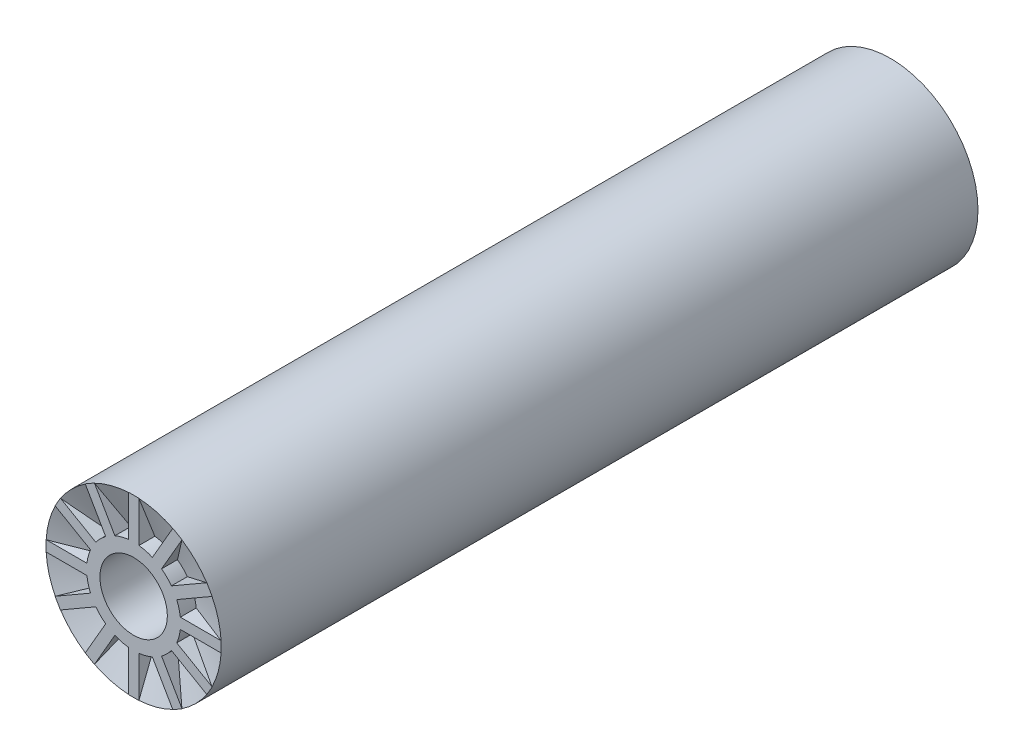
ISO-10303-21;
HEADER;
FILE_DESCRIPTION(('STEP AP214'),'2;1');
FILE_NAME('part.step','',(''),(''),'','','');
FILE_SCHEMA(('AUTOMOTIVE_DESIGN { 1 0 10303 214 1 1 1 1 }'));
ENDSEC;
DATA;
#1=APPLICATION_CONTEXT('core data for automotive mechanical design processes');
#2=APPLICATION_PROTOCOL_DEFINITION('international standard','automotive_design',2000,#1);
#3=PRODUCT_CONTEXT('',#1,'mechanical');
#4=PRODUCT('Part','Part','',(#3));
#5=PRODUCT_RELATED_PRODUCT_CATEGORY('part','',(#4));
#6=PRODUCT_DEFINITION_FORMATION('','',#4);
#7=PRODUCT_DEFINITION_CONTEXT('part definition',#1,'design');
#8=PRODUCT_DEFINITION('design','',#6,#7);
#9=PRODUCT_DEFINITION_SHAPE('','',#8);
#10=(LENGTH_UNIT() NAMED_UNIT(*) SI_UNIT(.MILLI.,.METRE.));
#11=(NAMED_UNIT(*) PLANE_ANGLE_UNIT() SI_UNIT($,.RADIAN.));
#12=(NAMED_UNIT(*) SI_UNIT($,.STERADIAN.) SOLID_ANGLE_UNIT());
#13=UNCERTAINTY_MEASURE_WITH_UNIT(LENGTH_MEASURE(1.E-05),#10,'distance_accuracy_value','');
#14=(GEOMETRIC_REPRESENTATION_CONTEXT(3) GLOBAL_UNCERTAINTY_ASSIGNED_CONTEXT((#13)) GLOBAL_UNIT_ASSIGNED_CONTEXT((#10,
#11,#12)) REPRESENTATION_CONTEXT('',''));
#15=CARTESIAN_POINT('',(0.,0.,0.));
#16=DIRECTION('',(0.,0.,1.));
#17=DIRECTION('',(1.,0.,0.));
#18=AXIS2_PLACEMENT_3D('',#15,#16,#17);
#19=CARTESIAN_POINT('',(0.,0.,9.99999999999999));
#20=DIRECTION('',(0.,0.,1.));
#21=DIRECTION('',(1.,0.,0.));
#22=AXIS2_PLACEMENT_3D('',#19,#20,#21);
#23=CYLINDRICAL_SURFACE('',#22,16.5);
#24=CARTESIAN_POINT('',(0.,0.,-132.5));
#25=DIRECTION('',(0.,0.,1.));
#26=DIRECTION('',(1.,0.,0.));
#27=AXIS2_PLACEMENT_3D('',#24,#25,#26);
#28=CIRCLE('',#27,16.5);
#29=CARTESIAN_POINT('',(16.5,0.,-132.5));
#30=VERTEX_POINT('',#29);
#31=EDGE_CURVE('E893',#30,#30,#28,.T.);
#32=ORIENTED_EDGE('',*,*,#31,.T.);
#33=EDGE_LOOP('',(#32));
#34=FACE_BOUND('',#33,.T.);
#35=CARTESIAN_POINT('',(0.,0.,10.));
#36=DIRECTION('',(0.,0.,1.));
#37=DIRECTION('',(1.,0.,0.));
#38=AXIS2_PLACEMENT_3D('',#35,#36,#37);
#39=CIRCLE('',#38,16.5);
#40=CARTESIAN_POINT('',(14.763151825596,-7.36880914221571,10.));
#41=VERTEX_POINT('',#40);
#42=CARTESIAN_POINT('',(16.4696690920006,-1.,10.));
#43=VERTEX_POINT('',#42);
#44=EDGE_CURVE('E895',#41,#43,#39,.T.);
#45=ORIENTED_EDGE('',*,*,#44,.F.);
#46=DIRECTION('',(0.,0.,1.));
#47=VECTOR('',#46,1.);
#48=CARTESIAN_POINT('',(14.763151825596,-7.36880914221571,9.99999999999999));
#49=LINE('',#48,#47);
#50=CARTESIAN_POINT('',(14.763151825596,-7.36880914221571,9.98510846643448));
#51=VERTEX_POINT('',#50);
#52=EDGE_CURVE('E56',#41,#51,#49,.F.);
#53=ORIENTED_EDGE('',*,*,#52,.T.);
#54=CARTESIAN_POINT('',(0.,0.,1.89901259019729));
#55=DIRECTION('',(-0.38167166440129,0.220358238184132,0.897646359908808));
#56=DIRECTION('',(0.777384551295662,-0.448823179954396,0.440716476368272));
#57=AXIS2_PLACEMENT_3D('',#54,#55,#56);
#58=ELLIPSE('',#57,18.3814035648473,16.5);
#59=CARTESIAN_POINT('',(14.2894191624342,-8.25000000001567,10.));
#60=VERTEX_POINT('',#59);
#61=EDGE_CURVE('E470',#60,#51,#58,.T.);
#62=ORIENTED_EDGE('',*,*,#61,.F.);
#63=CARTESIAN_POINT('',(13.763151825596,-9.1008599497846,9.98510846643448));
#64=VERTEX_POINT('',#63);
#65=EDGE_CURVE('E62',#64,#60,#58,.T.);
#66=ORIENTED_EDGE('',*,*,#65,.F.);
#67=DIRECTION('',(0.,0.,1.));
#68=VECTOR('',#67,1.);
#69=CARTESIAN_POINT('',(13.763151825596,-9.1008599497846,9.99999999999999));
#70=LINE('',#69,#68);
#71=CARTESIAN_POINT('',(13.763151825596,-9.1008599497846,10.));
#72=VERTEX_POINT('',#71);
#73=EDGE_CURVE('E487',#72,#64,#70,.F.);
#74=ORIENTED_EDGE('',*,*,#73,.F.);
#75=CARTESIAN_POINT('',(9.10085994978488,-13.7631518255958,10.));
#76=VERTEX_POINT('',#75);
#77=EDGE_CURVE('E900',#76,#72,#39,.T.);
#78=ORIENTED_EDGE('',*,*,#77,.F.);
#79=DIRECTION('',(0.,0.,1.));
#80=VECTOR('',#79,1.);
#81=CARTESIAN_POINT('',(9.10085994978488,-13.7631518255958,9.99999999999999));
#82=LINE('',#81,#80);
#83=CARTESIAN_POINT('',(9.10085994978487,-13.7631518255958,9.98510846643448));
#84=VERTEX_POINT('',#83);
#85=EDGE_CURVE('E519',#76,#84,#82,.F.);
#86=ORIENTED_EDGE('',*,*,#85,.T.);
#87=CARTESIAN_POINT('',(0.,0.,1.89901259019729));
#88=DIRECTION('',(-0.22035823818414,0.381671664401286,0.897646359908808));
#89=DIRECTION('',(0.448823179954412,-0.777384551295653,0.440716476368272));
#90=AXIS2_PLACEMENT_3D('',#87,#88,#89);
#91=ELLIPSE('',#90,18.3814035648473,16.5);
#92=CARTESIAN_POINT('',(8.25000000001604,-14.289419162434,10.));
#93=VERTEX_POINT('',#92);
#94=EDGE_CURVE('E524',#93,#84,#91,.T.);
#95=ORIENTED_EDGE('',*,*,#94,.F.);
#96=CARTESIAN_POINT('',(7.36880914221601,-14.7631518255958,9.98510846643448));
#97=VERTEX_POINT('',#96);
#98=EDGE_CURVE('E521',#97,#93,#91,.T.);
#99=ORIENTED_EDGE('',*,*,#98,.F.);
#100=DIRECTION('',(0.,0.,1.));
#101=VECTOR('',#100,1.);
#102=CARTESIAN_POINT('',(7.36880914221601,-14.7631518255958,9.99999999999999));
#103=LINE('',#102,#101);
#104=CARTESIAN_POINT('',(7.36880914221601,-14.7631518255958,10.));
#105=VERTEX_POINT('',#104);
#106=EDGE_CURVE('E514',#105,#97,#103,.F.);
#107=ORIENTED_EDGE('',*,*,#106,.F.);
#108=CARTESIAN_POINT('',(1.00000000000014,-16.4696690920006,10.));
#109=VERTEX_POINT('',#108);
#110=EDGE_CURVE('E903',#109,#105,#39,.T.);
#111=ORIENTED_EDGE('',*,*,#110,.F.);
#112=DIRECTION('',(0.,0.,1.));
#113=VECTOR('',#112,1.);
#114=CARTESIAN_POINT('',(1.00000000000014,-16.4696690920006,9.99999999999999));
#115=LINE('',#114,#113);
#116=CARTESIAN_POINT('',(1.00000000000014,-16.4696690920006,9.98510846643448));
#117=VERTEX_POINT('',#116);
#118=EDGE_CURVE('E551',#109,#117,#115,.F.);
#119=ORIENTED_EDGE('',*,*,#118,.T.);
#120=CARTESIAN_POINT('',(0.,0.,1.89901259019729));
#121=DIRECTION('',(0.,0.440716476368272,0.897646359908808));
#122=DIRECTION('',(0.,-0.897646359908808,0.440716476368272));
#123=AXIS2_PLACEMENT_3D('',#120,#121,#122);
#124=ELLIPSE('',#123,18.3814035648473,16.5);
#125=CARTESIAN_POINT('',(-2.68291036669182E-11,-16.5,10.));
#126=VERTEX_POINT('',#125);
#127=EDGE_CURVE('E556',#126,#117,#124,.T.);
#128=ORIENTED_EDGE('',*,*,#127,.F.);
#129=CARTESIAN_POINT('',(-0.999999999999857,-16.4696690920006,9.98510846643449));
#130=VERTEX_POINT('',#129);
#131=EDGE_CURVE('E553',#130,#126,#124,.T.);
#132=ORIENTED_EDGE('',*,*,#131,.F.);
#133=DIRECTION('',(0.,0.,1.));
#134=VECTOR('',#133,1.);
#135=CARTESIAN_POINT('',(-0.999999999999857,-16.4696690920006,9.99999999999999));
#136=LINE('',#135,#134);
#137=CARTESIAN_POINT('',(-0.999999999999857,-16.4696690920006,10.));
#138=VERTEX_POINT('',#137);
#139=EDGE_CURVE('E546',#138,#130,#136,.F.);
#140=ORIENTED_EDGE('',*,*,#139,.F.);
#141=CARTESIAN_POINT('',(-7.36880914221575,-14.763151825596,10.));
#142=VERTEX_POINT('',#141);
#143=EDGE_CURVE('E938',#142,#138,#39,.T.);
#144=ORIENTED_EDGE('',*,*,#143,.F.);
#145=DIRECTION('',(0.,0.,1.));
#146=VECTOR('',#145,1.);
#147=CARTESIAN_POINT('',(-7.36880914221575,-14.763151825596,9.99999999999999));
#148=LINE('',#147,#146);
#149=CARTESIAN_POINT('',(-7.36880914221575,-14.763151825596,9.98510846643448));
#150=VERTEX_POINT('',#149);
#151=EDGE_CURVE('E583',#142,#150,#148,.F.);
#152=ORIENTED_EDGE('',*,*,#151,.T.);
#153=CARTESIAN_POINT('',(0.,0.,1.89901259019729));
#154=DIRECTION('',(0.220358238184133,0.38167166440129,0.897646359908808));
#155=DIRECTION('',(-0.448823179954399,-0.777384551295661,0.440716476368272));
#156=AXIS2_PLACEMENT_3D('',#153,#154,#155);
#157=ELLIPSE('',#156,18.3814035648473,16.5);
#158=CARTESIAN_POINT('',(-8.24999999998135,-14.289419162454,10.));
#159=VERTEX_POINT('',#158);
#160=EDGE_CURVE('E588',#159,#150,#157,.T.);
#161=ORIENTED_EDGE('',*,*,#160,.F.);
#162=CARTESIAN_POINT('',(-9.10085994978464,-13.763151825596,9.98510846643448));
#163=VERTEX_POINT('',#162);
#164=EDGE_CURVE('E585',#163,#159,#157,.T.);
#165=ORIENTED_EDGE('',*,*,#164,.F.);
#166=DIRECTION('',(0.,0.,1.));
#167=VECTOR('',#166,1.);
#168=CARTESIAN_POINT('',(-9.10085994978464,-13.763151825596,9.99999999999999));
#169=LINE('',#168,#167);
#170=CARTESIAN_POINT('',(-9.10085994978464,-13.763151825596,10.));
#171=VERTEX_POINT('',#170);
#172=EDGE_CURVE('E578',#171,#163,#169,.F.);
#173=ORIENTED_EDGE('',*,*,#172,.F.);
#174=CARTESIAN_POINT('',(-13.7631518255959,-9.10085994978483,10.));
#175=VERTEX_POINT('',#174);
#176=EDGE_CURVE('E934',#175,#171,#39,.T.);
#177=ORIENTED_EDGE('',*,*,#176,.F.);
#178=DIRECTION('',(0.,0.,1.));
#179=VECTOR('',#178,1.);
#180=CARTESIAN_POINT('',(-13.7631518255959,-9.10085994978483,9.99999999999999));
#181=LINE('',#180,#179);
#182=CARTESIAN_POINT('',(-13.7631518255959,-9.10085994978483,9.98510846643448));
#183=VERTEX_POINT('',#182);
#184=EDGE_CURVE('E615',#175,#183,#181,.F.);
#185=ORIENTED_EDGE('',*,*,#184,.T.);
#186=CARTESIAN_POINT('',(0.,0.,1.89901259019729));
#187=DIRECTION('',(0.381671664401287,0.220358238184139,0.897646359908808));
#188=DIRECTION('',(-0.777384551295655,-0.448823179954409,0.440716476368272));
#189=AXIS2_PLACEMENT_3D('',#186,#187,#188);
#190=ELLIPSE('',#189,18.3814035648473,16.5);
#191=CARTESIAN_POINT('',(-14.2894191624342,-8.25000000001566,10.));
#192=VERTEX_POINT('',#191);
#193=EDGE_CURVE('E620',#192,#183,#190,.T.);
#194=ORIENTED_EDGE('',*,*,#193,.F.);
#195=CARTESIAN_POINT('',(-14.7631518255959,-7.36880914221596,9.98510846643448));
#196=VERTEX_POINT('',#195);
#197=EDGE_CURVE('E617',#196,#192,#190,.T.);
#198=ORIENTED_EDGE('',*,*,#197,.F.);
#199=DIRECTION('',(0.,0.,1.));
#200=VECTOR('',#199,1.);
#201=CARTESIAN_POINT('',(-14.7631518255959,-7.36880914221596,9.99999999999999));
#202=LINE('',#201,#200);
#203=CARTESIAN_POINT('',(-14.7631518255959,-7.36880914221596,10.));
#204=VERTEX_POINT('',#203);
#205=EDGE_CURVE('E610',#204,#196,#202,.F.);
#206=ORIENTED_EDGE('',*,*,#205,.F.);
#207=CARTESIAN_POINT('',(-16.4696690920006,-1.00000000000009,10.));
#208=VERTEX_POINT('',#207);
#209=EDGE_CURVE('E930',#208,#204,#39,.T.);
#210=ORIENTED_EDGE('',*,*,#209,.F.);
#211=DIRECTION('',(0.,0.,1.));
#212=VECTOR('',#211,1.);
#213=CARTESIAN_POINT('',(-16.4696690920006,-1.00000000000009,9.99999999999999));
#214=LINE('',#213,#212);
#215=CARTESIAN_POINT('',(-16.4696690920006,-1.00000000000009,9.98510846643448));
#216=VERTEX_POINT('',#215);
#217=EDGE_CURVE('E647',#208,#216,#214,.F.);
#218=ORIENTED_EDGE('',*,*,#217,.T.);
#219=CARTESIAN_POINT('',(0.,0.,1.89901259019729));
#220=DIRECTION('',(0.440716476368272,0.,0.897646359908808));
#221=DIRECTION('',(-0.897646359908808,0.,0.440716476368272));
#222=AXIS2_PLACEMENT_3D('',#219,#220,#221);
#223=ELLIPSE('',#222,18.3814035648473,16.5);
#224=CARTESIAN_POINT('',(-16.5,2.05278028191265E-11,10.));
#225=VERTEX_POINT('',#224);
#226=EDGE_CURVE('E652',#225,#216,#223,.T.);
#227=ORIENTED_EDGE('',*,*,#226,.F.);
#228=CARTESIAN_POINT('',(-16.4696690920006,0.999999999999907,9.98510846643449));
#229=VERTEX_POINT('',#228);
#230=EDGE_CURVE('E649',#229,#225,#223,.T.);
#231=ORIENTED_EDGE('',*,*,#230,.F.);
#232=DIRECTION('',(0.,0.,1.));
#233=VECTOR('',#232,1.);
#234=CARTESIAN_POINT('',(-16.4696690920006,0.999999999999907,9.99999999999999));
#235=LINE('',#234,#233);
#236=CARTESIAN_POINT('',(-16.4696690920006,0.999999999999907,10.));
#237=VERTEX_POINT('',#236);
#238=EDGE_CURVE('E642',#237,#229,#235,.F.);
#239=ORIENTED_EDGE('',*,*,#238,.F.);
#240=CARTESIAN_POINT('',(-14.7631518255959,7.36880914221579,10.));
#241=VERTEX_POINT('',#240);
#242=EDGE_CURVE('E926',#241,#237,#39,.T.);
#243=ORIENTED_EDGE('',*,*,#242,.F.);
#244=DIRECTION('',(0.,0.,1.));
#245=VECTOR('',#244,1.);
#246=CARTESIAN_POINT('',(-14.7631518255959,7.36880914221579,9.99999999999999));
#247=LINE('',#246,#245);
#248=CARTESIAN_POINT('',(-14.7631518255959,7.36880914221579,9.98510846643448));
#249=VERTEX_POINT('',#248);
#250=EDGE_CURVE('E679',#241,#249,#247,.F.);
#251=ORIENTED_EDGE('',*,*,#250,.T.);
#252=CARTESIAN_POINT('',(0.,0.,1.89901259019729));
#253=DIRECTION('',(0.381671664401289,-0.220358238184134,0.897646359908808));
#254=DIRECTION('',(-0.77738455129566,0.448823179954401,0.440716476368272));
#255=AXIS2_PLACEMENT_3D('',#252,#253,#254);
#256=ELLIPSE('',#255,18.3814035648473,16.5);
#257=CARTESIAN_POINT('',(-14.289419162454,8.24999999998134,10.));
#258=VERTEX_POINT('',#257);
#259=EDGE_CURVE('E684',#258,#249,#256,.T.);
#260=ORIENTED_EDGE('',*,*,#259,.F.);
#261=CARTESIAN_POINT('',(-13.763151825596,9.10085994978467,9.98510846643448));
#262=VERTEX_POINT('',#261);
#263=EDGE_CURVE('E681',#262,#258,#256,.T.);
#264=ORIENTED_EDGE('',*,*,#263,.F.);
#265=DIRECTION('',(0.,0.,1.));
#266=VECTOR('',#265,1.);
#267=CARTESIAN_POINT('',(-13.763151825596,9.10085994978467,9.99999999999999));
#268=LINE('',#267,#266);
#269=CARTESIAN_POINT('',(-13.763151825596,9.10085994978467,10.));
#270=VERTEX_POINT('',#269);
#271=EDGE_CURVE('E674',#270,#262,#268,.F.);
#272=ORIENTED_EDGE('',*,*,#271,.F.);
#273=CARTESIAN_POINT('',(-9.10085994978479,13.7631518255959,10.));
#274=VERTEX_POINT('',#273);
#275=EDGE_CURVE('E922',#274,#270,#39,.T.);
#276=ORIENTED_EDGE('',*,*,#275,.F.);
#277=DIRECTION('',(0.,0.,1.));
#278=VECTOR('',#277,1.);
#279=CARTESIAN_POINT('',(-9.10085994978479,13.7631518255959,9.99999999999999));
#280=LINE('',#279,#278);
#281=CARTESIAN_POINT('',(-9.10085994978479,13.7631518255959,9.98510846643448));
#282=VERTEX_POINT('',#281);
#283=EDGE_CURVE('E711',#274,#282,#280,.F.);
#284=ORIENTED_EDGE('',*,*,#283,.T.);
#285=CARTESIAN_POINT('',(0.,0.,1.89901259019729));
#286=DIRECTION('',(0.220358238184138,-0.381671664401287,0.897646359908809));
#287=DIRECTION('',(-0.448823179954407,0.777384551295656,0.440716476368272));
#288=AXIS2_PLACEMENT_3D('',#285,#286,#287);
#289=ELLIPSE('',#288,18.3814035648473,16.5);
#290=CARTESIAN_POINT('',(-8.25000000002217,14.2894191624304,10.));
#291=VERTEX_POINT('',#290);
#292=EDGE_CURVE('E716',#291,#282,#289,.T.);
#293=ORIENTED_EDGE('',*,*,#292,.F.);
#294=CARTESIAN_POINT('',(-7.36880914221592,14.7631518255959,9.98510846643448));
#295=VERTEX_POINT('',#294);
#296=EDGE_CURVE('E713',#295,#291,#289,.T.);
#297=ORIENTED_EDGE('',*,*,#296,.F.);
#298=DIRECTION('',(0.,0.,1.));
#299=VECTOR('',#298,1.);
#300=CARTESIAN_POINT('',(-7.36880914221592,14.7631518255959,9.99999999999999));
#301=LINE('',#300,#299);
#302=CARTESIAN_POINT('',(-7.36880914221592,14.7631518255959,10.));
#303=VERTEX_POINT('',#302);
#304=EDGE_CURVE('E706',#303,#295,#301,.F.);
#305=ORIENTED_EDGE('',*,*,#304,.F.);
#306=CARTESIAN_POINT('',(-1.00000000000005,16.4696690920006,10.));
#307=VERTEX_POINT('',#306);
#308=EDGE_CURVE('E918',#307,#303,#39,.T.);
#309=ORIENTED_EDGE('',*,*,#308,.F.);
#310=DIRECTION('',(0.,0.,1.));
#311=VECTOR('',#310,1.);
#312=CARTESIAN_POINT('',(-1.00000000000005,16.4696690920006,9.99999999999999));
#313=LINE('',#312,#311);
#314=CARTESIAN_POINT('',(-1.00000000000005,16.4696690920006,9.98510846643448));
#315=VERTEX_POINT('',#314);
#316=EDGE_CURVE('E743',#307,#315,#313,.F.);
#317=ORIENTED_EDGE('',*,*,#316,.T.);
#318=CARTESIAN_POINT('',(0.,0.,1.89901259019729));
#319=DIRECTION('',(0.,-0.440716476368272,0.897646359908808));
#320=DIRECTION('',(0.,0.897646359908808,0.440716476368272));
#321=AXIS2_PLACEMENT_3D('',#318,#319,#320);
#322=ELLIPSE('',#321,18.3814035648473,16.5);
#323=CARTESIAN_POINT('',(-2.39662250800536E-11,16.5,10.));
#324=VERTEX_POINT('',#323);
#325=EDGE_CURVE('E748',#324,#315,#322,.T.);
#326=ORIENTED_EDGE('',*,*,#325,.F.);
#327=CARTESIAN_POINT('',(0.999999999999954,16.4696690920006,9.98510846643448));
#328=VERTEX_POINT('',#327);
#329=EDGE_CURVE('E745',#328,#324,#322,.T.);
#330=ORIENTED_EDGE('',*,*,#329,.F.);
#331=DIRECTION('',(0.,0.,1.));
#332=VECTOR('',#331,1.);
#333=CARTESIAN_POINT('',(0.999999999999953,16.4696690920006,9.99999999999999));
#334=LINE('',#333,#332);
#335=CARTESIAN_POINT('',(0.999999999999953,16.4696690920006,10.));
#336=VERTEX_POINT('',#335);
#337=EDGE_CURVE('E738',#336,#328,#334,.F.);
#338=ORIENTED_EDGE('',*,*,#337,.F.);
#339=CARTESIAN_POINT('',(7.36880914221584,14.7631518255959,10.));
#340=VERTEX_POINT('',#339);
#341=EDGE_CURVE('E914',#340,#336,#39,.T.);
#342=ORIENTED_EDGE('',*,*,#341,.F.);
#343=DIRECTION('',(0.,0.,1.));
#344=VECTOR('',#343,1.);
#345=CARTESIAN_POINT('',(7.36880914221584,14.7631518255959,9.99999999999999));
#346=LINE('',#345,#344);
#347=CARTESIAN_POINT('',(7.36880914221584,14.7631518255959,9.98510846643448));
#348=VERTEX_POINT('',#347);
#349=EDGE_CURVE('E775',#340,#348,#346,.F.);
#350=ORIENTED_EDGE('',*,*,#349,.T.);
#351=CARTESIAN_POINT('',(0.,0.,1.89901259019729));
#352=DIRECTION('',(-0.220358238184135,-0.381671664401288,0.897646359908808));
#353=DIRECTION('',(0.448823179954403,0.777384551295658,0.440716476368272));
#354=AXIS2_PLACEMENT_3D('',#351,#352,#353);
#355=ELLIPSE('',#354,18.3814035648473,16.5);
#356=CARTESIAN_POINT('',(8.25000000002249,14.2894191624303,10.));
#357=VERTEX_POINT('',#356);
#358=EDGE_CURVE('E780',#357,#348,#355,.T.);
#359=ORIENTED_EDGE('',*,*,#358,.F.);
#360=CARTESIAN_POINT('',(9.10085994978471,13.7631518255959,9.98510846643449));
#361=VERTEX_POINT('',#360);
#362=EDGE_CURVE('E777',#361,#357,#355,.T.);
#363=ORIENTED_EDGE('',*,*,#362,.F.);
#364=DIRECTION('',(0.,0.,1.));
#365=VECTOR('',#364,1.);
#366=CARTESIAN_POINT('',(9.10085994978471,13.7631518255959,9.99999999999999));
#367=LINE('',#366,#365);
#368=CARTESIAN_POINT('',(9.10085994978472,13.7631518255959,10.));
#369=VERTEX_POINT('',#368);
#370=EDGE_CURVE('E770',#369,#361,#367,.F.);
#371=ORIENTED_EDGE('',*,*,#370,.F.);
#372=CARTESIAN_POINT('',(13.7631518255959,9.10085994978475,10.));
#373=VERTEX_POINT('',#372);
#374=EDGE_CURVE('E908',#373,#369,#39,.T.);
#375=ORIENTED_EDGE('',*,*,#374,.F.);
#376=DIRECTION('',(0.,0.,1.));
#377=VECTOR('',#376,1.);
#378=CARTESIAN_POINT('',(13.7631518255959,9.10085994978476,9.99999999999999));
#379=LINE('',#378,#377);
#380=CARTESIAN_POINT('',(13.7631518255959,9.10085994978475,9.98510846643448));
#381=VERTEX_POINT('',#380);
#382=EDGE_CURVE('E807',#373,#381,#379,.F.);
#383=ORIENTED_EDGE('',*,*,#382,.T.);
#384=CARTESIAN_POINT('',(0.,0.,1.89901259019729));
#385=DIRECTION('',(-0.381671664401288,-0.220358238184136,0.897646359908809));
#386=DIRECTION('',(0.777384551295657,0.448823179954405,0.440716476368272));
#387=AXIS2_PLACEMENT_3D('',#384,#385,#386);
#388=ELLIPSE('',#387,18.3814035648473,16.5);
#389=CARTESIAN_POINT('',(14.2894191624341,8.25000000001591,10.));
#390=VERTEX_POINT('',#389);
#391=EDGE_CURVE('E812',#390,#381,#388,.T.);
#392=ORIENTED_EDGE('',*,*,#391,.F.);
#393=CARTESIAN_POINT('',(14.7631518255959,7.36880914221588,9.98510846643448));
#394=VERTEX_POINT('',#393);
#395=EDGE_CURVE('E809',#394,#390,#388,.T.);
#396=ORIENTED_EDGE('',*,*,#395,.F.);
#397=DIRECTION('',(0.,0.,1.));
#398=VECTOR('',#397,1.);
#399=CARTESIAN_POINT('',(14.7631518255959,7.36880914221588,9.99999999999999));
#400=LINE('',#399,#398);
#401=CARTESIAN_POINT('',(14.7631518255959,7.36880914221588,10.));
#402=VERTEX_POINT('',#401);
#403=EDGE_CURVE('E802',#402,#394,#400,.F.);
#404=ORIENTED_EDGE('',*,*,#403,.F.);
#405=CARTESIAN_POINT('',(16.4696690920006,1.,10.));
#406=VERTEX_POINT('',#405);
#407=EDGE_CURVE('E902',#406,#402,#39,.T.);
#408=ORIENTED_EDGE('',*,*,#407,.F.);
#409=DIRECTION('',(0.,0.,1.));
#410=VECTOR('',#409,1.);
#411=CARTESIAN_POINT('',(16.4696690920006,1.,9.99999999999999));
#412=LINE('',#411,#410);
#413=CARTESIAN_POINT('',(16.4696690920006,1.,9.98510846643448));
#414=VERTEX_POINT('',#413);
#415=EDGE_CURVE('E1016',#406,#414,#412,.F.);
#416=ORIENTED_EDGE('',*,*,#415,.T.);
#417=CARTESIAN_POINT('',(0.,0.,1.89901259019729));
#418=DIRECTION('',(-0.440716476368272,0.,0.897646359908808));
#419=DIRECTION('',(0.897646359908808,0.,0.440716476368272));
#420=AXIS2_PLACEMENT_3D('',#417,#418,#419);
#421=ELLIPSE('',#420,18.3814035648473,16.5);
#422=CARTESIAN_POINT('',(16.5,0.,10.));
#423=VERTEX_POINT('',#422);
#424=EDGE_CURVE('E1015',#423,#414,#421,.T.);
#425=ORIENTED_EDGE('',*,*,#424,.F.);
#426=CARTESIAN_POINT('',(16.4696690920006,-1.,9.98510846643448));
#427=VERTEX_POINT('',#426);
#428=EDGE_CURVE('E1012',#427,#423,#421,.T.);
#429=ORIENTED_EDGE('',*,*,#428,.F.);
#430=DIRECTION('',(0.,0.,1.));
#431=VECTOR('',#430,1.);
#432=CARTESIAN_POINT('',(16.4696690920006,-1.,9.99999999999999));
#433=LINE('',#432,#431);
#434=EDGE_CURVE('E897',#43,#427,#433,.F.);
#435=ORIENTED_EDGE('',*,*,#434,.F.);
#436=EDGE_LOOP('',(#45,#53,#62,#66,#74,#78,#86,#95,#99,#107,#111,#119,#128,#132,#140,#144,#152,
#161,#165,#173,#177,#185,#194,#198,#206,#210,#218,#227,#231,#239,#243,#251,#260,#264,#272,#276,
#284,#293,#297,#305,#309,#317,#326,#330,#338,#342,#350,#359,#363,#371,#375,#383,#392,#396,#404,
#408,#416,#425,#429,#435));
#437=FACE_BOUND('',#436,.T.);
#438=ADVANCED_FACE('F35',(#34,#437),#23,.T.);
#439=CARTESIAN_POINT('',(0.,0.,9.99999999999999));
#440=DIRECTION('',(0.,0.,1.));
#441=DIRECTION('',(1.,0.,0.));
#442=AXIS2_PLACEMENT_3D('',#439,#440,#441);
#443=CYLINDRICAL_SURFACE('',#442,8.85);
#444=DIRECTION('',(0.,0.,1.));
#445=VECTOR('',#444,1.);
#446=CARTESIAN_POINT('',(7.11523965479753,-5.2626860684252,9.99999999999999));
#447=LINE('',#446,#445);
#448=CARTESIAN_POINT('',(7.11523965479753,-5.2626860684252,10.));
#449=VERTEX_POINT('',#448);
#450=CARTESIAN_POINT('',(7.11523965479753,-5.2626860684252,7.));
#451=VERTEX_POINT('',#450);
#452=EDGE_CURVE('E465',#449,#451,#447,.F.);
#453=ORIENTED_EDGE('',*,*,#452,.F.);
#454=CARTESIAN_POINT('',(0.,0.,10.));
#455=DIRECTION('',(0.,0.,1.));
#456=DIRECTION('',(1.,0.,0.));
#457=AXIS2_PLACEMENT_3D('',#454,#455,#456);
#458=CIRCLE('',#457,8.85);
#459=CARTESIAN_POINT('',(5.26268606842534,-7.11523965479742,10.));
#460=VERTEX_POINT('',#459);
#461=EDGE_CURVE('E984',#460,#449,#458,.T.);
#462=ORIENTED_EDGE('',*,*,#461,.F.);
#463=DIRECTION('',(0.,0.,1.));
#464=VECTOR('',#463,1.);
#465=CARTESIAN_POINT('',(5.26268606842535,-7.11523965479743,9.99999999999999));
#466=LINE('',#465,#464);
#467=CARTESIAN_POINT('',(5.26268606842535,-7.11523965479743,7.));
#468=VERTEX_POINT('',#467);
#469=EDGE_CURVE('E517',#460,#468,#466,.F.);
#470=ORIENTED_EDGE('',*,*,#469,.T.);
#471=CARTESIAN_POINT('',(0.,0.,7.));
#472=DIRECTION('',(0.,0.,1.));
#473=DIRECTION('',(1.,0.,0.));
#474=AXIS2_PLACEMENT_3D('',#471,#472,#473);
#475=CIRCLE('',#474,8.85);
#476=EDGE_CURVE('E912',#468,#451,#475,.T.);
#477=ORIENTED_EDGE('',*,*,#476,.T.);
#478=EDGE_LOOP('',(#453,#462,#470,#477));
#479=FACE_BOUND('',#478,.T.);
#480=ADVANCED_FACE('F882',(#479),#443,.T.);
#481=CARTESIAN_POINT('',(0.,0.,10.));
#482=DIRECTION('',(0.,0.,1.));
#483=DIRECTION('',(1.,0.,0.));
#484=AXIS2_PLACEMENT_3D('',#481,#482,#483);
#485=CONICAL_SURFACE('',#484,16.5,1.19706950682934);
#486=CARTESIAN_POINT('',(7.1147951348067,-5.26242942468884,6.9998));
#487=CARTESIAN_POINT('',(7.66907252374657,-5.58244162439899,7.24921019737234));
#488=CARTESIAN_POINT('',(8.22326565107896,-5.90240517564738,7.49886978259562));
#489=CARTESIAN_POINT('',(9.33153467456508,-6.54226459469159,7.99853543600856));
#490=CARTESIAN_POINT('',(9.88561057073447,-6.86216046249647,8.24854150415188));
#491=CARTESIAN_POINT('',(10.993696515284,-7.50191418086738,8.74874787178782));
#492=CARTESIAN_POINT('',(11.5477065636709,-7.82177203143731,8.9989481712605));
#493=CARTESIAN_POINT('',(12.6556803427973,-8.46146099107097,9.49948571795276));
#494=CARTESIAN_POINT('',(13.2096440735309,-8.78129210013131,9.74982296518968));
#495=CARTESIAN_POINT('',(13.7635943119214,-9.1011154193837,10.0002));
#496=B_SPLINE_CURVE_WITH_KNOTS('',3,(#486,#487,#488,#489,#490,#491,#492,#493,#494,#495),
.UNSPECIFIED.,.F.,.F.,(4,2,2,2,4),(0.,2.06071086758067,4.12142145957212,6.18213184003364,
8.24284248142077),.UNSPECIFIED.);
#497=EDGE_CURVE('E49',#451,#72,#496,.T.);
#498=ORIENTED_EDGE('',*,*,#497,.F.);
#499=ORIENTED_EDGE('',*,*,#476,.F.);
#500=CARTESIAN_POINT('',(5.26242942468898,-7.1147951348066,6.9998));
#501=CARTESIAN_POINT('',(5.58244162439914,-7.66907252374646,7.24921019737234));
#502=CARTESIAN_POINT('',(5.90240517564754,-8.22326565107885,7.49886978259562));
#503=CARTESIAN_POINT('',(6.54226459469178,-9.33153467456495,7.99853543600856));
#504=CARTESIAN_POINT('',(6.86216046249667,-9.88561057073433,8.24854150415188));
#505=CARTESIAN_POINT('',(7.50191418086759,-10.9936965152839,8.74874787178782));
#506=CARTESIAN_POINT('',(7.82177203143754,-11.5477065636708,8.99894817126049));
#507=CARTESIAN_POINT('',(8.46146099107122,-12.6556803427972,9.49948571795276));
#508=CARTESIAN_POINT('',(8.78129210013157,-13.2096440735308,9.74982296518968));
#509=CARTESIAN_POINT('',(9.10111541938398,-13.7635943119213,10.0002));
#510=B_SPLINE_CURVE_WITH_KNOTS('',3,(#500,#501,#502,#503,#504,#505,#506,#507,#508,#509),
.UNSPECIFIED.,.F.,.F.,(4,2,2,2,4),(0.,2.06071086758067,4.12142145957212,6.18213184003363,
8.24284248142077),.UNSPECIFIED.);
#511=EDGE_CURVE('E962',#468,#76,#510,.T.);
#512=ORIENTED_EDGE('',*,*,#511,.T.);
#513=ORIENTED_EDGE('',*,*,#77,.T.);
#514=EDGE_LOOP('',(#498,#499,#512,#513));
#515=FACE_BOUND('',#514,.T.);
#516=ADVANCED_FACE('F887',(#515),#485,.F.);
#517=DIRECTION('',(0.,0.,1.));
#518=VECTOR('',#517,1.);
#519=CARTESIAN_POINT('',(3.53063526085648,-8.11523965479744,9.99999999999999));
#520=LINE('',#519,#518);
#521=CARTESIAN_POINT('',(3.53063526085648,-8.11523965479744,10.));
#522=VERTEX_POINT('',#521);
#523=CARTESIAN_POINT('',(3.53063526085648,-8.11523965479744,7.));
#524=VERTEX_POINT('',#523);
#525=EDGE_CURVE('E511',#522,#524,#520,.F.);
#526=ORIENTED_EDGE('',*,*,#525,.F.);
#527=CARTESIAN_POINT('',(1.00000000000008,-8.79332132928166,10.));
#528=VERTEX_POINT('',#527);
#529=EDGE_CURVE('E968',#528,#522,#458,.T.);
#530=ORIENTED_EDGE('',*,*,#529,.F.);
#531=DIRECTION('',(0.,0.,1.));
#532=VECTOR('',#531,1.);
#533=CARTESIAN_POINT('',(1.00000000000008,-8.79332132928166,9.99999999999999));
#534=LINE('',#533,#532);
#535=CARTESIAN_POINT('',(1.00000000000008,-8.79332132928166,7.));
#536=VERTEX_POINT('',#535);
#537=EDGE_CURVE('E549',#528,#536,#534,.F.);
#538=ORIENTED_EDGE('',*,*,#537,.T.);
#539=EDGE_CURVE('E995',#536,#524,#475,.T.);
#540=ORIENTED_EDGE('',*,*,#539,.T.);
#541=EDGE_LOOP('',(#526,#530,#538,#540));
#542=FACE_BOUND('',#541,.T.);
#543=ADVANCED_FACE('F889',(#542),#443,.T.);
#544=CARTESIAN_POINT('',(3.53037861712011,-8.11479513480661,6.9998));
#545=CARTESIAN_POINT('',(3.85039081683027,-8.66907252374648,7.24921019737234));
#546=CARTESIAN_POINT('',(4.17035436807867,-9.22326565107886,7.49886978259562));
#547=CARTESIAN_POINT('',(4.81021378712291,-10.331534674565,7.99853543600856));
#548=CARTESIAN_POINT('',(5.1301096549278,-10.8856105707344,8.24854150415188));
#549=CARTESIAN_POINT('',(5.76986337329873,-11.9936965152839,8.74874787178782));
#550=CARTESIAN_POINT('',(6.08972122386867,-12.5477065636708,8.99894817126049));
#551=CARTESIAN_POINT('',(6.72941018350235,-13.6556803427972,9.49948571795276));
#552=CARTESIAN_POINT('',(7.0492412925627,-14.2096440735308,9.74982296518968));
#553=CARTESIAN_POINT('',(7.36906461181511,-14.7635943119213,10.0002));
#554=B_SPLINE_CURVE_WITH_KNOTS('',3,(#544,#545,#546,#547,#548,#549,#550,#551,#552,#553),
.UNSPECIFIED.,.F.,.F.,(4,2,2,2,4),(0.,2.06071086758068,4.12142145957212,6.18213184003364,
8.24284248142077),.UNSPECIFIED.);
#555=EDGE_CURVE('E951',#524,#105,#554,.T.);
#556=ORIENTED_EDGE('',*,*,#555,.F.);
#557=ORIENTED_EDGE('',*,*,#539,.F.);
#558=CARTESIAN_POINT('',(0.999999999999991,0.997909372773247,4.0834258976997));
#559=CARTESIAN_POINT('',(0.999999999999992,0.950940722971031,4.07042594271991));
#560=CARTESIAN_POINT('',(0.999999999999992,0.903853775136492,4.05783292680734));
#561=CARTESIAN_POINT('',(0.999999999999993,0.809378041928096,4.03372386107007));
#562=CARTESIAN_POINT('',(0.999999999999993,0.761989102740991,4.02220841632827));
#563=CARTESIAN_POINT('',(0.999999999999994,0.666613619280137,4.00046821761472));
#564=CARTESIAN_POINT('',(0.999999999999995,0.618625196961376,3.99025155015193));
#565=CARTESIAN_POINT('',(0.999999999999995,0.522325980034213,3.97153558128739));
#566=CARTESIAN_POINT('',(0.999999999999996,0.474015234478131,3.96303602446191));
#567=CARTESIAN_POINT('',(0.999999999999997,0.332411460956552,3.94131080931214));
#568=CARTESIAN_POINT('',(0.999999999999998,0.238631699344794,3.93093284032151));
#569=CARTESIAN_POINT('',(0.999999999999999,0.0977106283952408,3.92301156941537));
#570=CARTESIAN_POINT('',(1.,0.0507700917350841,3.92164155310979));
#571=CARTESIAN_POINT('',(1.,-0.0431144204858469,3.92150144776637));
#572=CARTESIAN_POINT('',(1.,-0.0900583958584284,3.92273126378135));
#573=CARTESIAN_POINT('',(1.,-0.217241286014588,3.92950595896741));
#574=CARTESIAN_POINT('',(1.,-0.297354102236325,3.93750231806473));
#575=CARTESIAN_POINT('',(1.,-0.456754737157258,3.95953575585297));
#576=CARTESIAN_POINT('',(1.,-0.536041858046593,3.97357757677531));
#577=CARTESIAN_POINT('',(1.00000000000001,-0.694126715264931,4.00604784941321));
#578=CARTESIAN_POINT('',(1.00000000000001,-0.77291958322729,4.02449930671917));
#579=CARTESIAN_POINT('',(1.00000000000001,-0.929718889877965,4.0643597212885));
#580=CARTESIAN_POINT('',(1.00000000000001,-1.00772550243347,4.08576800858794));
#581=CARTESIAN_POINT('',(1.00000000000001,-1.16491312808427,4.13110459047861));
#582=CARTESIAN_POINT('',(1.00000000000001,-1.24408068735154,4.15507900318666));
#583=CARTESIAN_POINT('',(1.00000000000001,-1.40196125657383,4.20447262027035));
#584=CARTESIAN_POINT('',(1.00000000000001,-1.48067426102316,4.2298918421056));
#585=CARTESIAN_POINT('',(1.00000000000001,-1.63753391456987,4.28167159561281));
#586=CARTESIAN_POINT('',(1.00000000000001,-1.71568154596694,4.30802916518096));
#587=CARTESIAN_POINT('',(1.00000000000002,-1.87172298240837,4.36147914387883));
#588=CARTESIAN_POINT('',(1.00000000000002,-1.94961679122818,4.38857154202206));
#589=CARTESIAN_POINT('',(1.00000000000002,-2.205877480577,4.4786885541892));
#590=CARTESIAN_POINT('',(1.00000000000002,-2.38384370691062,4.54285017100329));
#591=CARTESIAN_POINT('',(1.00000000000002,-2.73922412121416,4.67268722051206));
#592=CARTESIAN_POINT('',(1.00000000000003,-2.91663829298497,4.7383626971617));
#593=CARTESIAN_POINT('',(1.00000000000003,-3.27113340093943,4.87064212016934));
#594=CARTESIAN_POINT('',(1.00000000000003,-3.44821431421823,4.93724612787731));
#595=CARTESIAN_POINT('',(1.00000000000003,-3.80215084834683,5.07105053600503));
#596=CARTESIAN_POINT('',(1.00000000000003,-3.97900646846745,5.13825093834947));
#597=CARTESIAN_POINT('',(1.00000000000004,-4.50976077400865,5.34060631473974));
#598=CARTESIAN_POINT('',(1.00000000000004,-4.86343137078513,5.47635916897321));
#599=CARTESIAN_POINT('',(1.00000000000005,-5.57044443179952,5.748672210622));
#600=CARTESIAN_POINT('',(1.00000000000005,-5.92378690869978,5.88523236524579));
#601=CARTESIAN_POINT('',(1.00000000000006,-6.62464357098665,6.15665524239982));
#602=CARTESIAN_POINT('',(1.00000000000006,-6.97216074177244,6.2915102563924));
#603=CARTESIAN_POINT('',(1.00000000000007,-7.66708240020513,6.56152135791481));
#604=CARTESIAN_POINT('',(1.00000000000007,-8.01448688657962,6.69667744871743));
#605=CARTESIAN_POINT('',(1.00000000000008,-8.70908398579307,6.96714136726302));
#606=CARTESIAN_POINT('',(1.00000000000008,-9.05627662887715,7.10244911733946));
#607=CARTESIAN_POINT('',(1.00000000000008,-9.7506046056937,7.3732082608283));
#608=CARTESIAN_POINT('',(1.00000000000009,-10.0977399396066,7.50865965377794));
#609=CARTESIAN_POINT('',(1.0000000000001,-11.0653250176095,7.88637661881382));
#610=CARTESIAN_POINT('',(1.0000000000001,-11.6857300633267,8.12875668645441));
#611=CARTESIAN_POINT('',(1.00000000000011,-12.9264611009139,8.61372096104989));
#612=CARTESIAN_POINT('',(1.00000000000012,-13.5467870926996,8.85630516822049));
#613=CARTESIAN_POINT('',(1.00000000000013,-15.4078723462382,9.58432837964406));
#614=CARTESIAN_POINT('',(1.00000000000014,-16.6485540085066,10.0699657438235));
#615=CARTESIAN_POINT('',(1.00000000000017,-19.1588681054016,11.0528707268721));
#616=CARTESIAN_POINT('',(1.00000000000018,-20.4284981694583,11.550144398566));
#617=CARTESIAN_POINT('',(1.0000000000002,-22.9675000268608,12.5447814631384));
#618=CARTESIAN_POINT('',(1.00000000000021,-24.2368718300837,13.0421448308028));
#619=CARTESIAN_POINT('',(1.00000000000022,-25.5062312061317,13.5395398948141));
#620=B_SPLINE_CURVE_WITH_KNOTS('',3,(#558,#559,#560,#561,#562,#563,#564,#565,#566,#567,#568,
#569,#570,#571,#572,#573,#574,#575,#576,#577,#578,#579,#580,#581,#582,#583,#584,#585,#586,#587,
#588,#589,#590,#591,#592,#593,#594,#595,#596,#597,#598,#599,#600,#601,#602,#603,#604,#605,#606,
#607,#608,#609,#610,#611,#612,#613,#614,#615,#616,#617,#618,#619),.UNSPECIFIED.,.F.,.F.,(4,2,2,
2,2,2,2,2,2,2,2,2,2,2,2,2,2,2,2,2,2,2,2,2,2,2,2,2,2,2,4),(0.,0.146209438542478,
0.292500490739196,0.439661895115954,0.586801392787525,0.869331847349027,1.01014864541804,
1.1509603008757,1.39217287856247,1.6335750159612,1.8762651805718,2.11890044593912,
2.36703498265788,2.61517251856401,2.86258623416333,3.10999625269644,3.6775171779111,
4.24505460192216,4.81262970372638,5.38020663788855,6.51669235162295,7.65313221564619,
8.77142821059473,9.8897364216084,11.0076175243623,12.1254950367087,14.1237078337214,
16.1219227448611,20.1189480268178,24.2095683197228,28.2995653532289),.UNSPECIFIED.);
#621=EDGE_CURVE('E954',#536,#109,#620,.T.);
#622=ORIENTED_EDGE('',*,*,#621,.T.);
#623=ORIENTED_EDGE('',*,*,#110,.T.);
#624=EDGE_LOOP('',(#556,#557,#622,#623));
#625=FACE_BOUND('',#624,.T.);
#626=ADVANCED_FACE('F948',(#625),#485,.F.);
#627=DIRECTION('',(0.,0.,1.));
#628=VECTOR('',#627,1.);
#629=CARTESIAN_POINT('',(-0.999999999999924,-8.79332132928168,9.99999999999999));
#630=LINE('',#629,#628);
#631=CARTESIAN_POINT('',(-0.999999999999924,-8.79332132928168,10.));
#632=VERTEX_POINT('',#631);
#633=CARTESIAN_POINT('',(-0.999999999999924,-8.79332132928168,7.));
#634=VERTEX_POINT('',#633);
#635=EDGE_CURVE('E543',#632,#634,#630,.F.);
#636=ORIENTED_EDGE('',*,*,#635,.F.);
#637=CARTESIAN_POINT('',(-3.53063526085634,-8.1152396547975,10.));
#638=VERTEX_POINT('',#637);
#639=EDGE_CURVE('E1289',#638,#632,#458,.T.);
#640=ORIENTED_EDGE('',*,*,#639,.F.);
#641=DIRECTION('',(0.,0.,1.));
#642=VECTOR('',#641,1.);
#643=CARTESIAN_POINT('',(-3.53063526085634,-8.11523965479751,9.99999999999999));
#644=LINE('',#643,#642);
#645=CARTESIAN_POINT('',(-3.53063526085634,-8.1152396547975,7.));
#646=VERTEX_POINT('',#645);
#647=EDGE_CURVE('E581',#638,#646,#644,.F.);
#648=ORIENTED_EDGE('',*,*,#647,.T.);
#649=EDGE_CURVE('E996',#646,#634,#475,.T.);
#650=ORIENTED_EDGE('',*,*,#649,.T.);
#651=EDGE_LOOP('',(#636,#640,#648,#650));
#652=FACE_BOUND('',#651,.T.);
#653=ADVANCED_FACE('F1671',(#652),#443,.T.);
#654=CARTESIAN_POINT('',(-1.00000000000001,0.99790937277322,4.0834258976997));
#655=CARTESIAN_POINT('',(-1.00000000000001,0.950940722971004,4.0704259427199));
#656=CARTESIAN_POINT('',(-1.00000000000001,0.903853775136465,4.05783292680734));
#657=CARTESIAN_POINT('',(-1.00000000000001,0.80937804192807,4.03372386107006));
#658=CARTESIAN_POINT('',(-1.00000000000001,0.761989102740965,4.02220841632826));
#659=CARTESIAN_POINT('',(-1.00000000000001,0.666613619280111,4.00046821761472));
#660=CARTESIAN_POINT('',(-1.00000000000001,0.61862519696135,3.99025155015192));
#661=CARTESIAN_POINT('',(-1.,0.522325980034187,3.97153558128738));
#662=CARTESIAN_POINT('',(-1.,0.474015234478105,3.96303602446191));
#663=CARTESIAN_POINT('',(-1.,0.332411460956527,3.94131080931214));
#664=CARTESIAN_POINT('',(-1.,0.238631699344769,3.93093284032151));
#665=CARTESIAN_POINT('',(-1.,0.0977106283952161,3.92301156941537));
#666=CARTESIAN_POINT('',(-1.,0.0507700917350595,3.92164155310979));
#667=CARTESIAN_POINT('',(-1.,-0.0431144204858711,3.92150144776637));
#668=CARTESIAN_POINT('',(-0.999999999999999,-0.0900583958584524,3.92273126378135));
#669=CARTESIAN_POINT('',(-0.999999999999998,-0.217241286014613,3.92950595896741));
#670=CARTESIAN_POINT('',(-0.999999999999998,-0.297354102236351,3.93750231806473));
#671=CARTESIAN_POINT('',(-0.999999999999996,-0.456754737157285,3.95953575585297));
#672=CARTESIAN_POINT('',(-0.999999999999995,-0.536041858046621,3.97357757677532));
#673=CARTESIAN_POINT('',(-0.999999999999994,-0.694126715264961,4.00604784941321));
#674=CARTESIAN_POINT('',(-0.999999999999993,-0.772919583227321,4.02449930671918));
#675=CARTESIAN_POINT('',(-0.999999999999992,-0.929718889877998,4.06435972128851));
#676=CARTESIAN_POINT('',(-0.999999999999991,-1.00772550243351,4.08576800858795));
#677=CARTESIAN_POINT('',(-0.99999999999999,-1.1649131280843,4.13110459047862));
#678=CARTESIAN_POINT('',(-0.999999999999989,-1.24408068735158,4.15507900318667));
#679=CARTESIAN_POINT('',(-0.999999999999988,-1.40196125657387,4.20447262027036));
#680=CARTESIAN_POINT('',(-0.999999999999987,-1.4806742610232,4.22989184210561));
#681=CARTESIAN_POINT('',(-0.999999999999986,-1.63753391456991,4.28167159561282));
#682=CARTESIAN_POINT('',(-0.999999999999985,-1.71568154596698,4.30802916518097));
#683=CARTESIAN_POINT('',(-0.999999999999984,-1.87172298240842,4.36147914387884));
#684=CARTESIAN_POINT('',(-0.999999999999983,-1.94961679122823,4.38857154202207));
#685=CARTESIAN_POINT('',(-0.999999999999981,-2.20587748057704,4.47868855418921));
#686=CARTESIAN_POINT('',(-0.999999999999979,-2.38384370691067,4.5428501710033));
#687=CARTESIAN_POINT('',(-0.999999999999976,-2.73922412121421,4.67268722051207));
#688=CARTESIAN_POINT('',(-0.999999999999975,-2.91663829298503,4.73836269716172));
#689=CARTESIAN_POINT('',(-0.999999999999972,-3.27113340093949,4.87064212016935));
#690=CARTESIAN_POINT('',(-0.99999999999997,-3.4482143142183,4.93724612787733));
#691=CARTESIAN_POINT('',(-0.999999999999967,-3.80215084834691,5.07105053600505));
#692=CARTESIAN_POINT('',(-0.999999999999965,-3.97900646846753,5.13825093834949));
#693=CARTESIAN_POINT('',(-0.999999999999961,-4.50976077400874,5.34060631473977));
#694=CARTESIAN_POINT('',(-0.999999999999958,-4.86343137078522,5.47635916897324));
#695=CARTESIAN_POINT('',(-0.999999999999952,-5.57044443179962,5.74867221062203));
#696=CARTESIAN_POINT('',(-0.999999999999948,-5.92378690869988,5.88523236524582));
#697=CARTESIAN_POINT('',(-0.999999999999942,-6.62464357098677,6.15665524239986));
#698=CARTESIAN_POINT('',(-0.999999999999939,-6.97216074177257,6.29151025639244));
#699=CARTESIAN_POINT('',(-0.999999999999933,-7.66708240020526,6.56152135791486));
#700=CARTESIAN_POINT('',(-0.99999999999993,-8.01448688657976,6.69667744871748));
#701=CARTESIAN_POINT('',(-0.999999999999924,-8.70908398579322,6.96714136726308));
#702=CARTESIAN_POINT('',(-0.999999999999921,-9.05627662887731,7.10244911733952));
#703=CARTESIAN_POINT('',(-0.999999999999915,-9.75060460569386,7.37320826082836));
#704=CARTESIAN_POINT('',(-0.999999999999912,-10.0977399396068,7.508659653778));
#705=CARTESIAN_POINT('',(-0.999999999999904,-11.0653250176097,7.88637661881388));
#706=CARTESIAN_POINT('',(-0.999999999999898,-11.6857300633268,8.12875668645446));
#707=CARTESIAN_POINT('',(-0.999999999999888,-12.926461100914,8.61372096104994));
#708=CARTESIAN_POINT('',(-0.999999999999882,-13.5467870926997,8.85630516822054));
#709=CARTESIAN_POINT('',(-0.999999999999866,-15.4078723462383,9.5843283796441));
#710=CARTESIAN_POINT('',(-0.999999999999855,-16.6485540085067,10.0699657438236));
#711=CARTESIAN_POINT('',(-0.999999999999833,-19.1588681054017,11.0528707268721));
#712=CARTESIAN_POINT('',(-0.999999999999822,-20.4284981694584,11.550144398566));
#713=CARTESIAN_POINT('',(-0.9999999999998,-22.9675000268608,12.5447814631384));
#714=CARTESIAN_POINT('',(-0.99999999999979,-24.2368718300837,13.0421448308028));
#715=CARTESIAN_POINT('',(-0.999999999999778,-25.5062312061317,13.5395398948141));
#716=B_SPLINE_CURVE_WITH_KNOTS('',3,(#654,#655,#656,#657,#658,#659,#660,#661,#662,#663,#664,
#665,#666,#667,#668,#669,#670,#671,#672,#673,#674,#675,#676,#677,#678,#679,#680,#681,#682,#683,
#684,#685,#686,#687,#688,#689,#690,#691,#692,#693,#694,#695,#696,#697,#698,#699,#700,#701,#702,
#703,#704,#705,#706,#707,#708,#709,#710,#711,#712,#713,#714,#715),.UNSPECIFIED.,.F.,.F.,(4,2,2,
2,2,2,2,2,2,2,2,2,2,2,2,2,2,2,2,2,2,2,2,2,2,2,2,2,2,2,4),(0.,0.146209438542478,
0.292500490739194,0.439661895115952,0.586801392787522,0.869331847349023,1.01014864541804,
1.1509603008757,1.39217287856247,1.6335750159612,1.8762651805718,2.11890044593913,
2.36703498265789,2.61517251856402,2.86258623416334,3.10999625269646,3.67751717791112,
4.2450546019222,4.81262970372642,5.38020663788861,6.51669235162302,7.65313221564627,
8.77142821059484,9.88973642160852,11.0076175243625,12.1254950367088,14.1237078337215,
16.1219227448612,20.1189480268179,24.2095683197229,28.2995653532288),.UNSPECIFIED.);
#717=EDGE_CURVE('E1284',#634,#138,#716,.T.);
#718=ORIENTED_EDGE('',*,*,#717,.F.);
#719=ORIENTED_EDGE('',*,*,#649,.F.);
#720=CARTESIAN_POINT('',(-3.53037861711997,-8.11479513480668,6.9998));
#721=CARTESIAN_POINT('',(-3.85039081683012,-8.66907252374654,7.24921019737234));
#722=CARTESIAN_POINT('',(-4.17035436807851,-9.22326565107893,7.49886978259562));
#723=CARTESIAN_POINT('',(-4.81021378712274,-10.3315346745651,7.99853543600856));
#724=CARTESIAN_POINT('',(-5.13010965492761,-10.8856105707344,8.24854150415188));
#725=CARTESIAN_POINT('',(-5.76986337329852,-11.993696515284,8.74874787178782));
#726=CARTESIAN_POINT('',(-6.08972122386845,-12.5477065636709,8.9989481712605));
#727=CARTESIAN_POINT('',(-6.72941018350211,-13.6556803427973,9.49948571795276));
#728=CARTESIAN_POINT('',(-7.04924129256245,-14.2096440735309,9.74982296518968));
#729=CARTESIAN_POINT('',(-7.36906461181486,-14.7635943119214,10.0002));
#730=B_SPLINE_CURVE_WITH_KNOTS('',3,(#720,#721,#722,#723,#724,#725,#726,#727,#728,#729),
.UNSPECIFIED.,.F.,.F.,(4,2,2,2,4),(0.,2.06071086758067,4.12142145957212,6.18213184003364,
8.24284248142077),.UNSPECIFIED.);
#731=EDGE_CURVE('E1262',#646,#142,#730,.T.);
#732=ORIENTED_EDGE('',*,*,#731,.T.);
#733=ORIENTED_EDGE('',*,*,#143,.T.);
#734=EDGE_LOOP('',(#718,#719,#732,#733));
#735=FACE_BOUND('',#734,.T.);
#736=ADVANCED_FACE('F1662',(#735),#485,.F.);
#737=DIRECTION('',(0.,0.,1.));
#738=VECTOR('',#737,1.);
#739=CARTESIAN_POINT('',(-5.26268606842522,-7.11523965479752,9.99999999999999));
#740=LINE('',#739,#738);
#741=CARTESIAN_POINT('',(-5.26268606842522,-7.11523965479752,10.));
#742=VERTEX_POINT('',#741);
#743=CARTESIAN_POINT('',(-5.26268606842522,-7.11523965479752,7.));
#744=VERTEX_POINT('',#743);
#745=EDGE_CURVE('E575',#742,#744,#740,.F.);
#746=ORIENTED_EDGE('',*,*,#745,.F.);
#747=CARTESIAN_POINT('',(-7.11523965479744,-5.26268606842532,10.));
#748=VERTEX_POINT('',#747);
#749=EDGE_CURVE('E1264',#748,#742,#458,.T.);
#750=ORIENTED_EDGE('',*,*,#749,.F.);
#751=DIRECTION('',(0.,0.,1.));
#752=VECTOR('',#751,1.);
#753=CARTESIAN_POINT('',(-7.11523965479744,-5.26268606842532,9.99999999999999));
#754=LINE('',#753,#752);
#755=CARTESIAN_POINT('',(-7.11523965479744,-5.26268606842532,7.));
#756=VERTEX_POINT('',#755);
#757=EDGE_CURVE('E613',#748,#756,#754,.F.);
#758=ORIENTED_EDGE('',*,*,#757,.T.);
#759=EDGE_CURVE('E2302',#756,#744,#475,.T.);
#760=ORIENTED_EDGE('',*,*,#759,.T.);
#761=EDGE_LOOP('',(#746,#750,#758,#760));
#762=FACE_BOUND('',#761,.T.);
#763=ADVANCED_FACE('F1654',(#762),#443,.T.);
#764=CARTESIAN_POINT('',(-5.26242942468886,-7.11479513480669,6.9998));
#765=CARTESIAN_POINT('',(-5.582441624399,-7.66907252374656,7.24921019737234));
#766=CARTESIAN_POINT('',(-5.9024051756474,-8.22326565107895,7.49886978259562));
#767=CARTESIAN_POINT('',(-6.54226459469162,-9.33153467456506,7.99853543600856));
#768=CARTESIAN_POINT('',(-6.8621604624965,-9.88561057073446,8.24854150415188));
#769=CARTESIAN_POINT('',(-7.50191418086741,-10.993696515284,8.74874787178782));
#770=CARTESIAN_POINT('',(-7.82177203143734,-11.5477065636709,8.9989481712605));
#771=CARTESIAN_POINT('',(-8.461460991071,-12.6556803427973,9.49948571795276));
#772=CARTESIAN_POINT('',(-8.78129210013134,-13.2096440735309,9.74982296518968));
#773=CARTESIAN_POINT('',(-9.10111541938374,-13.7635943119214,10.0002));
#774=B_SPLINE_CURVE_WITH_KNOTS('',3,(#764,#765,#766,#767,#768,#769,#770,#771,#772,#773),
.UNSPECIFIED.,.F.,.F.,(4,2,2,2,4),(0.,2.06071086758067,4.12142145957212,6.18213184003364,
8.24284248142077),.UNSPECIFIED.);
#775=EDGE_CURVE('E1258',#744,#171,#774,.T.);
#776=ORIENTED_EDGE('',*,*,#775,.F.);
#777=ORIENTED_EDGE('',*,*,#759,.F.);
#778=CARTESIAN_POINT('',(-7.11479513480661,-5.26242942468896,6.9998));
#779=CARTESIAN_POINT('',(-7.66907252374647,-5.58244162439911,7.24921019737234));
#780=CARTESIAN_POINT('',(-8.22326565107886,-5.90240517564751,7.49886978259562));
#781=CARTESIAN_POINT('',(-9.33153467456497,-6.54226459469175,7.99853543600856));
#782=CARTESIAN_POINT('',(-9.88561057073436,-6.86216046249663,8.24854150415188));
#783=CARTESIAN_POINT('',(-10.9936965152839,-7.50191418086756,8.74874787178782));
#784=CARTESIAN_POINT('',(-11.5477065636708,-7.8217720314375,8.99894817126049));
#785=CARTESIAN_POINT('',(-12.6556803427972,-8.46146099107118,9.49948571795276));
#786=CARTESIAN_POINT('',(-13.2096440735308,-8.78129210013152,9.74982296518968));
#787=CARTESIAN_POINT('',(-13.7635943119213,-9.10111541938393,10.0002));
#788=B_SPLINE_CURVE_WITH_KNOTS('',3,(#778,#779,#780,#781,#782,#783,#784,#785,#786,#787),
.UNSPECIFIED.,.F.,.F.,(4,2,2,2,4),(0.,2.06071086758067,4.12142145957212,6.18213184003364,
8.24284248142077),.UNSPECIFIED.);
#789=EDGE_CURVE('E1233',#756,#175,#788,.T.);
#790=ORIENTED_EDGE('',*,*,#789,.T.);
#791=ORIENTED_EDGE('',*,*,#176,.T.);
#792=EDGE_LOOP('',(#776,#777,#790,#791));
#793=FACE_BOUND('',#792,.T.);
#794=ADVANCED_FACE('F1645',(#793),#485,.F.);
#795=DIRECTION('',(0.,0.,1.));
#796=VECTOR('',#795,1.);
#797=CARTESIAN_POINT('',(-8.11523965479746,-3.53063526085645,9.99999999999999));
#798=LINE('',#797,#796);
#799=CARTESIAN_POINT('',(-8.11523965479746,-3.53063526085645,10.));
#800=VERTEX_POINT('',#799);
#801=CARTESIAN_POINT('',(-8.11523965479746,-3.53063526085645,7.));
#802=VERTEX_POINT('',#801);
#803=EDGE_CURVE('E607',#800,#802,#798,.F.);
#804=ORIENTED_EDGE('',*,*,#803,.F.);
#805=CARTESIAN_POINT('',(-8.79332132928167,-1.00000000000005,10.));
#806=VERTEX_POINT('',#805);
#807=EDGE_CURVE('E1235',#806,#800,#458,.T.);
#808=ORIENTED_EDGE('',*,*,#807,.F.);
#809=DIRECTION('',(0.,0.,1.));
#810=VECTOR('',#809,1.);
#811=CARTESIAN_POINT('',(-8.79332132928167,-1.00000000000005,9.99999999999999));
#812=LINE('',#811,#810);
#813=CARTESIAN_POINT('',(-8.79332132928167,-1.00000000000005,7.));
#814=VERTEX_POINT('',#813);
#815=EDGE_CURVE('E645',#806,#814,#812,.F.);
#816=ORIENTED_EDGE('',*,*,#815,.T.);
#817=EDGE_CURVE('E2301',#814,#802,#475,.T.);
#818=ORIENTED_EDGE('',*,*,#817,.T.);
#819=EDGE_LOOP('',(#804,#808,#816,#818));
#820=FACE_BOUND('',#819,.T.);
#821=ADVANCED_FACE('F1637',(#820),#443,.T.);
#822=CARTESIAN_POINT('',(-8.11479513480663,-3.53037861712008,6.9998));
#823=CARTESIAN_POINT('',(-8.66907252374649,-3.85039081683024,7.24921019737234));
#824=CARTESIAN_POINT('',(-9.22326565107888,-4.17035436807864,7.49886978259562));
#825=CARTESIAN_POINT('',(-10.331534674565,-4.81021378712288,7.99853543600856));
#826=CARTESIAN_POINT('',(-10.8856105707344,-5.13010965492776,8.24854150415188));
#827=CARTESIAN_POINT('',(-11.9936965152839,-5.76986337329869,8.74874787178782));
#828=CARTESIAN_POINT('',(-12.5477065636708,-6.08972122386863,8.99894817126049));
#829=CARTESIAN_POINT('',(-13.6556803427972,-6.72941018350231,9.49948571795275));
#830=CARTESIAN_POINT('',(-14.2096440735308,-7.04924129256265,9.74982296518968));
#831=CARTESIAN_POINT('',(-14.7635943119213,-7.36906461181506,10.0002));
#832=B_SPLINE_CURVE_WITH_KNOTS('',3,(#822,#823,#824,#825,#826,#827,#828,#829,#830,#831),
.UNSPECIFIED.,.F.,.F.,(4,2,2,2,4),(0.,2.06071086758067,4.12142145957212,6.18213184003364,
8.24284248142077),.UNSPECIFIED.);
#833=EDGE_CURVE('E1229',#802,#204,#832,.T.);
#834=ORIENTED_EDGE('',*,*,#833,.F.);
#835=ORIENTED_EDGE('',*,*,#817,.F.);
#836=CARTESIAN_POINT('',(0.997909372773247,-0.999999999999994,4.0834258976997));
#837=CARTESIAN_POINT('',(0.950940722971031,-0.999999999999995,4.07042594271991));
#838=CARTESIAN_POINT('',(0.903853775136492,-0.999999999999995,4.05783292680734));
#839=CARTESIAN_POINT('',(0.809378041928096,-0.999999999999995,4.03372386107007));
#840=CARTESIAN_POINT('',(0.761989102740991,-0.999999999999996,4.02220841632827));
#841=CARTESIAN_POINT('',(0.666613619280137,-0.999999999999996,4.00046821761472));
#842=CARTESIAN_POINT('',(0.618625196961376,-0.999999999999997,3.99025155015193));
#843=CARTESIAN_POINT('',(0.522325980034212,-0.999999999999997,3.97153558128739));
#844=CARTESIAN_POINT('',(0.47401523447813,-0.999999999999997,3.96303602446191));
#845=CARTESIAN_POINT('',(0.332411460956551,-0.999999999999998,3.94131080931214));
#846=CARTESIAN_POINT('',(0.238631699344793,-0.999999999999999,3.93093284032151));
#847=CARTESIAN_POINT('',(0.0977106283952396,-0.999999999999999,3.92301156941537));
#848=CARTESIAN_POINT('',(0.0507700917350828,-1.,3.92164155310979));
#849=CARTESIAN_POINT('',(-0.0431144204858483,-1.,3.92150144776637));
#850=CARTESIAN_POINT('',(-0.0900583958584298,-1.,3.92273126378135));
#851=CARTESIAN_POINT('',(-0.21724128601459,-1.,3.92950595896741));
#852=CARTESIAN_POINT('',(-0.297354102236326,-1.,3.93750231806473));
#853=CARTESIAN_POINT('',(-0.456754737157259,-1.,3.95953575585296));
#854=CARTESIAN_POINT('',(-0.536041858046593,-1.,3.97357757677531));
#855=CARTESIAN_POINT('',(-0.694126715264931,-1.,4.00604784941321));
#856=CARTESIAN_POINT('',(-0.77291958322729,-1.,4.02449930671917));
#857=CARTESIAN_POINT('',(-0.929718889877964,-1.00000000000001,4.0643597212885));
#858=CARTESIAN_POINT('',(-1.00772550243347,-1.00000000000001,4.08576800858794));
#859=CARTESIAN_POINT('',(-1.16491312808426,-1.00000000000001,4.13110459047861));
#860=CARTESIAN_POINT('',(-1.24408068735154,-1.00000000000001,4.15507900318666));
#861=CARTESIAN_POINT('',(-1.40196125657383,-1.00000000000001,4.20447262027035));
#862=CARTESIAN_POINT('',(-1.48067426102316,-1.00000000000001,4.2298918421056));
#863=CARTESIAN_POINT('',(-1.63753391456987,-1.00000000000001,4.28167159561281));
#864=CARTESIAN_POINT('',(-1.71568154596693,-1.00000000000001,4.30802916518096));
#865=CARTESIAN_POINT('',(-1.87172298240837,-1.00000000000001,4.36147914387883));
#866=CARTESIAN_POINT('',(-1.94961679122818,-1.00000000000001,4.38857154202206));
#867=CARTESIAN_POINT('',(-2.20587748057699,-1.00000000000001,4.4786885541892));
#868=CARTESIAN_POINT('',(-2.38384370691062,-1.00000000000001,4.54285017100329));
#869=CARTESIAN_POINT('',(-2.73922412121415,-1.00000000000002,4.67268722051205));
#870=CARTESIAN_POINT('',(-2.91663829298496,-1.00000000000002,4.7383626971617));
#871=CARTESIAN_POINT('',(-3.27113340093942,-1.00000000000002,4.87064212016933));
#872=CARTESIAN_POINT('',(-3.44821431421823,-1.00000000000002,4.93724612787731));
#873=CARTESIAN_POINT('',(-3.80215084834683,-1.00000000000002,5.07105053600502));
#874=CARTESIAN_POINT('',(-3.97900646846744,-1.00000000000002,5.13825093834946));
#875=CARTESIAN_POINT('',(-4.50976077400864,-1.00000000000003,5.34060631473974));
#876=CARTESIAN_POINT('',(-4.86343137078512,-1.00000000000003,5.47635916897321));
#877=CARTESIAN_POINT('',(-5.5704444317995,-1.00000000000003,5.74867221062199));
#878=CARTESIAN_POINT('',(-5.92378690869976,-1.00000000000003,5.88523236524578));
#879=CARTESIAN_POINT('',(-6.62464357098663,-1.00000000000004,6.15665524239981));
#880=CARTESIAN_POINT('',(-6.97216074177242,-1.00000000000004,6.29151025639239));
#881=CARTESIAN_POINT('',(-7.66708240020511,-1.00000000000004,6.5615213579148));
#882=CARTESIAN_POINT('',(-8.0144868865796,-1.00000000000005,6.69667744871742));
#883=CARTESIAN_POINT('',(-8.70908398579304,-1.00000000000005,6.96714136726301));
#884=CARTESIAN_POINT('',(-9.05627662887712,-1.00000000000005,7.10244911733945));
#885=CARTESIAN_POINT('',(-9.75060460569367,-1.00000000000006,7.37320826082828));
#886=CARTESIAN_POINT('',(-10.0977399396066,-1.00000000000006,7.50865965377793));
#887=CARTESIAN_POINT('',(-11.0653250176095,-1.00000000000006,7.8863766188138));
#888=CARTESIAN_POINT('',(-11.6857300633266,-1.00000000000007,8.12875668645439));
#889=CARTESIAN_POINT('',(-12.9264611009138,-1.00000000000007,8.61372096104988));
#890=CARTESIAN_POINT('',(-13.5467870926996,-1.00000000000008,8.85630516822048));
#891=CARTESIAN_POINT('',(-15.4078723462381,-1.00000000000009,9.58432837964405));
#892=CARTESIAN_POINT('',(-16.6485540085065,-1.00000000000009,10.0699657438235));
#893=CARTESIAN_POINT('',(-19.1588681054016,-1.00000000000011,11.0528707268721));
#894=CARTESIAN_POINT('',(-20.4284981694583,-1.00000000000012,11.550144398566));
#895=CARTESIAN_POINT('',(-22.9675000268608,-1.00000000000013,12.5447814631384));
#896=CARTESIAN_POINT('',(-24.2368718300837,-1.00000000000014,13.0421448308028));
#897=CARTESIAN_POINT('',(-25.5062312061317,-1.00000000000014,13.5395398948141));
#898=B_SPLINE_CURVE_WITH_KNOTS('',3,(#836,#837,#838,#839,#840,#841,#842,#843,#844,#845,#846,
#847,#848,#849,#850,#851,#852,#853,#854,#855,#856,#857,#858,#859,#860,#861,#862,#863,#864,#865,
#866,#867,#868,#869,#870,#871,#872,#873,#874,#875,#876,#877,#878,#879,#880,#881,#882,#883,#884,
#885,#886,#887,#888,#889,#890,#891,#892,#893,#894,#895,#896,#897),.UNSPECIFIED.,.F.,.F.,(4,2,2,
2,2,2,2,2,2,2,2,2,2,2,2,2,2,2,2,2,2,2,2,2,2,2,2,2,2,2,4),(0.,0.146209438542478,
0.292500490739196,0.439661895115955,0.586801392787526,0.869331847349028,1.01014864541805,
1.1509603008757,1.39217287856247,1.6335750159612,1.8762651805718,2.11890044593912,
2.36703498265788,2.61517251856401,2.86258623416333,3.10999625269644,3.67751717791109,
4.24505460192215,4.81262970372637,5.38020663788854,6.51669235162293,7.65313221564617,
8.77142821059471,9.88973642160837,11.0076175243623,12.1254950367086,14.1237078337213,
16.1219227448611,20.1189480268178,24.2095683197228,28.2995653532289),.UNSPECIFIED.);
#899=EDGE_CURVE('E1204',#814,#208,#898,.T.);
#900=ORIENTED_EDGE('',*,*,#899,.T.);
#901=ORIENTED_EDGE('',*,*,#209,.T.);
#902=EDGE_LOOP('',(#834,#835,#900,#901));
#903=FACE_BOUND('',#902,.T.);
#904=ADVANCED_FACE('F1628',(#903),#485,.F.);
#905=DIRECTION('',(0.,0.,1.));
#906=VECTOR('',#905,1.);
#907=CARTESIAN_POINT('',(-8.79332132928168,0.99999999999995,9.99999999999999));
#908=LINE('',#907,#906);
#909=CARTESIAN_POINT('',(-8.79332132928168,0.99999999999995,10.));
#910=VERTEX_POINT('',#909);
#911=CARTESIAN_POINT('',(-8.79332132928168,0.99999999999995,7.));
#912=VERTEX_POINT('',#911);
#913=EDGE_CURVE('E639',#910,#912,#908,.F.);
#914=ORIENTED_EDGE('',*,*,#913,.F.);
#915=CARTESIAN_POINT('',(-8.1152396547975,3.53063526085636,10.));
#916=VERTEX_POINT('',#915);
#917=EDGE_CURVE('E1206',#916,#910,#458,.T.);
#918=ORIENTED_EDGE('',*,*,#917,.F.);
#919=DIRECTION('',(0.,0.,1.));
#920=VECTOR('',#919,1.);
#921=CARTESIAN_POINT('',(-8.1152396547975,3.53063526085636,9.99999999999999));
#922=LINE('',#921,#920);
#923=CARTESIAN_POINT('',(-8.1152396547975,3.53063526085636,7.));
#924=VERTEX_POINT('',#923);
#925=EDGE_CURVE('E677',#916,#924,#922,.F.);
#926=ORIENTED_EDGE('',*,*,#925,.T.);
#927=EDGE_CURVE('E2300',#924,#912,#475,.T.);
#928=ORIENTED_EDGE('',*,*,#927,.T.);
#929=EDGE_LOOP('',(#914,#918,#926,#928));
#930=FACE_BOUND('',#929,.T.);
#931=ADVANCED_FACE('F1620',(#930),#443,.T.);
#932=CARTESIAN_POINT('',(0.997909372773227,1.00000000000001,4.0834258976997));
#933=CARTESIAN_POINT('',(0.950940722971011,1.00000000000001,4.0704259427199));
#934=CARTESIAN_POINT('',(0.903853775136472,1.00000000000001,4.05783292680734));
#935=CARTESIAN_POINT('',(0.809378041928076,1.,4.03372386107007));
#936=CARTESIAN_POINT('',(0.761989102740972,1.,4.02220841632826));
#937=CARTESIAN_POINT('',(0.666613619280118,1.,4.00046821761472));
#938=CARTESIAN_POINT('',(0.618625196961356,1.,3.99025155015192));
#939=CARTESIAN_POINT('',(0.522325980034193,1.,3.97153558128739));
#940=CARTESIAN_POINT('',(0.474015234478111,1.,3.96303602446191));
#941=CARTESIAN_POINT('',(0.332411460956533,1.,3.94131080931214));
#942=CARTESIAN_POINT('',(0.238631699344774,1.,3.93093284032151));
#943=CARTESIAN_POINT('',(0.0977106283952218,1.,3.92301156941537));
#944=CARTESIAN_POINT('',(0.0507700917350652,1.,3.92164155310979));
#945=CARTESIAN_POINT('',(-0.0431144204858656,1.,3.92150144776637));
#946=CARTESIAN_POINT('',(-0.0900583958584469,0.999999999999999,3.92273126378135));
#947=CARTESIAN_POINT('',(-0.217241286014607,0.999999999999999,3.92950595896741));
#948=CARTESIAN_POINT('',(-0.297354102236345,0.999999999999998,3.93750231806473));
#949=CARTESIAN_POINT('',(-0.456754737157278,0.999999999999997,3.95953575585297));
#950=CARTESIAN_POINT('',(-0.536041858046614,0.999999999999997,3.97357757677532));
#951=CARTESIAN_POINT('',(-0.694126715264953,0.999999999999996,4.00604784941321));
#952=CARTESIAN_POINT('',(-0.772919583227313,0.999999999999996,4.02449930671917));
#953=CARTESIAN_POINT('',(-0.929718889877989,0.999999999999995,4.0643597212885));
#954=CARTESIAN_POINT('',(-1.0077255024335,0.999999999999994,4.08576800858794));
#955=CARTESIAN_POINT('',(-1.16491312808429,0.999999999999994,4.13110459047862));
#956=CARTESIAN_POINT('',(-1.24408068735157,0.999999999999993,4.15507900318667));
#957=CARTESIAN_POINT('',(-1.40196125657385,0.999999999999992,4.20447262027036));
#958=CARTESIAN_POINT('',(-1.48067426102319,0.999999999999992,4.22989184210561));
#959=CARTESIAN_POINT('',(-1.6375339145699,0.999999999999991,4.28167159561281));
#960=CARTESIAN_POINT('',(-1.71568154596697,0.99999999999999,4.30802916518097));
#961=CARTESIAN_POINT('',(-1.87172298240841,0.999999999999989,4.36147914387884));
#962=CARTESIAN_POINT('',(-1.94961679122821,0.999999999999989,4.38857154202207));
#963=CARTESIAN_POINT('',(-2.20587748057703,0.999999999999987,4.47868855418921));
#964=CARTESIAN_POINT('',(-2.38384370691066,0.999999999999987,4.5428501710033));
#965=CARTESIAN_POINT('',(-2.7392241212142,0.999999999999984,4.67268722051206));
#966=CARTESIAN_POINT('',(-2.91663829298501,0.999999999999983,4.73836269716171));
#967=CARTESIAN_POINT('',(-3.27113340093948,0.999999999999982,4.87064212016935));
#968=CARTESIAN_POINT('',(-3.44821431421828,0.99999999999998,4.93724612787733));
#969=CARTESIAN_POINT('',(-3.80215084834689,0.999999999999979,5.07105053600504));
#970=CARTESIAN_POINT('',(-3.97900646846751,0.999999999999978,5.13825093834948));
#971=CARTESIAN_POINT('',(-4.50976077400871,0.999999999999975,5.34060631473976));
#972=CARTESIAN_POINT('',(-4.8634313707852,0.999999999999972,5.47635916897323));
#973=CARTESIAN_POINT('',(-5.57044443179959,0.999999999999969,5.74867221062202));
#974=CARTESIAN_POINT('',(-5.92378690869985,0.999999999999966,5.88523236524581));
#975=CARTESIAN_POINT('',(-6.62464357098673,0.999999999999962,6.15665524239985));
#976=CARTESIAN_POINT('',(-6.97216074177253,0.999999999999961,6.29151025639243));
#977=CARTESIAN_POINT('',(-7.66708240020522,0.999999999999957,6.56152135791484));
#978=CARTESIAN_POINT('',(-8.01448688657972,0.999999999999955,6.69667744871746));
#979=CARTESIAN_POINT('',(-8.70908398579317,0.999999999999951,6.96714136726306));
#980=CARTESIAN_POINT('',(-9.05627662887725,0.999999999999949,7.1024491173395));
#981=CARTESIAN_POINT('',(-9.75060460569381,0.999999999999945,7.37320826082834));
#982=CARTESIAN_POINT('',(-10.0977399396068,0.999999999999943,7.50865965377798));
#983=CARTESIAN_POINT('',(-11.0653250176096,0.999999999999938,7.88637661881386));
#984=CARTESIAN_POINT('',(-11.6857300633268,0.999999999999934,8.12875668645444));
#985=CARTESIAN_POINT('',(-12.926461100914,0.999999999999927,8.61372096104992));
#986=CARTESIAN_POINT('',(-13.5467870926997,0.999999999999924,8.85630516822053));
#987=CARTESIAN_POINT('',(-15.4078723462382,0.999999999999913,9.58432837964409));
#988=CARTESIAN_POINT('',(-16.6485540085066,0.999999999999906,10.0699657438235));
#989=CARTESIAN_POINT('',(-19.1588681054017,0.999999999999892,11.0528707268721));
#990=CARTESIAN_POINT('',(-20.4284981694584,0.999999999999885,11.550144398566));
#991=CARTESIAN_POINT('',(-22.9675000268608,0.99999999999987,12.5447814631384));
#992=CARTESIAN_POINT('',(-24.2368718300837,0.999999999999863,13.0421448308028));
#993=CARTESIAN_POINT('',(-25.5062312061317,0.999999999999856,13.5395398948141));
#994=B_SPLINE_CURVE_WITH_KNOTS('',3,(#932,#933,#934,#935,#936,#937,#938,#939,#940,#941,#942,
#943,#944,#945,#946,#947,#948,#949,#950,#951,#952,#953,#954,#955,#956,#957,#958,#959,#960,#961,
#962,#963,#964,#965,#966,#967,#968,#969,#970,#971,#972,#973,#974,#975,#976,#977,#978,#979,#980,
#981,#982,#983,#984,#985,#986,#987,#988,#989,#990,#991,#992,#993),.UNSPECIFIED.,.F.,.F.,(4,2,2,
2,2,2,2,2,2,2,2,2,2,2,2,2,2,2,2,2,2,2,2,2,2,2,2,2,2,2,4),(0.,0.146209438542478,
0.292500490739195,0.439661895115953,0.586801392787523,0.869331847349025,1.01014864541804,
1.1509603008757,1.39217287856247,1.6335750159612,1.8762651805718,2.11890044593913,
2.36703498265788,2.61517251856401,2.86258623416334,3.10999625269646,3.67751717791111,
4.24505460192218,4.81262970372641,5.38020663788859,6.51669235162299,7.65313221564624,
8.7714282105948,9.88973642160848,11.0076175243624,12.1254950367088,14.1237078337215,
16.1219227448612,20.1189480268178,24.2095683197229,28.2995653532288),.UNSPECIFIED.);
#995=EDGE_CURVE('E1200',#912,#237,#994,.T.);
#996=ORIENTED_EDGE('',*,*,#995,.F.);
#997=ORIENTED_EDGE('',*,*,#927,.F.);
#998=CARTESIAN_POINT('',(-8.11479513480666,3.53037861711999,6.9998));
#999=CARTESIAN_POINT('',(-8.66907252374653,3.85039081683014,7.24921019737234));
#1000=CARTESIAN_POINT('',(-9.22326565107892,4.17035436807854,7.49886978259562));
#1001=CARTESIAN_POINT('',(-10.331534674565,4.81021378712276,7.99853543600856));
#1002=CARTESIAN_POINT('',(-10.8856105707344,5.13010965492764,8.24854150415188));
#1003=CARTESIAN_POINT('',(-11.993696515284,5.76986337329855,8.74874787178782));
#1004=CARTESIAN_POINT('',(-12.5477065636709,6.08972122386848,8.99894817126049));
#1005=CARTESIAN_POINT('',(-13.6556803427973,6.72941018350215,9.49948571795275));
#1006=CARTESIAN_POINT('',(-14.2096440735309,7.04924129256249,9.74982296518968));
#1007=CARTESIAN_POINT('',(-14.7635943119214,7.36906461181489,10.0002));
#1008=B_SPLINE_CURVE_WITH_KNOTS('',3,(#998,#999,#1000,#1001,#1002,#1003,#1004,#1005,#1006,
#1007),.UNSPECIFIED.,.F.,.F.,(4,2,2,2,4),(0.,2.06071086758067,4.12142145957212,6.18213184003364,
8.24284248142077),.UNSPECIFIED.);
#1009=EDGE_CURVE('E1175',#924,#241,#1008,.T.);
#1010=ORIENTED_EDGE('',*,*,#1009,.T.);
#1011=ORIENTED_EDGE('',*,*,#242,.T.);
#1012=EDGE_LOOP('',(#996,#997,#1010,#1011));
#1013=FACE_BOUND('',#1012,.T.);
#1014=ADVANCED_FACE('F1611',(#1013),#485,.F.);
#1015=DIRECTION('',(0.,0.,1.));
#1016=VECTOR('',#1015,1.);
#1017=CARTESIAN_POINT('',(-7.1152396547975,5.26268606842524,9.99999999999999));
#1018=LINE('',#1017,#1016);
#1019=CARTESIAN_POINT('',(-7.1152396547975,5.26268606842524,10.));
#1020=VERTEX_POINT('',#1019);
#1021=CARTESIAN_POINT('',(-7.1152396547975,5.26268606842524,7.));
#1022=VERTEX_POINT('',#1021);
#1023=EDGE_CURVE('E671',#1020,#1022,#1018,.F.);
#1024=ORIENTED_EDGE('',*,*,#1023,.F.);
#1025=CARTESIAN_POINT('',(-5.2626860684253,7.11523965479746,10.));
#1026=VERTEX_POINT('',#1025);
#1027=EDGE_CURVE('E1177',#1026,#1020,#458,.T.);
#1028=ORIENTED_EDGE('',*,*,#1027,.F.);
#1029=DIRECTION('',(0.,0.,1.));
#1030=VECTOR('',#1029,1.);
#1031=CARTESIAN_POINT('',(-5.2626860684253,7.11523965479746,9.99999999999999));
#1032=LINE('',#1031,#1030);
#1033=CARTESIAN_POINT('',(-5.2626860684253,7.11523965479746,7.));
#1034=VERTEX_POINT('',#1033);
#1035=EDGE_CURVE('E709',#1026,#1034,#1032,.F.);
#1036=ORIENTED_EDGE('',*,*,#1035,.T.);
#1037=EDGE_CURVE('E2299',#1034,#1022,#475,.T.);
#1038=ORIENTED_EDGE('',*,*,#1037,.T.);
#1039=EDGE_LOOP('',(#1024,#1028,#1036,#1038));
#1040=FACE_BOUND('',#1039,.T.);
#1041=ADVANCED_FACE('F1603',(#1040),#443,.T.);
#1042=CARTESIAN_POINT('',(-7.11479513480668,5.26242942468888,6.9998));
#1043=CARTESIAN_POINT('',(-7.66907252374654,5.58244162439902,7.24921019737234));
#1044=CARTESIAN_POINT('',(-8.22326565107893,5.90240517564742,7.49886978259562));
#1045=CARTESIAN_POINT('',(-9.33153467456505,6.54226459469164,7.99853543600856));
#1046=CARTESIAN_POINT('',(-9.88561057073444,6.86216046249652,8.24854150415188));
#1047=CARTESIAN_POINT('',(-10.993696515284,7.50191418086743,8.74874787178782));
#1048=CARTESIAN_POINT('',(-11.5477065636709,7.82177203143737,8.99894817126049));
#1049=CARTESIAN_POINT('',(-12.6556803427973,8.46146099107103,9.49948571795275));
#1050=CARTESIAN_POINT('',(-13.2096440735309,8.78129210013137,9.74982296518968));
#1051=CARTESIAN_POINT('',(-13.7635943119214,9.10111541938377,10.0002));
#1052=B_SPLINE_CURVE_WITH_KNOTS('',3,(#1042,#1043,#1044,#1045,#1046,#1047,#1048,#1049,#1050,
#1051),.UNSPECIFIED.,.F.,.F.,(4,2,2,2,4),(0.,2.06071086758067,4.12142145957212,6.18213184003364,
8.24284248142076),.UNSPECIFIED.);
#1053=EDGE_CURVE('E1171',#1022,#270,#1052,.T.);
#1054=ORIENTED_EDGE('',*,*,#1053,.F.);
#1055=ORIENTED_EDGE('',*,*,#1037,.F.);
#1056=CARTESIAN_POINT('',(-5.26242942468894,7.11479513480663,6.9998));
#1057=CARTESIAN_POINT('',(-5.58244162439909,7.66907252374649,7.24921019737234));
#1058=CARTESIAN_POINT('',(-5.90240517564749,8.22326565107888,7.49886978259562));
#1059=CARTESIAN_POINT('',(-6.54226459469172,9.33153467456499,7.99853543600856));
#1060=CARTESIAN_POINT('',(-6.86216046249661,9.88561057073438,8.24854150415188));
#1061=CARTESIAN_POINT('',(-7.50191418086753,10.9936965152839,8.74874787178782));
#1062=CARTESIAN_POINT('',(-7.82177203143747,11.5477065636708,8.99894817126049));
#1063=CARTESIAN_POINT('',(-8.46146099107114,12.6556803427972,9.49948571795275));
#1064=CARTESIAN_POINT('',(-8.78129210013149,13.2096440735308,9.74982296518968));
#1065=CARTESIAN_POINT('',(-9.10111541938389,13.7635943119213,10.0002));
#1066=B_SPLINE_CURVE_WITH_KNOTS('',3,(#1056,#1057,#1058,#1059,#1060,#1061,#1062,#1063,#1064,
#1065),.UNSPECIFIED.,.F.,.F.,(4,2,2,2,4),(0.,2.06071086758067,4.12142145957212,6.18213184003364,
8.24284248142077),.UNSPECIFIED.);
#1067=EDGE_CURVE('E1146',#1034,#274,#1066,.T.);
#1068=ORIENTED_EDGE('',*,*,#1067,.T.);
#1069=ORIENTED_EDGE('',*,*,#275,.T.);
#1070=EDGE_LOOP('',(#1054,#1055,#1068,#1069));
#1071=FACE_BOUND('',#1070,.T.);
#1072=ADVANCED_FACE('F1594',(#1071),#485,.F.);
#1073=DIRECTION('',(0.,0.,1.));
#1074=VECTOR('',#1073,1.);
#1075=CARTESIAN_POINT('',(-3.53063526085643,8.11523965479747,9.99999999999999));
#1076=LINE('',#1075,#1074);
#1077=CARTESIAN_POINT('',(-3.53063526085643,8.11523965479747,10.));
#1078=VERTEX_POINT('',#1077);
#1079=CARTESIAN_POINT('',(-3.53063526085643,8.11523965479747,7.));
#1080=VERTEX_POINT('',#1079);
#1081=EDGE_CURVE('E703',#1078,#1080,#1076,.F.);
#1082=ORIENTED_EDGE('',*,*,#1081,.F.);
#1083=CARTESIAN_POINT('',(-1.00000000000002,8.79332132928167,10.));
#1084=VERTEX_POINT('',#1083);
#1085=EDGE_CURVE('E1148',#1084,#1078,#458,.T.);
#1086=ORIENTED_EDGE('',*,*,#1085,.F.);
#1087=DIRECTION('',(0.,0.,1.));
#1088=VECTOR('',#1087,1.);
#1089=CARTESIAN_POINT('',(-1.00000000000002,8.79332132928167,9.99999999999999));
#1090=LINE('',#1089,#1088);
#1091=CARTESIAN_POINT('',(-1.00000000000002,8.79332132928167,7.));
#1092=VERTEX_POINT('',#1091);
#1093=EDGE_CURVE('E741',#1084,#1092,#1090,.F.);
#1094=ORIENTED_EDGE('',*,*,#1093,.T.);
#1095=EDGE_CURVE('E2298',#1092,#1080,#475,.T.);
#1096=ORIENTED_EDGE('',*,*,#1095,.T.);
#1097=EDGE_LOOP('',(#1082,#1086,#1094,#1096));
#1098=FACE_BOUND('',#1097,.T.);
#1099=ADVANCED_FACE('F1586',(#1098),#443,.T.);
#1100=CARTESIAN_POINT('',(-3.53037861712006,8.11479513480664,6.9998));
#1101=CARTESIAN_POINT('',(-3.85039081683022,8.6690725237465,7.24921019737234));
#1102=CARTESIAN_POINT('',(-4.17035436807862,9.22326565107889,7.49886978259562));
#1103=CARTESIAN_POINT('',(-4.81021378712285,10.331534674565,7.99853543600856));
#1104=CARTESIAN_POINT('',(-5.13010965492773,10.8856105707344,8.24854150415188));
#1105=CARTESIAN_POINT('',(-5.76986337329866,11.9936965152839,8.74874787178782));
#1106=CARTESIAN_POINT('',(-6.08972122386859,12.5477065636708,8.9989481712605));
#1107=CARTESIAN_POINT('',(-6.72941018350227,13.6556803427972,9.49948571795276));
#1108=CARTESIAN_POINT('',(-7.04924129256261,14.2096440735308,9.74982296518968));
#1109=CARTESIAN_POINT('',(-7.36906461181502,14.7635943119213,10.0002));
#1110=B_SPLINE_CURVE_WITH_KNOTS('',3,(#1100,#1101,#1102,#1103,#1104,#1105,#1106,#1107,#1108,
#1109),.UNSPECIFIED.,.F.,.F.,(4,2,2,2,4),(0.,2.06071086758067,4.12142145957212,6.18213184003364,
8.24284248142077),.UNSPECIFIED.);
#1111=EDGE_CURVE('E1142',#1080,#303,#1110,.T.);
#1112=ORIENTED_EDGE('',*,*,#1111,.F.);
#1113=ORIENTED_EDGE('',*,*,#1095,.F.);
#1114=CARTESIAN_POINT('',(-0.999999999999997,-0.997909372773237,4.0834258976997));
#1115=CARTESIAN_POINT('',(-0.999999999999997,-0.950940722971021,4.0704259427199));
#1116=CARTESIAN_POINT('',(-0.999999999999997,-0.903853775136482,4.05783292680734));
#1117=CARTESIAN_POINT('',(-0.999999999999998,-0.809378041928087,4.03372386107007));
#1118=CARTESIAN_POINT('',(-0.999999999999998,-0.761989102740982,4.02220841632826));
#1119=CARTESIAN_POINT('',(-0.999999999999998,-0.666613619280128,4.00046821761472));
#1120=CARTESIAN_POINT('',(-0.999999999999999,-0.618625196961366,3.99025155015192));
#1121=CARTESIAN_POINT('',(-0.999999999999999,-0.522325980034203,3.97153558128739));
#1122=CARTESIAN_POINT('',(-0.999999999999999,-0.474015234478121,3.96303602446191));
#1123=CARTESIAN_POINT('',(-0.999999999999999,-0.332411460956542,3.94131080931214));
#1124=CARTESIAN_POINT('',(-0.999999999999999,-0.238631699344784,3.93093284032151));
#1125=CARTESIAN_POINT('',(-1.,-0.0977106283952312,3.92301156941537));
#1126=CARTESIAN_POINT('',(-1.,-0.0507700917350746,3.92164155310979));
#1127=CARTESIAN_POINT('',(-1.,0.0431144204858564,3.92150144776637));
#1128=CARTESIAN_POINT('',(-1.,0.0900583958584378,3.92273126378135));
#1129=CARTESIAN_POINT('',(-1.,0.217241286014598,3.92950595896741));
#1130=CARTESIAN_POINT('',(-1.,0.297354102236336,3.93750231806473));
#1131=CARTESIAN_POINT('',(-1.,0.45675473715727,3.95953575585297));
#1132=CARTESIAN_POINT('',(-1.,0.536041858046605,3.97357757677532));
#1133=CARTESIAN_POINT('',(-1.,0.694126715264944,4.00604784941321));
#1134=CARTESIAN_POINT('',(-1.,0.772919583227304,4.02449930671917));
#1135=CARTESIAN_POINT('',(-1.,0.92971888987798,4.0643597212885));
#1136=CARTESIAN_POINT('',(-1.,1.00772550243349,4.08576800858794));
#1137=CARTESIAN_POINT('',(-1.,1.16491312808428,4.13110459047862));
#1138=CARTESIAN_POINT('',(-1.,1.24408068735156,4.15507900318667));
#1139=CARTESIAN_POINT('',(-1.,1.40196125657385,4.20447262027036));
#1140=CARTESIAN_POINT('',(-1.,1.48067426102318,4.22989184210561));
#1141=CARTESIAN_POINT('',(-1.,1.63753391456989,4.28167159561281));
#1142=CARTESIAN_POINT('',(-1.,1.71568154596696,4.30802916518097));
#1143=CARTESIAN_POINT('',(-1.00000000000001,1.8717229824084,4.36147914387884));
#1144=CARTESIAN_POINT('',(-1.00000000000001,1.9496167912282,4.38857154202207));
#1145=CARTESIAN_POINT('',(-1.00000000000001,2.20587748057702,4.47868855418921));
#1146=CARTESIAN_POINT('',(-1.00000000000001,2.38384370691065,4.5428501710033));
#1147=CARTESIAN_POINT('',(-1.00000000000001,2.73922412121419,4.67268722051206));
#1148=CARTESIAN_POINT('',(-1.00000000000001,2.916638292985,4.73836269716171));
#1149=CARTESIAN_POINT('',(-1.00000000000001,3.27113340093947,4.87064212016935));
#1150=CARTESIAN_POINT('',(-1.00000000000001,3.44821431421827,4.93724612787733));
#1151=CARTESIAN_POINT('',(-1.00000000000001,3.80215084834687,5.07105053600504));
#1152=CARTESIAN_POINT('',(-1.00000000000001,3.9790064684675,5.13825093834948));
#1153=CARTESIAN_POINT('',(-1.00000000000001,4.5097607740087,5.34060631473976));
#1154=CARTESIAN_POINT('',(-1.00000000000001,4.86343137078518,5.47635916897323));
#1155=CARTESIAN_POINT('',(-1.00000000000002,5.57044443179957,5.74867221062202));
#1156=CARTESIAN_POINT('',(-1.00000000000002,5.92378690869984,5.88523236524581));
#1157=CARTESIAN_POINT('',(-1.00000000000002,6.62464357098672,6.15665524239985));
#1158=CARTESIAN_POINT('',(-1.00000000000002,6.97216074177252,6.29151025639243));
#1159=CARTESIAN_POINT('',(-1.00000000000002,7.66708240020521,6.56152135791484));
#1160=CARTESIAN_POINT('',(-1.00000000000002,8.01448688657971,6.69667744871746));
#1161=CARTESIAN_POINT('',(-1.00000000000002,8.70908398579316,6.96714136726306));
#1162=CARTESIAN_POINT('',(-1.00000000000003,9.05627662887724,7.1024491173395));
#1163=CARTESIAN_POINT('',(-1.00000000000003,9.7506046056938,7.37320826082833));
#1164=CARTESIAN_POINT('',(-1.00000000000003,10.0977399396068,7.50865965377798));
#1165=CARTESIAN_POINT('',(-1.00000000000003,11.0653250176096,7.88637661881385));
#1166=CARTESIAN_POINT('',(-1.00000000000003,11.6857300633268,8.12875668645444));
#1167=CARTESIAN_POINT('',(-1.00000000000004,12.926461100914,8.61372096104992));
#1168=CARTESIAN_POINT('',(-1.00000000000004,13.5467870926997,8.85630516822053));
#1169=CARTESIAN_POINT('',(-1.00000000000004,15.4078723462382,9.58432837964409));
#1170=CARTESIAN_POINT('',(-1.00000000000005,16.6485540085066,10.0699657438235));
#1171=CARTESIAN_POINT('',(-1.00000000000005,19.1588681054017,11.0528707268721));
#1172=CARTESIAN_POINT('',(-1.00000000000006,20.4284981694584,11.550144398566));
#1173=CARTESIAN_POINT('',(-1.00000000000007,22.9675000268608,12.5447814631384));
#1174=CARTESIAN_POINT('',(-1.00000000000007,24.2368718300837,13.0421448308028));
#1175=CARTESIAN_POINT('',(-1.00000000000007,25.5062312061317,13.5395398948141));
#1176=B_SPLINE_CURVE_WITH_KNOTS('',3,(#1114,#1115,#1116,#1117,#1118,#1119,#1120,#1121,#1122,
#1123,#1124,#1125,#1126,#1127,#1128,#1129,#1130,#1131,#1132,#1133,#1134,#1135,#1136,#1137,#1138,
#1139,#1140,#1141,#1142,#1143,#1144,#1145,#1146,#1147,#1148,#1149,#1150,#1151,#1152,#1153,#1154,
#1155,#1156,#1157,#1158,#1159,#1160,#1161,#1162,#1163,#1164,#1165,#1166,#1167,#1168,#1169,#1170,
#1171,#1172,#1173,#1174,#1175),.UNSPECIFIED.,.F.,.F.,(4,2,2,2,2,2,2,2,2,2,2,2,2,2,2,2,2,2,2,2,2,
2,2,2,2,2,2,2,2,2,4),(0.,0.146209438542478,0.292500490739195,0.439661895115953,
0.586801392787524,0.869331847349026,1.01014864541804,1.1509603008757,1.39217287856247,
1.6335750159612,1.8762651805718,2.11890044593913,2.36703498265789,2.61517251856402,
2.86258623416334,3.10999625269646,3.67751717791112,4.24505460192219,4.81262970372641,
5.38020663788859,6.51669235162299,7.65313221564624,8.7714282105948,9.88973642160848,
11.0076175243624,12.1254950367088,14.1237078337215,16.1219227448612,20.1189480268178,
24.2095683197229,28.2995653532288),.UNSPECIFIED.);
#1177=EDGE_CURVE('E1117',#1092,#307,#1176,.T.);
#1178=ORIENTED_EDGE('',*,*,#1177,.T.);
#1179=ORIENTED_EDGE('',*,*,#308,.T.);
#1180=EDGE_LOOP('',(#1112,#1113,#1178,#1179));
#1181=FACE_BOUND('',#1180,.T.);
#1182=ADVANCED_FACE('F1577',(#1181),#485,.F.);
#1183=DIRECTION('',(0.,0.,1.));
#1184=VECTOR('',#1183,1.);
#1185=CARTESIAN_POINT('',(0.999999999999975,8.79332132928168,9.99999999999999));
#1186=LINE('',#1185,#1184);
#1187=CARTESIAN_POINT('',(0.999999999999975,8.79332132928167,10.));
#1188=VERTEX_POINT('',#1187);
#1189=CARTESIAN_POINT('',(0.999999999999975,8.79332132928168,7.));
#1190=VERTEX_POINT('',#1189);
#1191=EDGE_CURVE('E735',#1188,#1190,#1186,.F.);
#1192=ORIENTED_EDGE('',*,*,#1191,.F.);
#1193=CARTESIAN_POINT('',(3.53063526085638,8.11523965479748,10.));
#1194=VERTEX_POINT('',#1193);
#1195=EDGE_CURVE('E1119',#1194,#1188,#458,.T.);
#1196=ORIENTED_EDGE('',*,*,#1195,.F.);
#1197=DIRECTION('',(0.,0.,1.));
#1198=VECTOR('',#1197,1.);
#1199=CARTESIAN_POINT('',(3.53063526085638,8.11523965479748,9.99999999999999));
#1200=LINE('',#1199,#1198);
#1201=CARTESIAN_POINT('',(3.53063526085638,8.11523965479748,7.));
#1202=VERTEX_POINT('',#1201);
#1203=EDGE_CURVE('E773',#1194,#1202,#1200,.F.);
#1204=ORIENTED_EDGE('',*,*,#1203,.T.);
#1205=EDGE_CURVE('E2297',#1202,#1190,#475,.T.);
#1206=ORIENTED_EDGE('',*,*,#1205,.T.);
#1207=EDGE_LOOP('',(#1192,#1196,#1204,#1206));
#1208=FACE_BOUND('',#1207,.T.);
#1209=ADVANCED_FACE('F1569',(#1208),#443,.T.);
#1210=CARTESIAN_POINT('',(1.,-0.99790937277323,4.0834258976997));
#1211=CARTESIAN_POINT('',(1.,-0.950940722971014,4.0704259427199));
#1212=CARTESIAN_POINT('',(1.,-0.903853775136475,4.05783292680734));
#1213=CARTESIAN_POINT('',(1.,-0.809378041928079,4.03372386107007));
#1214=CARTESIAN_POINT('',(1.,-0.761989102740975,4.02220841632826));
#1215=CARTESIAN_POINT('',(1.,-0.666613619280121,4.00046821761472));
#1216=CARTESIAN_POINT('',(1.,-0.618625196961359,3.99025155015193));
#1217=CARTESIAN_POINT('',(1.,-0.522325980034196,3.97153558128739));
#1218=CARTESIAN_POINT('',(1.,-0.474015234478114,3.96303602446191));
#1219=CARTESIAN_POINT('',(1.,-0.332411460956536,3.94131080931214));
#1220=CARTESIAN_POINT('',(1.,-0.238631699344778,3.93093284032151));
#1221=CARTESIAN_POINT('',(1.,-0.0977106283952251,3.92301156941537));
#1222=CARTESIAN_POINT('',(1.,-0.0507700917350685,3.92164155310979));
#1223=CARTESIAN_POINT('',(1.,0.0431144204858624,3.92150144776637));
#1224=CARTESIAN_POINT('',(1.,0.0900583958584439,3.92273126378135));
#1225=CARTESIAN_POINT('',(0.999999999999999,0.217241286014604,3.92950595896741));
#1226=CARTESIAN_POINT('',(0.999999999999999,0.297354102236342,3.93750231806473));
#1227=CARTESIAN_POINT('',(0.999999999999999,0.456754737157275,3.95953575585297));
#1228=CARTESIAN_POINT('',(0.999999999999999,0.536041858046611,3.97357757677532));
#1229=CARTESIAN_POINT('',(0.999999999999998,0.69412671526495,4.00604784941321));
#1230=CARTESIAN_POINT('',(0.999999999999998,0.77291958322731,4.02449930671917));
#1231=CARTESIAN_POINT('',(0.999999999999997,0.929718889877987,4.0643597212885));
#1232=CARTESIAN_POINT('',(0.999999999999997,1.00772550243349,4.08576800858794));
#1233=CARTESIAN_POINT('',(0.999999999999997,1.16491312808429,4.13110459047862));
#1234=CARTESIAN_POINT('',(0.999999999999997,1.24408068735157,4.15507900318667));
#1235=CARTESIAN_POINT('',(0.999999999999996,1.40196125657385,4.20447262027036));
#1236=CARTESIAN_POINT('',(0.999999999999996,1.48067426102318,4.22989184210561));
#1237=CARTESIAN_POINT('',(0.999999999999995,1.63753391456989,4.28167159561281));
#1238=CARTESIAN_POINT('',(0.999999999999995,1.71568154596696,4.30802916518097));
#1239=CARTESIAN_POINT('',(0.999999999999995,1.8717229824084,4.36147914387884));
#1240=CARTESIAN_POINT('',(0.999999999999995,1.94961679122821,4.38857154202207));
#1241=CARTESIAN_POINT('',(0.999999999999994,2.20587748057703,4.47868855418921));
#1242=CARTESIAN_POINT('',(0.999999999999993,2.38384370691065,4.5428501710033));
#1243=CARTESIAN_POINT('',(0.999999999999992,2.73922412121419,4.67268722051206));
#1244=CARTESIAN_POINT('',(0.999999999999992,2.91663829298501,4.73836269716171));
#1245=CARTESIAN_POINT('',(0.999999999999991,3.27113340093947,4.87064212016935));
#1246=CARTESIAN_POINT('',(0.99999999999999,3.44821431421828,4.93724612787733));
#1247=CARTESIAN_POINT('',(0.999999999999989,3.80215084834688,5.07105053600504));
#1248=CARTESIAN_POINT('',(0.999999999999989,3.9790064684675,5.13825093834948));
#1249=CARTESIAN_POINT('',(0.999999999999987,4.50976077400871,5.34060631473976));
#1250=CARTESIAN_POINT('',(0.999999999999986,4.86343137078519,5.47635916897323));
#1251=CARTESIAN_POINT('',(0.999999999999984,5.57044443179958,5.74867221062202));
#1252=CARTESIAN_POINT('',(0.999999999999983,5.92378690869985,5.88523236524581));
#1253=CARTESIAN_POINT('',(0.999999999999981,6.62464357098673,6.15665524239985));
#1254=CARTESIAN_POINT('',(0.99999999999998,6.97216074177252,6.29151025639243));
#1255=CARTESIAN_POINT('',(0.999999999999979,7.66708240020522,6.56152135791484));
#1256=CARTESIAN_POINT('',(0.999999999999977,8.01448688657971,6.69667744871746));
#1257=CARTESIAN_POINT('',(0.999999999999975,8.70908398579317,6.96714136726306));
#1258=CARTESIAN_POINT('',(0.999999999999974,9.05627662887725,7.1024491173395));
#1259=CARTESIAN_POINT('',(0.999999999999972,9.75060460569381,7.37320826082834));
#1260=CARTESIAN_POINT('',(0.999999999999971,10.0977399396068,7.50865965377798));
#1261=CARTESIAN_POINT('',(0.999999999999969,11.0653250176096,7.88637661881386));
#1262=CARTESIAN_POINT('',(0.999999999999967,11.6857300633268,8.12875668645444));
#1263=CARTESIAN_POINT('',(0.999999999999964,12.926461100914,8.61372096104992));
#1264=CARTESIAN_POINT('',(0.999999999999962,13.5467870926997,8.85630516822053));
#1265=CARTESIAN_POINT('',(0.999999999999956,15.4078723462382,9.58432837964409));
#1266=CARTESIAN_POINT('',(0.999999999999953,16.6485540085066,10.0699657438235));
#1267=CARTESIAN_POINT('',(0.999999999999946,19.1588681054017,11.0528707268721));
#1268=CARTESIAN_POINT('',(0.999999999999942,20.4284981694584,11.550144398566));
#1269=CARTESIAN_POINT('',(0.999999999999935,22.9675000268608,12.5447814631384));
#1270=CARTESIAN_POINT('',(0.999999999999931,24.2368718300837,13.0421448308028));
#1271=CARTESIAN_POINT('',(0.999999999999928,25.5062312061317,13.5395398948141));
#1272=B_SPLINE_CURVE_WITH_KNOTS('',3,(#1210,#1211,#1212,#1213,#1214,#1215,#1216,#1217,#1218,
#1219,#1220,#1221,#1222,#1223,#1224,#1225,#1226,#1227,#1228,#1229,#1230,#1231,#1232,#1233,#1234,
#1235,#1236,#1237,#1238,#1239,#1240,#1241,#1242,#1243,#1244,#1245,#1246,#1247,#1248,#1249,#1250,
#1251,#1252,#1253,#1254,#1255,#1256,#1257,#1258,#1259,#1260,#1261,#1262,#1263,#1264,#1265,#1266,
#1267,#1268,#1269,#1270,#1271),.UNSPECIFIED.,.F.,.F.,(4,2,2,2,2,2,2,2,2,2,2,2,2,2,2,2,2,2,2,2,2,
2,2,2,2,2,2,2,2,2,4),(0.,0.146209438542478,0.292500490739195,0.439661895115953,
0.586801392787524,0.869331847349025,1.01014864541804,1.1509603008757,1.39217287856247,
1.6335750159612,1.8762651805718,2.11890044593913,2.36703498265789,2.61517251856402,
2.86258623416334,3.10999625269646,3.67751717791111,4.24505460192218,4.81262970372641,
5.38020663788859,6.51669235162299,7.65313221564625,8.7714282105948,9.88973642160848,
11.0076175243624,12.1254950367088,14.1237078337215,16.1219227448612,20.1189480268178,
24.2095683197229,28.2995653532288),.UNSPECIFIED.);
#1273=EDGE_CURVE('E1113',#1190,#336,#1272,.T.);
#1274=ORIENTED_EDGE('',*,*,#1273,.F.);
#1275=ORIENTED_EDGE('',*,*,#1205,.F.);
#1276=CARTESIAN_POINT('',(3.53037861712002,8.11479513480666,6.9998));
#1277=CARTESIAN_POINT('',(3.85039081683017,8.66907252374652,7.24921019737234));
#1278=CARTESIAN_POINT('',(4.17035436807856,9.22326565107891,7.49886978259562));
#1279=CARTESIAN_POINT('',(4.81021378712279,10.331534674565,7.99853543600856));
#1280=CARTESIAN_POINT('',(5.13010965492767,10.8856105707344,8.24854150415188));
#1281=CARTESIAN_POINT('',(5.76986337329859,11.993696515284,8.74874787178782));
#1282=CARTESIAN_POINT('',(6.08972122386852,12.5477065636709,8.99894817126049));
#1283=CARTESIAN_POINT('',(6.72941018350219,13.6556803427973,9.49948571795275));
#1284=CARTESIAN_POINT('',(7.04924129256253,14.2096440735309,9.74982296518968));
#1285=CARTESIAN_POINT('',(7.36906461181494,14.7635943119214,10.0002));
#1286=B_SPLINE_CURVE_WITH_KNOTS('',3,(#1276,#1277,#1278,#1279,#1280,#1281,#1282,#1283,#1284,
#1285),.UNSPECIFIED.,.F.,.F.,(4,2,2,2,4),(0.,2.06071086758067,4.12142145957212,6.18213184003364,
8.24284248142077),.UNSPECIFIED.);
#1287=EDGE_CURVE('E1089',#1202,#340,#1286,.T.);
#1288=ORIENTED_EDGE('',*,*,#1287,.T.);
#1289=ORIENTED_EDGE('',*,*,#341,.T.);
#1290=EDGE_LOOP('',(#1274,#1275,#1288,#1289));
#1291=FACE_BOUND('',#1290,.T.);
#1292=ADVANCED_FACE('F1560',(#1291),#485,.F.);
#1293=DIRECTION('',(0.,0.,1.));
#1294=VECTOR('',#1293,1.);
#1295=CARTESIAN_POINT('',(5.26268606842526,7.11523965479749,9.99999999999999));
#1296=LINE('',#1295,#1294);
#1297=CARTESIAN_POINT('',(5.26268606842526,7.11523965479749,10.));
#1298=VERTEX_POINT('',#1297);
#1299=CARTESIAN_POINT('',(5.26268606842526,7.11523965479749,7.));
#1300=VERTEX_POINT('',#1299);
#1301=EDGE_CURVE('E767',#1298,#1300,#1296,.F.);
#1302=ORIENTED_EDGE('',*,*,#1301,.F.);
#1303=CARTESIAN_POINT('',(7.11523965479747,5.26268606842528,10.));
#1304=VERTEX_POINT('',#1303);
#1305=EDGE_CURVE('E1005',#1304,#1298,#458,.T.);
#1306=ORIENTED_EDGE('',*,*,#1305,.F.);
#1307=DIRECTION('',(0.,0.,1.));
#1308=VECTOR('',#1307,1.);
#1309=CARTESIAN_POINT('',(7.11523965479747,5.26268606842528,9.99999999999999));
#1310=LINE('',#1309,#1308);
#1311=CARTESIAN_POINT('',(7.11523965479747,5.26268606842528,7.));
#1312=VERTEX_POINT('',#1311);
#1313=EDGE_CURVE('E805',#1304,#1312,#1310,.F.);
#1314=ORIENTED_EDGE('',*,*,#1313,.T.);
#1315=EDGE_CURVE('E1000',#1312,#1300,#475,.T.);
#1316=ORIENTED_EDGE('',*,*,#1315,.T.);
#1317=EDGE_LOOP('',(#1302,#1306,#1314,#1316));
#1318=FACE_BOUND('',#1317,.T.);
#1319=ADVANCED_FACE('F1552',(#1318),#443,.T.);
#1320=CARTESIAN_POINT('',(5.2624294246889,7.11479513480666,6.9998));
#1321=CARTESIAN_POINT('',(5.58244162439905,7.66907252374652,7.24921019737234));
#1322=CARTESIAN_POINT('',(5.90240517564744,8.22326565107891,7.49886978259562));
#1323=CARTESIAN_POINT('',(6.54226459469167,9.33153467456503,7.99853543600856));
#1324=CARTESIAN_POINT('',(6.86216046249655,9.88561057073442,8.24854150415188));
#1325=CARTESIAN_POINT('',(7.50191418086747,10.993696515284,8.74874787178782));
#1326=CARTESIAN_POINT('',(7.8217720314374,11.5477065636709,8.99894817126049));
#1327=CARTESIAN_POINT('',(8.46146099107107,12.6556803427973,9.49948571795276));
#1328=CARTESIAN_POINT('',(8.78129210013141,13.2096440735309,9.74982296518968));
#1329=CARTESIAN_POINT('',(9.10111541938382,13.7635943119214,10.0002));
#1330=B_SPLINE_CURVE_WITH_KNOTS('',3,(#1320,#1321,#1322,#1323,#1324,#1325,#1326,#1327,#1328,
#1329),.UNSPECIFIED.,.F.,.F.,(4,2,2,2,4),(0.,2.06071086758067,4.12142145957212,6.18213184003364,
8.24284248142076),.UNSPECIFIED.);
#1331=EDGE_CURVE('E1085',#1300,#369,#1330,.T.);
#1332=ORIENTED_EDGE('',*,*,#1331,.F.);
#1333=ORIENTED_EDGE('',*,*,#1315,.F.);
#1334=CARTESIAN_POINT('',(7.11479513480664,5.26242942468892,6.9998));
#1335=CARTESIAN_POINT('',(7.66907252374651,5.58244162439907,7.24921019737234));
#1336=CARTESIAN_POINT('',(8.2232656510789,5.90240517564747,7.49886978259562));
#1337=CARTESIAN_POINT('',(9.33153467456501,6.5422645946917,7.99853543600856));
#1338=CARTESIAN_POINT('',(9.8856105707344,6.86216046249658,8.24854150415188));
#1339=CARTESIAN_POINT('',(10.9936965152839,7.5019141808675,8.74874787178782));
#1340=CARTESIAN_POINT('',(11.5477065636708,7.82177203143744,8.9989481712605));
#1341=CARTESIAN_POINT('',(12.6556803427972,8.46146099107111,9.49948571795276));
#1342=CARTESIAN_POINT('',(13.2096440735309,8.78129210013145,9.74982296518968));
#1343=CARTESIAN_POINT('',(13.7635943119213,9.10111541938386,10.0002));
#1344=B_SPLINE_CURVE_WITH_KNOTS('',3,(#1334,#1335,#1336,#1337,#1338,#1339,#1340,#1341,#1342,
#1343),.UNSPECIFIED.,.F.,.F.,(4,2,2,2,4),(0.,2.06071086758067,4.12142145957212,6.18213184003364,
8.24284248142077),.UNSPECIFIED.);
#1345=EDGE_CURVE('E1026',#1312,#373,#1344,.T.);
#1346=ORIENTED_EDGE('',*,*,#1345,.T.);
#1347=ORIENTED_EDGE('',*,*,#374,.T.);
#1348=EDGE_LOOP('',(#1332,#1333,#1346,#1347));
#1349=FACE_BOUND('',#1348,.T.);
#1350=ADVANCED_FACE('F1541',(#1349),#485,.F.);
#1351=DIRECTION('',(0.,0.,1.));
#1352=VECTOR('',#1351,1.);
#1353=CARTESIAN_POINT('',(8.11523965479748,3.53063526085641,9.99999999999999));
#1354=LINE('',#1353,#1352);
#1355=CARTESIAN_POINT('',(8.11523965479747,3.53063526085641,10.));
#1356=VERTEX_POINT('',#1355);
#1357=CARTESIAN_POINT('',(8.11523965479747,3.53063526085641,7.));
#1358=VERTEX_POINT('',#1357);
#1359=EDGE_CURVE('E799',#1356,#1358,#1354,.F.);
#1360=ORIENTED_EDGE('',*,*,#1359,.F.);
#1361=CARTESIAN_POINT('',(8.79332132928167,1.,10.));
#1362=VERTEX_POINT('',#1361);
#1363=EDGE_CURVE('E1001',#1362,#1356,#458,.T.);
#1364=ORIENTED_EDGE('',*,*,#1363,.F.);
#1365=DIRECTION('',(0.,0.,1.));
#1366=VECTOR('',#1365,1.);
#1367=CARTESIAN_POINT('',(8.79332132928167,1.,9.99999999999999));
#1368=LINE('',#1367,#1366);
#1369=CARTESIAN_POINT('',(8.79332132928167,1.,7.));
#1370=VERTEX_POINT('',#1369);
#1371=EDGE_CURVE('E1817',#1362,#1370,#1368,.F.);
#1372=ORIENTED_EDGE('',*,*,#1371,.T.);
#1373=EDGE_CURVE('E913',#1370,#1358,#475,.T.);
#1374=ORIENTED_EDGE('',*,*,#1373,.T.);
#1375=EDGE_LOOP('',(#1360,#1364,#1372,#1374));
#1376=FACE_BOUND('',#1375,.T.);
#1377=ADVANCED_FACE('F1522',(#1376),#443,.T.);
#1378=CARTESIAN_POINT('',(8.11479513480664,3.53037861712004,6.9998));
#1379=CARTESIAN_POINT('',(8.66907252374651,3.85039081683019,7.24921019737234));
#1380=CARTESIAN_POINT('',(9.2232656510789,4.17035436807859,7.49886978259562));
#1381=CARTESIAN_POINT('',(10.331534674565,4.81021378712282,7.99853543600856));
#1382=CARTESIAN_POINT('',(10.8856105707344,5.1301096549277,8.24854150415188));
#1383=CARTESIAN_POINT('',(11.9936965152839,5.76986337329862,8.74874787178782));
#1384=CARTESIAN_POINT('',(12.5477065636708,6.08972122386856,8.99894817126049));
#1385=CARTESIAN_POINT('',(13.6556803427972,6.72941018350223,9.49948571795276));
#1386=CARTESIAN_POINT('',(14.2096440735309,7.04924129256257,9.74982296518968));
#1387=CARTESIAN_POINT('',(14.7635943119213,7.36906461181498,10.0002));
#1388=B_SPLINE_CURVE_WITH_KNOTS('',3,(#1378,#1379,#1380,#1381,#1382,#1383,#1384,#1385,#1386,
#1387),.UNSPECIFIED.,.F.,.F.,(4,2,2,2,4),(0.,2.06071086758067,4.12142145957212,6.18213184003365,
8.24284248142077),.UNSPECIFIED.);
#1389=EDGE_CURVE('E1018',#1358,#402,#1388,.T.);
#1390=ORIENTED_EDGE('',*,*,#1389,.F.);
#1391=ORIENTED_EDGE('',*,*,#1373,.F.);
#1392=CARTESIAN_POINT('',(-0.997909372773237,1.,4.0834258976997));
#1393=CARTESIAN_POINT('',(-0.950940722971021,1.,4.07042594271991));
#1394=CARTESIAN_POINT('',(-0.903853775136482,1.,4.05783292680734));
#1395=CARTESIAN_POINT('',(-0.809378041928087,1.,4.03372386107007));
#1396=CARTESIAN_POINT('',(-0.761989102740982,1.,4.02220841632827));
#1397=CARTESIAN_POINT('',(-0.666613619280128,1.,4.00046821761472));
#1398=CARTESIAN_POINT('',(-0.618625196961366,1.,3.99025155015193));
#1399=CARTESIAN_POINT('',(-0.522325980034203,1.,3.97153558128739));
#1400=CARTESIAN_POINT('',(-0.474015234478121,1.,3.96303602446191));
#1401=CARTESIAN_POINT('',(-0.332411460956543,1.,3.94131080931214));
#1402=CARTESIAN_POINT('',(-0.238631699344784,1.,3.93093284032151));
#1403=CARTESIAN_POINT('',(-0.097710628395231,1.,3.92301156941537));
#1404=CARTESIAN_POINT('',(-0.0507700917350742,1.,3.92164155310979));
#1405=CARTESIAN_POINT('',(0.043114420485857,1.,3.92150144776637));
#1406=CARTESIAN_POINT('',(0.0900583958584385,1.,3.92273126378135));
#1407=CARTESIAN_POINT('',(0.217241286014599,1.,3.92950595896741));
#1408=CARTESIAN_POINT('',(0.297354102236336,1.,3.93750231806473));
#1409=CARTESIAN_POINT('',(0.456754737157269,1.,3.95953575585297));
#1410=CARTESIAN_POINT('',(0.536041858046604,1.,3.97357757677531));
#1411=CARTESIAN_POINT('',(0.694126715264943,1.,4.00604784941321));
#1412=CARTESIAN_POINT('',(0.772919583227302,1.,4.02449930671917));
#1413=CARTESIAN_POINT('',(0.929718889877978,1.,4.0643597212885));
#1414=CARTESIAN_POINT('',(1.00772550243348,1.,4.08576800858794));
#1415=CARTESIAN_POINT('',(1.16491312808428,1.,4.13110459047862));
#1416=CARTESIAN_POINT('',(1.24408068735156,1.,4.15507900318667));
#1417=CARTESIAN_POINT('',(1.40196125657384,1.,4.20447262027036));
#1418=CARTESIAN_POINT('',(1.48067426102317,1.,4.2298918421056));
#1419=CARTESIAN_POINT('',(1.63753391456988,1.,4.28167159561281));
#1420=CARTESIAN_POINT('',(1.71568154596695,1.,4.30802916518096));
#1421=CARTESIAN_POINT('',(1.87172298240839,1.,4.36147914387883));
#1422=CARTESIAN_POINT('',(1.9496167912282,1.,4.38857154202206));
#1423=CARTESIAN_POINT('',(2.20587748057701,1.,4.4786885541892));
#1424=CARTESIAN_POINT('',(2.38384370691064,1.,4.54285017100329));
#1425=CARTESIAN_POINT('',(2.73922412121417,1.,4.67268722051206));
#1426=CARTESIAN_POINT('',(2.91663829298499,1.,4.73836269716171));
#1427=CARTESIAN_POINT('',(3.27113340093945,1.,4.87064212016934));
#1428=CARTESIAN_POINT('',(3.44821431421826,1.,4.93724612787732));
#1429=CARTESIAN_POINT('',(3.80215084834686,1.,5.07105053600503));
#1430=CARTESIAN_POINT('',(3.97900646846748,1.,5.13825093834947));
#1431=CARTESIAN_POINT('',(4.50976077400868,1.,5.34060631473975));
#1432=CARTESIAN_POINT('',(4.86343137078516,1.,5.47635916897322));
#1433=CARTESIAN_POINT('',(5.57044443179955,1.,5.74867221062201));
#1434=CARTESIAN_POINT('',(5.92378690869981,1.,5.8852323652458));
#1435=CARTESIAN_POINT('',(6.62464357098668,1.,6.15665524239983));
#1436=CARTESIAN_POINT('',(6.97216074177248,1.,6.29151025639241));
#1437=CARTESIAN_POINT('',(7.66708240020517,1.,6.56152135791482));
#1438=CARTESIAN_POINT('',(8.01448688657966,1.,6.69667744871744));
#1439=CARTESIAN_POINT('',(8.70908398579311,1.,6.96714136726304));
#1440=CARTESIAN_POINT('',(9.05627662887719,1.,7.10244911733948));
#1441=CARTESIAN_POINT('',(9.75060460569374,1.,7.37320826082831));
#1442=CARTESIAN_POINT('',(10.0977399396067,1.,7.50865965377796));
#1443=CARTESIAN_POINT('',(11.0653250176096,1.,7.88637661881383));
#1444=CARTESIAN_POINT('',(11.6857300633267,1.,8.12875668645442));
#1445=CARTESIAN_POINT('',(12.9264611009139,1.,8.6137209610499));
#1446=CARTESIAN_POINT('',(13.5467870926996,1.,8.85630516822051));
#1447=CARTESIAN_POINT('',(15.4078723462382,1.,9.58432837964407));
#1448=CARTESIAN_POINT('',(16.6485540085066,1.,10.0699657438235));
#1449=CARTESIAN_POINT('',(19.1588681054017,1.,11.0528707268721));
#1450=CARTESIAN_POINT('',(20.4284981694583,1.,11.550144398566));
#1451=CARTESIAN_POINT('',(22.9675000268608,1.,12.5447814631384));
#1452=CARTESIAN_POINT('',(24.2368718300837,1.,13.0421448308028));
#1453=CARTESIAN_POINT('',(25.5062312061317,1.,13.5395398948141));
#1454=B_SPLINE_CURVE_WITH_KNOTS('',3,(#1392,#1393,#1394,#1395,#1396,#1397,#1398,#1399,#1400,
#1401,#1402,#1403,#1404,#1405,#1406,#1407,#1408,#1409,#1410,#1411,#1412,#1413,#1414,#1415,#1416,
#1417,#1418,#1419,#1420,#1421,#1422,#1423,#1424,#1425,#1426,#1427,#1428,#1429,#1430,#1431,#1432,
#1433,#1434,#1435,#1436,#1437,#1438,#1439,#1440,#1441,#1442,#1443,#1444,#1445,#1446,#1447,#1448,
#1449,#1450,#1451,#1452,#1453),.UNSPECIFIED.,.F.,.F.,(4,2,2,2,2,2,2,2,2,2,2,2,2,2,2,2,2,2,2,2,2,
2,2,2,2,2,2,2,2,2,4),(0.,0.146209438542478,0.292500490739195,0.439661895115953,
0.586801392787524,0.869331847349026,1.01014864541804,1.1509603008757,1.39217287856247,
1.6335750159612,1.8762651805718,2.11890044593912,2.36703498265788,2.61517251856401,
2.86258623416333,3.10999625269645,3.6775171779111,4.24505460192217,4.81262970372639,
5.38020663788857,6.51669235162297,7.65313221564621,8.77142821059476,9.88973642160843,
11.0076175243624,12.1254950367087,14.1237078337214,16.1219227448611,20.1189480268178,
24.2095683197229,28.2995653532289),.UNSPECIFIED.);
#1455=EDGE_CURVE('E1300',#1370,#406,#1454,.T.);
#1456=ORIENTED_EDGE('',*,*,#1455,.T.);
#1457=ORIENTED_EDGE('',*,*,#407,.T.);
#1458=EDGE_LOOP('',(#1390,#1391,#1456,#1457));
#1459=FACE_BOUND('',#1458,.T.);
#1460=ADVANCED_FACE('F1513',(#1459),#485,.F.);
#1461=CARTESIAN_POINT('',(0.,8.85,0.));
#1462=DIRECTION('',(0.,0.,1.));
#1463=DIRECTION('',(1.,0.,0.));
#1464=AXIS2_PLACEMENT_3D('',#1461,#1462,#1463);
#1465=PLANE('',#1464);
#1466=CARTESIAN_POINT('',(0.,0.,0.));
#1467=DIRECTION('',(0.,0.,1.));
#1468=DIRECTION('',(1.,0.,0.));
#1469=AXIS2_PLACEMENT_3D('',#1466,#1467,#1468);
#1470=CIRCLE('',#1469,8.85);
#1471=CARTESIAN_POINT('',(8.85,0.,0.));
#1472=VERTEX_POINT('',#1471);
#1473=EDGE_CURVE('E1811',#1472,#1472,#1470,.T.);
#1474=ORIENTED_EDGE('',*,*,#1473,.F.);
#1475=EDGE_LOOP('',(#1474));
#1476=FACE_BOUND('',#1475,.T.);
#1477=CARTESIAN_POINT('',(0.,0.,0.));
#1478=DIRECTION('',(0.,0.,1.));
#1479=DIRECTION('',(1.,0.,0.));
#1480=AXIS2_PLACEMENT_3D('',#1477,#1478,#1479);
#1481=CIRCLE('',#1480,6.35);
#1482=CARTESIAN_POINT('',(6.35,0.,0.));
#1483=VERTEX_POINT('',#1482);
#1484=EDGE_CURVE('E1008',#1483,#1483,#1481,.T.);
#1485=ORIENTED_EDGE('',*,*,#1484,.T.);
#1486=EDGE_LOOP('',(#1485));
#1487=FACE_BOUND('',#1486,.T.);
#1488=ADVANCED_FACE('F37',(#1476,#1487),#1465,.F.);
#1489=CARTESIAN_POINT('',(0.,0.,9.99999999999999));
#1490=DIRECTION('',(0.,0.,1.));
#1491=DIRECTION('',(1.,0.,0.));
#1492=AXIS2_PLACEMENT_3D('',#1489,#1490,#1491);
#1493=CYLINDRICAL_SURFACE('',#1492,6.35);
#1494=ORIENTED_EDGE('',*,*,#1484,.F.);
#1495=EDGE_LOOP('',(#1494));
#1496=FACE_BOUND('',#1495,.T.);
#1497=CARTESIAN_POINT('',(0.,0.,10.));
#1498=DIRECTION('',(0.,0.,1.));
#1499=DIRECTION('',(1.,0.,0.));
#1500=AXIS2_PLACEMENT_3D('',#1497,#1498,#1499);
#1501=CIRCLE('',#1500,6.35);
#1502=CARTESIAN_POINT('',(6.35,0.,10.));
#1503=VERTEX_POINT('',#1502);
#1504=EDGE_CURVE('E1004',#1503,#1503,#1501,.T.);
#1505=ORIENTED_EDGE('',*,*,#1504,.T.);
#1506=EDGE_LOOP('',(#1505));
#1507=FACE_BOUND('',#1506,.T.);
#1508=ADVANCED_FACE('F1530',(#1496,#1507),#1493,.F.);
#1509=CARTESIAN_POINT('',(0.,6.35,10.));
#1510=DIRECTION('',(0.,0.,-1.));
#1511=DIRECTION('',(-1.,0.,0.));
#1512=AXIS2_PLACEMENT_3D('',#1509,#1510,#1511);
#1513=PLANE('',#1512);
#1514=DIRECTION('',(-0.866025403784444,0.499999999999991,0.));
#1515=VECTOR('',#1514,1.);
#1516=CARTESIAN_POINT('',(0.499999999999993,0.866025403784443,10.));
#1517=LINE('',#1516,#1515);
#1518=CARTESIAN_POINT('',(8.11523965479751,-3.53063526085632,10.));
#1519=VERTEX_POINT('',#1518);
#1520=EDGE_CURVE('E475',#41,#1519,#1517,.T.);
#1521=ORIENTED_EDGE('',*,*,#1520,.T.);
#1522=CARTESIAN_POINT('',(8.79332132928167,-1.,10.));
#1523=VERTEX_POINT('',#1522);
#1524=EDGE_CURVE('E999',#1519,#1523,#458,.T.);
#1525=ORIENTED_EDGE('',*,*,#1524,.T.);
#1526=DIRECTION('',(-1.,0.,0.));
#1527=VECTOR('',#1526,1.);
#1528=CARTESIAN_POINT('',(0.,-1.,10.));
#1529=LINE('',#1528,#1527);
#1530=EDGE_CURVE('E825',#43,#1523,#1529,.T.);
#1531=ORIENTED_EDGE('',*,*,#1530,.F.);
#1532=CARTESIAN_POINT('',(16.5,-1.,10.));
#1533=VERTEX_POINT('',#1532);
#1534=EDGE_CURVE('E821',#1533,#43,#1529,.T.);
#1535=ORIENTED_EDGE('',*,*,#1534,.F.);
#1536=DIRECTION('',(0.,-1.,0.));
#1537=VECTOR('',#1536,1.);
#1538=CARTESIAN_POINT('',(16.5,1.,10.));
#1539=LINE('',#1538,#1537);
#1540=EDGE_CURVE('E820',#423,#1533,#1539,.T.);
#1541=ORIENTED_EDGE('',*,*,#1540,.F.);
#1542=CARTESIAN_POINT('',(16.5,1.,10.));
#1543=VERTEX_POINT('',#1542);
#1544=EDGE_CURVE('E828',#1543,#423,#1539,.T.);
#1545=ORIENTED_EDGE('',*,*,#1544,.F.);
#1546=DIRECTION('',(-1.,0.,0.));
#1547=VECTOR('',#1546,1.);
#1548=CARTESIAN_POINT('',(0.,1.,10.));
#1549=LINE('',#1548,#1547);
#1550=EDGE_CURVE('E813',#1543,#406,#1549,.T.);
#1551=ORIENTED_EDGE('',*,*,#1550,.T.);
#1552=EDGE_CURVE('E817',#406,#1362,#1549,.T.);
#1553=ORIENTED_EDGE('',*,*,#1552,.T.);
#1554=ORIENTED_EDGE('',*,*,#1363,.T.);
#1555=DIRECTION('',(-0.866025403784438,-0.500000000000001,0.));
#1556=VECTOR('',#1555,1.);
#1557=CARTESIAN_POINT('',(0.500000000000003,-0.866025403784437,10.));
#1558=LINE('',#1557,#1556);
#1559=EDGE_CURVE('E793',#402,#1356,#1558,.T.);
#1560=ORIENTED_EDGE('',*,*,#1559,.F.);
#1561=CARTESIAN_POINT('',(14.7894191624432,7.38397459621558,10.));
#1562=VERTEX_POINT('',#1561);
#1563=EDGE_CURVE('E789',#1562,#402,#1558,.T.);
#1564=ORIENTED_EDGE('',*,*,#1563,.F.);
#1565=DIRECTION('',(0.500000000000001,-0.866025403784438,0.));
#1566=VECTOR('',#1565,1.);
#1567=CARTESIAN_POINT('',(13.7894191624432,9.11602540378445,10.));
#1568=LINE('',#1567,#1566);
#1569=EDGE_CURVE('E788',#390,#1562,#1568,.T.);
#1570=ORIENTED_EDGE('',*,*,#1569,.F.);
#1571=CARTESIAN_POINT('',(13.7894191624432,9.11602540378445,10.));
#1572=VERTEX_POINT('',#1571);
#1573=EDGE_CURVE('E796',#1572,#390,#1568,.T.);
#1574=ORIENTED_EDGE('',*,*,#1573,.F.);
#1575=DIRECTION('',(-0.866025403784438,-0.500000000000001,0.));
#1576=VECTOR('',#1575,1.);
#1577=CARTESIAN_POINT('',(-0.499999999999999,0.866025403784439,10.));
#1578=LINE('',#1577,#1576);
#1579=EDGE_CURVE('E781',#1572,#373,#1578,.T.);
#1580=ORIENTED_EDGE('',*,*,#1579,.T.);
#1581=EDGE_CURVE('E785',#373,#1304,#1578,.T.);
#1582=ORIENTED_EDGE('',*,*,#1581,.T.);
#1583=ORIENTED_EDGE('',*,*,#1305,.T.);
#1584=DIRECTION('',(-0.499999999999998,-0.86602540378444,0.));
#1585=VECTOR('',#1584,1.);
#1586=CARTESIAN_POINT('',(0.86602540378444,-0.499999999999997,10.));
#1587=LINE('',#1586,#1585);
#1588=EDGE_CURVE('E761',#369,#1298,#1587,.T.);
#1589=ORIENTED_EDGE('',*,*,#1588,.F.);
#1590=CARTESIAN_POINT('',(9.11602540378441,13.7894191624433,10.));
#1591=VERTEX_POINT('',#1590);
#1592=EDGE_CURVE('E757',#1591,#369,#1587,.T.);
#1593=ORIENTED_EDGE('',*,*,#1592,.F.);
#1594=DIRECTION('',(0.86602540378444,-0.499999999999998,0.));
#1595=VECTOR('',#1594,1.);
#1596=CARTESIAN_POINT('',(7.38397459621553,14.7894191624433,10.));
#1597=LINE('',#1596,#1595);
#1598=EDGE_CURVE('E756',#357,#1591,#1597,.T.);
#1599=ORIENTED_EDGE('',*,*,#1598,.F.);
#1600=CARTESIAN_POINT('',(7.38397459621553,14.7894191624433,10.));
#1601=VERTEX_POINT('',#1600);
#1602=EDGE_CURVE('E764',#1601,#357,#1597,.T.);
#1603=ORIENTED_EDGE('',*,*,#1602,.F.);
#1604=DIRECTION('',(-0.499999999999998,-0.86602540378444,0.));
#1605=VECTOR('',#1604,1.);
#1606=CARTESIAN_POINT('',(-0.866025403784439,0.5,10.));
#1607=LINE('',#1606,#1605);
#1608=EDGE_CURVE('E749',#1601,#340,#1607,.T.);
#1609=ORIENTED_EDGE('',*,*,#1608,.T.);
#1610=EDGE_CURVE('E753',#340,#1194,#1607,.T.);
#1611=ORIENTED_EDGE('',*,*,#1610,.T.);
#1612=ORIENTED_EDGE('',*,*,#1195,.T.);
#1613=DIRECTION('',(0.,-1.,0.));
#1614=VECTOR('',#1613,1.);
#1615=CARTESIAN_POINT('',(1.,0.,10.));
#1616=LINE('',#1615,#1614);
#1617=EDGE_CURVE('E729',#336,#1188,#1616,.T.);
#1618=ORIENTED_EDGE('',*,*,#1617,.F.);
#1619=CARTESIAN_POINT('',(0.999999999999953,16.5,10.));
#1620=VERTEX_POINT('',#1619);
#1621=EDGE_CURVE('E725',#1620,#336,#1616,.T.);
#1622=ORIENTED_EDGE('',*,*,#1621,.F.);
#1623=DIRECTION('',(1.,0.,0.));
#1624=VECTOR('',#1623,1.);
#1625=CARTESIAN_POINT('',(-1.00000000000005,16.5,10.));
#1626=LINE('',#1625,#1624);
#1627=EDGE_CURVE('E724',#324,#1620,#1626,.T.);
#1628=ORIENTED_EDGE('',*,*,#1627,.F.);
#1629=CARTESIAN_POINT('',(-1.00000000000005,16.5,10.));
#1630=VERTEX_POINT('',#1629);
#1631=EDGE_CURVE('E732',#1630,#324,#1626,.T.);
#1632=ORIENTED_EDGE('',*,*,#1631,.F.);
#1633=DIRECTION('',(0.,-1.,0.));
#1634=VECTOR('',#1633,1.);
#1635=CARTESIAN_POINT('',(-1.,0.,10.));
#1636=LINE('',#1635,#1634);
#1637=EDGE_CURVE('E717',#1630,#307,#1636,.T.);
#1638=ORIENTED_EDGE('',*,*,#1637,.T.);
#1639=EDGE_CURVE('E721',#307,#1084,#1636,.T.);
#1640=ORIENTED_EDGE('',*,*,#1639,.T.);
#1641=ORIENTED_EDGE('',*,*,#1085,.T.);
#1642=DIRECTION('',(0.500000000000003,-0.866025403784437,0.));
#1643=VECTOR('',#1642,1.);
#1644=CARTESIAN_POINT('',(0.866025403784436,0.500000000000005,10.));
#1645=LINE('',#1644,#1643);
#1646=EDGE_CURVE('E697',#303,#1078,#1645,.T.);
#1647=ORIENTED_EDGE('',*,*,#1646,.F.);
#1648=CARTESIAN_POINT('',(-7.38397459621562,14.7894191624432,10.));
#1649=VERTEX_POINT('',#1648);
#1650=EDGE_CURVE('E693',#1649,#303,#1645,.T.);
#1651=ORIENTED_EDGE('',*,*,#1650,.F.);
#1652=DIRECTION('',(0.866025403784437,0.500000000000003,0.));
#1653=VECTOR('',#1652,1.);
#1654=CARTESIAN_POINT('',(-9.11602540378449,13.7894191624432,10.));
#1655=LINE('',#1654,#1653);
#1656=EDGE_CURVE('E692',#291,#1649,#1655,.T.);
#1657=ORIENTED_EDGE('',*,*,#1656,.F.);
#1658=CARTESIAN_POINT('',(-9.11602540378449,13.7894191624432,10.));
#1659=VERTEX_POINT('',#1658);
#1660=EDGE_CURVE('E700',#1659,#291,#1655,.T.);
#1661=ORIENTED_EDGE('',*,*,#1660,.F.);
#1662=DIRECTION('',(0.500000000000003,-0.866025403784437,0.));
#1663=VECTOR('',#1662,1.);
#1664=CARTESIAN_POINT('',(-0.866025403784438,-0.500000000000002,10.));
#1665=LINE('',#1664,#1663);
#1666=EDGE_CURVE('E685',#1659,#274,#1665,.T.);
#1667=ORIENTED_EDGE('',*,*,#1666,.T.);
#1668=EDGE_CURVE('E689',#274,#1026,#1665,.T.);
#1669=ORIENTED_EDGE('',*,*,#1668,.T.);
#1670=ORIENTED_EDGE('',*,*,#1027,.T.);
#1671=DIRECTION('',(0.866025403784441,-0.499999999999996,0.));
#1672=VECTOR('',#1671,1.);
#1673=CARTESIAN_POINT('',(0.499999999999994,0.866025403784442,10.));
#1674=LINE('',#1673,#1672);
#1675=EDGE_CURVE('E665',#270,#1020,#1674,.T.);
#1676=ORIENTED_EDGE('',*,*,#1675,.F.);
#1677=CARTESIAN_POINT('',(-13.7894191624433,9.11602540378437,10.));
#1678=VERTEX_POINT('',#1677);
#1679=EDGE_CURVE('E661',#1678,#270,#1674,.T.);
#1680=ORIENTED_EDGE('',*,*,#1679,.F.);
#1681=DIRECTION('',(0.499999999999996,0.866025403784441,0.));
#1682=VECTOR('',#1681,1.);
#1683=CARTESIAN_POINT('',(-14.7894191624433,7.38397459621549,10.));
#1684=LINE('',#1683,#1682);
#1685=EDGE_CURVE('E660',#258,#1678,#1684,.T.);
#1686=ORIENTED_EDGE('',*,*,#1685,.F.);
#1687=CARTESIAN_POINT('',(-14.7894191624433,7.38397459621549,10.));
#1688=VERTEX_POINT('',#1687);
#1689=EDGE_CURVE('E668',#1688,#258,#1684,.T.);
#1690=ORIENTED_EDGE('',*,*,#1689,.F.);
#1691=DIRECTION('',(0.866025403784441,-0.499999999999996,0.));
#1692=VECTOR('',#1691,1.);
#1693=CARTESIAN_POINT('',(-0.499999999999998,-0.86602540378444,10.));
#1694=LINE('',#1693,#1692);
#1695=EDGE_CURVE('E653',#1688,#241,#1694,.T.);
#1696=ORIENTED_EDGE('',*,*,#1695,.T.);
#1697=EDGE_CURVE('E657',#241,#916,#1694,.T.);
#1698=ORIENTED_EDGE('',*,*,#1697,.T.);
#1699=ORIENTED_EDGE('',*,*,#917,.T.);
#1700=DIRECTION('',(1.,0.,0.));
#1701=VECTOR('',#1700,1.);
#1702=CARTESIAN_POINT('',(0.,1.,10.));
#1703=LINE('',#1702,#1701);
#1704=EDGE_CURVE('E633',#237,#910,#1703,.T.);
#1705=ORIENTED_EDGE('',*,*,#1704,.F.);
#1706=CARTESIAN_POINT('',(-16.5,0.999999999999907,10.));
#1707=VERTEX_POINT('',#1706);
#1708=EDGE_CURVE('E629',#1707,#237,#1703,.T.);
#1709=ORIENTED_EDGE('',*,*,#1708,.F.);
#1710=DIRECTION('',(0.,1.,0.));
#1711=VECTOR('',#1710,1.);
#1712=CARTESIAN_POINT('',(-16.5,-1.00000000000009,10.));
#1713=LINE('',#1712,#1711);
#1714=EDGE_CURVE('E628',#225,#1707,#1713,.T.);
#1715=ORIENTED_EDGE('',*,*,#1714,.F.);
#1716=CARTESIAN_POINT('',(-16.5,-1.00000000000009,10.));
#1717=VERTEX_POINT('',#1716);
#1718=EDGE_CURVE('E636',#1717,#225,#1713,.T.);
#1719=ORIENTED_EDGE('',*,*,#1718,.F.);
#1720=DIRECTION('',(1.,0.,0.));
#1721=VECTOR('',#1720,1.);
#1722=CARTESIAN_POINT('',(0.,-1.,10.));
#1723=LINE('',#1722,#1721);
#1724=EDGE_CURVE('E621',#1717,#208,#1723,.T.);
#1725=ORIENTED_EDGE('',*,*,#1724,.T.);
#1726=EDGE_CURVE('E625',#208,#806,#1723,.T.);
#1727=ORIENTED_EDGE('',*,*,#1726,.T.);
#1728=ORIENTED_EDGE('',*,*,#807,.T.);
#1729=DIRECTION('',(0.866025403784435,0.500000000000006,0.));
#1730=VECTOR('',#1729,1.);
#1731=CARTESIAN_POINT('',(-0.500000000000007,0.866025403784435,10.));
#1732=LINE('',#1731,#1730);
#1733=EDGE_CURVE('E601',#204,#800,#1732,.T.);
#1734=ORIENTED_EDGE('',*,*,#1733,.F.);
#1735=CARTESIAN_POINT('',(-14.7894191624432,-7.38397459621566,10.));
#1736=VERTEX_POINT('',#1735);
#1737=EDGE_CURVE('E597',#1736,#204,#1732,.T.);
#1738=ORIENTED_EDGE('',*,*,#1737,.F.);
#1739=DIRECTION('',(-0.500000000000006,0.866025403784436,0.));
#1740=VECTOR('',#1739,1.);
#1741=CARTESIAN_POINT('',(-13.7894191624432,-9.11602540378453,10.));
#1742=LINE('',#1741,#1740);
#1743=EDGE_CURVE('E596',#192,#1736,#1742,.T.);
#1744=ORIENTED_EDGE('',*,*,#1743,.F.);
#1745=CARTESIAN_POINT('',(-13.7894191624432,-9.11602540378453,10.));
#1746=VERTEX_POINT('',#1745);
#1747=EDGE_CURVE('E604',#1746,#192,#1742,.T.);
#1748=ORIENTED_EDGE('',*,*,#1747,.F.);
#1749=DIRECTION('',(0.866025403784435,0.500000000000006,0.));
#1750=VECTOR('',#1749,1.);
#1751=CARTESIAN_POINT('',(0.500000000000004,-0.866025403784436,10.));
#1752=LINE('',#1751,#1750);
#1753=EDGE_CURVE('E589',#1746,#175,#1752,.T.);
#1754=ORIENTED_EDGE('',*,*,#1753,.T.);
#1755=EDGE_CURVE('E593',#175,#748,#1752,.T.);
#1756=ORIENTED_EDGE('',*,*,#1755,.T.);
#1757=ORIENTED_EDGE('',*,*,#749,.T.);
#1758=DIRECTION('',(0.499999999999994,0.866025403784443,0.));
#1759=VECTOR('',#1758,1.);
#1760=CARTESIAN_POINT('',(-0.866025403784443,0.499999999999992,10.));
#1761=LINE('',#1760,#1759);
#1762=EDGE_CURVE('E569',#171,#742,#1761,.T.);
#1763=ORIENTED_EDGE('',*,*,#1762,.F.);
#1764=CARTESIAN_POINT('',(-9.11602540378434,-13.7894191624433,10.));
#1765=VERTEX_POINT('',#1764);
#1766=EDGE_CURVE('E565',#1765,#171,#1761,.T.);
#1767=ORIENTED_EDGE('',*,*,#1766,.F.);
#1768=DIRECTION('',(-0.866025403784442,0.499999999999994,0.));
#1769=VECTOR('',#1768,1.);
#1770=CARTESIAN_POINT('',(-7.38397459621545,-14.7894191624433,10.));
#1771=LINE('',#1770,#1769);
#1772=EDGE_CURVE('E564',#159,#1765,#1771,.T.);
#1773=ORIENTED_EDGE('',*,*,#1772,.F.);
#1774=CARTESIAN_POINT('',(-7.38397459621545,-14.7894191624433,10.));
#1775=VERTEX_POINT('',#1774);
#1776=EDGE_CURVE('E572',#1775,#159,#1771,.T.);
#1777=ORIENTED_EDGE('',*,*,#1776,.F.);
#1778=DIRECTION('',(0.499999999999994,0.866025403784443,0.));
#1779=VECTOR('',#1778,1.);
#1780=CARTESIAN_POINT('',(0.866025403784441,-0.499999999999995,10.));
#1781=LINE('',#1780,#1779);
#1782=EDGE_CURVE('E557',#1775,#142,#1781,.T.);
#1783=ORIENTED_EDGE('',*,*,#1782,.T.);
#1784=EDGE_CURVE('E561',#142,#638,#1781,.T.);
#1785=ORIENTED_EDGE('',*,*,#1784,.T.);
#1786=ORIENTED_EDGE('',*,*,#639,.T.);
#1787=DIRECTION('',(0.,1.,0.));
#1788=VECTOR('',#1787,1.);
#1789=CARTESIAN_POINT('',(-1.,0.,10.));
#1790=LINE('',#1789,#1788);
#1791=EDGE_CURVE('E537',#138,#632,#1790,.T.);
#1792=ORIENTED_EDGE('',*,*,#1791,.F.);
#1793=CARTESIAN_POINT('',(-0.999999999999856,-16.5,10.));
#1794=VERTEX_POINT('',#1793);
#1795=EDGE_CURVE('E533',#1794,#138,#1790,.T.);
#1796=ORIENTED_EDGE('',*,*,#1795,.F.);
#1797=DIRECTION('',(-1.,0.,0.));
#1798=VECTOR('',#1797,1.);
#1799=CARTESIAN_POINT('',(1.00000000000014,-16.5,10.));
#1800=LINE('',#1799,#1798);
#1801=EDGE_CURVE('E532',#126,#1794,#1800,.T.);
#1802=ORIENTED_EDGE('',*,*,#1801,.F.);
#1803=CARTESIAN_POINT('',(1.00000000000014,-16.5,10.));
#1804=VERTEX_POINT('',#1803);
#1805=EDGE_CURVE('E540',#1804,#126,#1800,.T.);
#1806=ORIENTED_EDGE('',*,*,#1805,.F.);
#1807=DIRECTION('',(0.,1.,0.));
#1808=VECTOR('',#1807,1.);
#1809=CARTESIAN_POINT('',(1.,0.,10.));
#1810=LINE('',#1809,#1808);
#1811=EDGE_CURVE('E525',#1804,#109,#1810,.T.);
#1812=ORIENTED_EDGE('',*,*,#1811,.T.);
#1813=EDGE_CURVE('E529',#109,#528,#1810,.T.);
#1814=ORIENTED_EDGE('',*,*,#1813,.T.);
#1815=ORIENTED_EDGE('',*,*,#529,.T.);
#1816=DIRECTION('',(-0.500000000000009,0.866025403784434,0.));
#1817=VECTOR('',#1816,1.);
#1818=CARTESIAN_POINT('',(-0.866025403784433,-0.50000000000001,10.));
#1819=LINE('',#1818,#1817);
#1820=EDGE_CURVE('E505',#105,#522,#1819,.T.);
#1821=ORIENTED_EDGE('',*,*,#1820,.F.);
#1822=CARTESIAN_POINT('',(7.38397459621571,-14.7894191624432,10.));
#1823=VERTEX_POINT('',#1822);
#1824=EDGE_CURVE('E501',#1823,#105,#1819,.T.);
#1825=ORIENTED_EDGE('',*,*,#1824,.F.);
#1826=DIRECTION('',(-0.866025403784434,-0.500000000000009,0.));
#1827=VECTOR('',#1826,1.);
#1828=CARTESIAN_POINT('',(9.11602540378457,-13.7894191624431,10.));
#1829=LINE('',#1828,#1827);
#1830=EDGE_CURVE('E500',#93,#1823,#1829,.T.);
#1831=ORIENTED_EDGE('',*,*,#1830,.F.);
#1832=CARTESIAN_POINT('',(9.11602540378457,-13.7894191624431,10.));
#1833=VERTEX_POINT('',#1832);
#1834=EDGE_CURVE('E508',#1833,#93,#1829,.T.);
#1835=ORIENTED_EDGE('',*,*,#1834,.F.);
#1836=DIRECTION('',(-0.500000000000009,0.866025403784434,0.));
#1837=VECTOR('',#1836,1.);
#1838=CARTESIAN_POINT('',(0.866025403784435,0.500000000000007,10.));
#1839=LINE('',#1838,#1837);
#1840=EDGE_CURVE('E493',#1833,#76,#1839,.T.);
#1841=ORIENTED_EDGE('',*,*,#1840,.T.);
#1842=EDGE_CURVE('E497',#76,#460,#1839,.T.);
#1843=ORIENTED_EDGE('',*,*,#1842,.T.);
#1844=ORIENTED_EDGE('',*,*,#461,.T.);
#1845=DIRECTION('',(-0.866025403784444,0.499999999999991,0.));
#1846=VECTOR('',#1845,1.);
#1847=CARTESIAN_POINT('',(-0.49999999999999,-0.866025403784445,10.));
#1848=LINE('',#1847,#1846);
#1849=EDGE_CURVE('E482',#72,#449,#1848,.T.);
#1850=ORIENTED_EDGE('',*,*,#1849,.F.);
#1851=CARTESIAN_POINT('',(13.7894191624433,-9.1160254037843,10.));
#1852=VERTEX_POINT('',#1851);
#1853=EDGE_CURVE('E479',#1852,#72,#1848,.T.);
#1854=ORIENTED_EDGE('',*,*,#1853,.F.);
#1855=DIRECTION('',(-0.499999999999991,-0.866025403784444,0.));
#1856=VECTOR('',#1855,1.);
#1857=CARTESIAN_POINT('',(14.7894191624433,-7.38397459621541,10.));
#1858=LINE('',#1857,#1856);
#1859=EDGE_CURVE('E463',#60,#1852,#1858,.T.);
#1860=ORIENTED_EDGE('',*,*,#1859,.F.);
#1861=CARTESIAN_POINT('',(14.7894191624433,-7.38397459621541,10.));
#1862=VERTEX_POINT('',#1861);
#1863=EDGE_CURVE('E455',#1862,#60,#1858,.T.);
#1864=ORIENTED_EDGE('',*,*,#1863,.F.);
#1865=EDGE_CURVE('E461',#1862,#41,#1517,.T.);
#1866=ORIENTED_EDGE('',*,*,#1865,.T.);
#1867=EDGE_LOOP('',(#1521,#1525,#1531,#1535,#1541,#1545,#1551,#1553,#1554,#1560,#1564,#1570,
#1574,#1580,#1582,#1583,#1589,#1593,#1599,#1603,#1609,#1611,#1612,#1618,#1622,#1628,#1632,#1638,
#1640,#1641,#1647,#1651,#1657,#1661,#1667,#1669,#1670,#1676,#1680,#1686,#1690,#1696,#1698,#1699,
#1705,#1709,#1715,#1719,#1725,#1727,#1728,#1734,#1738,#1744,#1748,#1754,#1756,#1757,#1763,#1767,
#1773,#1777,#1783,#1785,#1786,#1792,#1796,#1802,#1806,#1812,#1814,#1815,#1821,#1825,#1831,#1835,
#1841,#1843,#1844,#1850,#1854,#1860,#1864,#1866));
#1868=FACE_BOUND('',#1867,.T.);
#1869=ORIENTED_EDGE('',*,*,#1504,.F.);
#1870=EDGE_LOOP('',(#1869));
#1871=FACE_BOUND('',#1870,.T.);
#1872=ADVANCED_FACE('F458',(#1868,#1871),#1513,.F.);
#1873=ORIENTED_EDGE('',*,*,#1524,.F.);
#1874=DIRECTION('',(0.,0.,1.));
#1875=VECTOR('',#1874,1.);
#1876=CARTESIAN_POINT('',(8.11523965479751,-3.53063526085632,9.99999999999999));
#1877=LINE('',#1876,#1875);
#1878=CARTESIAN_POINT('',(8.11523965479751,-3.53063526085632,7.));
#1879=VERTEX_POINT('',#1878);
#1880=EDGE_CURVE('E489',#1519,#1879,#1877,.F.);
#1881=ORIENTED_EDGE('',*,*,#1880,.T.);
#1882=CARTESIAN_POINT('',(8.79332132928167,-1.,7.));
#1883=VERTEX_POINT('',#1882);
#1884=EDGE_CURVE('E907',#1879,#1883,#475,.T.);
#1885=ORIENTED_EDGE('',*,*,#1884,.T.);
#1886=DIRECTION('',(0.,0.,1.));
#1887=VECTOR('',#1886,1.);
#1888=CARTESIAN_POINT('',(8.79332132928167,-1.,9.99999999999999));
#1889=LINE('',#1888,#1887);
#1890=EDGE_CURVE('E839',#1523,#1883,#1889,.F.);
#1891=ORIENTED_EDGE('',*,*,#1890,.F.);
#1892=EDGE_LOOP('',(#1873,#1881,#1885,#1891));
#1893=FACE_BOUND('',#1892,.T.);
#1894=ADVANCED_FACE('F890',(#1893),#443,.T.);
#1895=ORIENTED_EDGE('',*,*,#1884,.F.);
#1896=CARTESIAN_POINT('',(8.11479513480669,-3.53037861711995,6.9998));
#1897=CARTESIAN_POINT('',(8.66907252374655,-3.8503908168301,7.24921019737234));
#1898=CARTESIAN_POINT('',(9.22326565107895,-4.17035436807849,7.49886978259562));
#1899=CARTESIAN_POINT('',(10.3315346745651,-4.81021378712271,7.99853543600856));
#1900=CARTESIAN_POINT('',(10.8856105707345,-5.13010965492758,8.24854150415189));
#1901=CARTESIAN_POINT('',(11.993696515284,-5.76986337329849,8.74874787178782));
#1902=CARTESIAN_POINT('',(12.5477065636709,-6.08972122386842,8.99894817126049));
#1903=CARTESIAN_POINT('',(13.6556803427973,-6.72941018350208,9.49948571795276));
#1904=CARTESIAN_POINT('',(14.2096440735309,-7.04924129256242,9.74982296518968));
#1905=CARTESIAN_POINT('',(14.7635943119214,-7.36906461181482,10.0002));
#1906=B_SPLINE_CURVE_WITH_KNOTS('',3,(#1896,#1897,#1898,#1899,#1900,#1901,#1902,#1903,#1904,
#1905),.UNSPECIFIED.,.F.,.F.,(4,2,2,2,4),(0.,2.06071086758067,4.12142145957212,6.18213184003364,
8.24284248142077),.UNSPECIFIED.);
#1907=EDGE_CURVE('E11',#1879,#41,#1906,.T.);
#1908=ORIENTED_EDGE('',*,*,#1907,.T.);
#1909=ORIENTED_EDGE('',*,*,#44,.T.);
#1910=CARTESIAN_POINT('',(-0.997909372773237,-1.,4.0834258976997));
#1911=CARTESIAN_POINT('',(-0.950940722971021,-1.,4.07042594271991));
#1912=CARTESIAN_POINT('',(-0.903853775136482,-1.,4.05783292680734));
#1913=CARTESIAN_POINT('',(-0.809378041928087,-1.,4.03372386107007));
#1914=CARTESIAN_POINT('',(-0.761989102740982,-1.,4.02220841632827));
#1915=CARTESIAN_POINT('',(-0.666613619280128,-1.,4.00046821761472));
#1916=CARTESIAN_POINT('',(-0.618625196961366,-1.,3.99025155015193));
#1917=CARTESIAN_POINT('',(-0.522325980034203,-1.,3.97153558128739));
#1918=CARTESIAN_POINT('',(-0.474015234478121,-1.,3.96303602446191));
#1919=CARTESIAN_POINT('',(-0.332411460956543,-1.,3.94131080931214));
#1920=CARTESIAN_POINT('',(-0.238631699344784,-1.,3.93093284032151));
#1921=CARTESIAN_POINT('',(-0.097710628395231,-1.,3.92301156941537));
#1922=CARTESIAN_POINT('',(-0.0507700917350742,-1.,3.92164155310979));
#1923=CARTESIAN_POINT('',(0.043114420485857,-1.,3.92150144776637));
#1924=CARTESIAN_POINT('',(0.0900583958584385,-1.,3.92273126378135));
#1925=CARTESIAN_POINT('',(0.217241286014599,-1.,3.92950595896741));
#1926=CARTESIAN_POINT('',(0.297354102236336,-1.,3.93750231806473));
#1927=CARTESIAN_POINT('',(0.456754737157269,-1.,3.95953575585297));
#1928=CARTESIAN_POINT('',(0.536041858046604,-1.,3.97357757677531));
#1929=CARTESIAN_POINT('',(0.694126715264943,-1.,4.00604784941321));
#1930=CARTESIAN_POINT('',(0.772919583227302,-1.,4.02449930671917));
#1931=CARTESIAN_POINT('',(0.929718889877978,-1.,4.0643597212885));
#1932=CARTESIAN_POINT('',(1.00772550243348,-1.,4.08576800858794));
#1933=CARTESIAN_POINT('',(1.16491312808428,-1.,4.13110459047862));
#1934=CARTESIAN_POINT('',(1.24408068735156,-1.,4.15507900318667));
#1935=CARTESIAN_POINT('',(1.40196125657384,-1.,4.20447262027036));
#1936=CARTESIAN_POINT('',(1.48067426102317,-1.,4.2298918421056));
#1937=CARTESIAN_POINT('',(1.63753391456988,-1.,4.28167159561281));
#1938=CARTESIAN_POINT('',(1.71568154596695,-1.,4.30802916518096));
#1939=CARTESIAN_POINT('',(1.87172298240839,-1.,4.36147914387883));
#1940=CARTESIAN_POINT('',(1.9496167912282,-1.,4.38857154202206));
#1941=CARTESIAN_POINT('',(2.20587748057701,-1.,4.4786885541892));
#1942=CARTESIAN_POINT('',(2.38384370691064,-1.,4.54285017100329));
#1943=CARTESIAN_POINT('',(2.73922412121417,-1.,4.67268722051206));
#1944=CARTESIAN_POINT('',(2.91663829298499,-1.,4.73836269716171));
#1945=CARTESIAN_POINT('',(3.27113340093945,-1.,4.87064212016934));
#1946=CARTESIAN_POINT('',(3.44821431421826,-1.,4.93724612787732));
#1947=CARTESIAN_POINT('',(3.80215084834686,-1.,5.07105053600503));
#1948=CARTESIAN_POINT('',(3.97900646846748,-1.,5.13825093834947));
#1949=CARTESIAN_POINT('',(4.50976077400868,-1.,5.34060631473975));
#1950=CARTESIAN_POINT('',(4.86343137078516,-1.,5.47635916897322));
#1951=CARTESIAN_POINT('',(5.57044443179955,-1.,5.74867221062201));
#1952=CARTESIAN_POINT('',(5.92378690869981,-1.,5.8852323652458));
#1953=CARTESIAN_POINT('',(6.62464357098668,-1.,6.15665524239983));
#1954=CARTESIAN_POINT('',(6.97216074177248,-1.,6.29151025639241));
#1955=CARTESIAN_POINT('',(7.66708240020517,-1.,6.56152135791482));
#1956=CARTESIAN_POINT('',(8.01448688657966,-1.,6.69667744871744));
#1957=CARTESIAN_POINT('',(8.70908398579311,-1.,6.96714136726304));
#1958=CARTESIAN_POINT('',(9.05627662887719,-1.,7.10244911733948));
#1959=CARTESIAN_POINT('',(9.75060460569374,-1.,7.37320826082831));
#1960=CARTESIAN_POINT('',(10.0977399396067,-1.,7.50865965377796));
#1961=CARTESIAN_POINT('',(11.0653250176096,-1.,7.88637661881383));
#1962=CARTESIAN_POINT('',(11.6857300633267,-1.,8.12875668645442));
#1963=CARTESIAN_POINT('',(12.9264611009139,-1.,8.6137209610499));
#1964=CARTESIAN_POINT('',(13.5467870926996,-1.,8.85630516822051));
#1965=CARTESIAN_POINT('',(15.4078723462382,-1.,9.58432837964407));
#1966=CARTESIAN_POINT('',(16.6485540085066,-1.,10.0699657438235));
#1967=CARTESIAN_POINT('',(19.1588681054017,-1.,11.0528707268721));
#1968=CARTESIAN_POINT('',(20.4284981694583,-1.,11.550144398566));
#1969=CARTESIAN_POINT('',(22.9675000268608,-1.,12.5447814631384));
#1970=CARTESIAN_POINT('',(24.2368718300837,-1.,13.0421448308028));
#1971=CARTESIAN_POINT('',(25.5062312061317,-1.,13.5395398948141));
#1972=B_SPLINE_CURVE_WITH_KNOTS('',3,(#1910,#1911,#1912,#1913,#1914,#1915,#1916,#1917,#1918,
#1919,#1920,#1921,#1922,#1923,#1924,#1925,#1926,#1927,#1928,#1929,#1930,#1931,#1932,#1933,#1934,
#1935,#1936,#1937,#1938,#1939,#1940,#1941,#1942,#1943,#1944,#1945,#1946,#1947,#1948,#1949,#1950,
#1951,#1952,#1953,#1954,#1955,#1956,#1957,#1958,#1959,#1960,#1961,#1962,#1963,#1964,#1965,#1966,
#1967,#1968,#1969,#1970,#1971),.UNSPECIFIED.,.F.,.F.,(4,2,2,2,2,2,2,2,2,2,2,2,2,2,2,2,2,2,2,2,2,
2,2,2,2,2,2,2,2,2,4),(0.,0.146209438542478,0.292500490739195,0.439661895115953,
0.586801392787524,0.869331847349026,1.01014864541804,1.1509603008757,1.39217287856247,
1.6335750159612,1.8762651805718,2.11890044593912,2.36703498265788,2.61517251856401,
2.86258623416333,3.10999625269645,3.6775171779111,4.24505460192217,4.81262970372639,
5.38020663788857,6.51669235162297,7.65313221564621,8.77142821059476,9.88973642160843,
11.0076175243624,12.1254950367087,14.1237078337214,16.1219227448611,20.1189480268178,
24.2095683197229,28.2995653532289),.UNSPECIFIED.);
#1973=EDGE_CURVE('E831',#1883,#43,#1972,.T.);
#1974=ORIENTED_EDGE('',*,*,#1973,.F.);
#1975=EDGE_LOOP('',(#1895,#1908,#1909,#1974));
#1976=FACE_BOUND('',#1975,.T.);
#1977=ADVANCED_FACE('F841',(#1976),#485,.F.);
#1978=CARTESIAN_POINT('',(0.,16.5,-132.5));
#1979=DIRECTION('',(0.,0.,1.));
#1980=DIRECTION('',(1.,0.,0.));
#1981=AXIS2_PLACEMENT_3D('',#1978,#1979,#1980);
#1982=PLANE('',#1981);
#1983=ORIENTED_EDGE('',*,*,#31,.F.);
#1984=EDGE_LOOP('',(#1983));
#1985=FACE_BOUND('',#1984,.T.);
#1986=CARTESIAN_POINT('',(0.,0.,-132.5));
#1987=DIRECTION('',(0.,0.,1.));
#1988=DIRECTION('',(1.,0.,0.));
#1989=AXIS2_PLACEMENT_3D('',#1986,#1987,#1988);
#1990=CIRCLE('',#1989,8.);
#1991=CARTESIAN_POINT('',(8.,0.,-132.5));
#1992=VERTEX_POINT('',#1991);
#1993=EDGE_CURVE('E904',#1992,#1992,#1990,.T.);
#1994=ORIENTED_EDGE('',*,*,#1993,.T.);
#1995=EDGE_LOOP('',(#1994));
#1996=FACE_BOUND('',#1995,.T.);
#1997=ADVANCED_FACE('F877',(#1985,#1996),#1982,.F.);
#1998=CARTESIAN_POINT('',(0.,0.,9.99999999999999));
#1999=DIRECTION('',(0.,0.,1.));
#2000=DIRECTION('',(1.,0.,0.));
#2001=AXIS2_PLACEMENT_3D('',#1998,#1999,#2000);
#2002=CYLINDRICAL_SURFACE('',#2001,8.);
#2003=ORIENTED_EDGE('',*,*,#1993,.F.);
#2004=EDGE_LOOP('',(#2003));
#2005=FACE_BOUND('',#2004,.T.);
#2006=CARTESIAN_POINT('',(0.,0.,-129.5));
#2007=DIRECTION('',(0.,0.,1.));
#2008=DIRECTION('',(1.,0.,0.));
#2009=AXIS2_PLACEMENT_3D('',#2006,#2007,#2008);
#2010=CIRCLE('',#2009,8.);
#2011=CARTESIAN_POINT('',(8.,0.,-129.5));
#2012=VERTEX_POINT('',#2011);
#2013=EDGE_CURVE('E1826',#2012,#2012,#2010,.T.);
#2014=ORIENTED_EDGE('',*,*,#2013,.T.);
#2015=EDGE_LOOP('',(#2014));
#2016=FACE_BOUND('',#2015,.T.);
#2017=ADVANCED_FACE('F873',(#2005,#2016),#2002,.F.);
#2018=CARTESIAN_POINT('',(0.,0.,-122.945355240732));
#2019=DIRECTION('',(0.,0.,1.));
#2020=DIRECTION('',(1.,0.,0.));
#2021=AXIS2_PLACEMENT_3D('',#2018,#2019,#2020);
#2022=CONICAL_SURFACE('',#2021,13.5,0.69813170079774);
#2023=ORIENTED_EDGE('',*,*,#2013,.F.);
#2024=EDGE_LOOP('',(#2023));
#2025=FACE_BOUND('',#2024,.T.);
#2026=CARTESIAN_POINT('',(0.,0.,-122.945355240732));
#2027=DIRECTION('',(0.,0.,1.));
#2028=DIRECTION('',(1.,0.,0.));
#2029=AXIS2_PLACEMENT_3D('',#2026,#2027,#2028);
#2030=CIRCLE('',#2029,13.5);
#2031=CARTESIAN_POINT('',(13.5,0.,-122.945355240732));
#2032=VERTEX_POINT('',#2031);
#2033=EDGE_CURVE('E1820',#2032,#2032,#2030,.T.);
#2034=ORIENTED_EDGE('',*,*,#2033,.T.);
#2035=EDGE_LOOP('',(#2034));
#2036=FACE_BOUND('',#2035,.T.);
#2037=ADVANCED_FACE('F869',(#2025,#2036),#2022,.F.);
#2038=CARTESIAN_POINT('',(0.,0.,9.99999999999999));
#2039=DIRECTION('',(0.,0.,1.));
#2040=DIRECTION('',(1.,0.,0.));
#2041=AXIS2_PLACEMENT_3D('',#2038,#2039,#2040);
#2042=CYLINDRICAL_SURFACE('',#2041,13.5);
#2043=ORIENTED_EDGE('',*,*,#2033,.F.);
#2044=EDGE_LOOP('',(#2043));
#2045=FACE_BOUND('',#2044,.T.);
#2046=CARTESIAN_POINT('',(0.,0.,4.65000000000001));
#2047=DIRECTION('',(0.,0.,1.));
#2048=DIRECTION('',(1.,0.,0.));
#2049=AXIS2_PLACEMENT_3D('',#2046,#2047,#2048);
#2050=CIRCLE('',#2049,13.5);
#2051=CARTESIAN_POINT('',(13.5,0.,4.65000000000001));
#2052=VERTEX_POINT('',#2051);
#2053=EDGE_CURVE('E1816',#2052,#2052,#2050,.T.);
#2054=ORIENTED_EDGE('',*,*,#2053,.T.);
#2055=EDGE_LOOP('',(#2054));
#2056=FACE_BOUND('',#2055,.T.);
#2057=ADVANCED_FACE('F865',(#2045,#2056),#2042,.F.);
#2058=CARTESIAN_POINT('',(0.,0.,0.));
#2059=DIRECTION('',(0.,0.,1.));
#2060=DIRECTION('',(1.,0.,0.));
#2061=AXIS2_PLACEMENT_3D('',#2058,#2059,#2060);
#2062=CONICAL_SURFACE('',#2061,8.85,0.785398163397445);
#2063=ORIENTED_EDGE('',*,*,#2053,.F.);
#2064=EDGE_LOOP('',(#2063));
#2065=FACE_BOUND('',#2064,.T.);
#2066=ORIENTED_EDGE('',*,*,#1473,.T.);
#2067=EDGE_LOOP('',(#2066));
#2068=FACE_BOUND('',#2067,.T.);
#2069=ADVANCED_FACE('F862',(#2065,#2068),#2062,.T.);
#2070=CARTESIAN_POINT('',(-0.751263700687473,1.,1.53016545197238));
#2071=DIRECTION('',(-0.440716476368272,0.,0.897646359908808));
#2072=DIRECTION('',(0.897646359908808,0.,0.440716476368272));
#2073=AXIS2_PLACEMENT_3D('',#2070,#2071,#2072);
#2074=PLANE('',#2073);
#2075=ORIENTED_EDGE('',*,*,#1544,.T.);
#2076=ORIENTED_EDGE('',*,*,#424,.T.);
#2077=DIRECTION('',(-0.897646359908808,0.,-0.440716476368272));
#2078=VECTOR('',#2077,1.);
#2079=CARTESIAN_POINT('',(-0.751263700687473,1.,1.53016545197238));
#2080=LINE('',#2079,#2078);
#2081=EDGE_CURVE('E816',#1543,#414,#2080,.T.);
#2082=ORIENTED_EDGE('',*,*,#2081,.F.);
#2083=EDGE_LOOP('',(#2075,#2076,#2082));
#2084=FACE_BOUND('',#2083,.T.);
#2085=ADVANCED_FACE('F861',(#2084),#2074,.F.);
#2086=CARTESIAN_POINT('',(0.,1.,0.));
#2087=DIRECTION('',(0.,1.,0.));
#2088=DIRECTION('',(0.,0.,1.));
#2089=AXIS2_PLACEMENT_3D('',#2086,#2087,#2088);
#2090=PLANE('',#2089);
#2091=ORIENTED_EDGE('',*,*,#1371,.F.);
#2092=ORIENTED_EDGE('',*,*,#1552,.F.);
#2093=ORIENTED_EDGE('',*,*,#1455,.F.);
#2094=EDGE_LOOP('',(#2091,#2092,#2093));
#2095=FACE_BOUND('',#2094,.T.);
#2096=ADVANCED_FACE('F853',(#2095),#2090,.T.);
#2097=ORIENTED_EDGE('',*,*,#415,.F.);
#2098=ORIENTED_EDGE('',*,*,#1550,.F.);
#2099=ORIENTED_EDGE('',*,*,#2081,.T.);
#2100=EDGE_LOOP('',(#2097,#2098,#2099));
#2101=FACE_BOUND('',#2100,.T.);
#2102=ADVANCED_FACE('F851',(#2101),#2090,.T.);
#2103=CARTESIAN_POINT('',(0.,-1.,0.));
#2104=DIRECTION('',(0.,1.,0.));
#2105=DIRECTION('',(0.,0.,1.));
#2106=AXIS2_PLACEMENT_3D('',#2103,#2104,#2105);
#2107=PLANE('',#2106);
#2108=ORIENTED_EDGE('',*,*,#1530,.T.);
#2109=ORIENTED_EDGE('',*,*,#1890,.T.);
#2110=ORIENTED_EDGE('',*,*,#1973,.T.);
#2111=EDGE_LOOP('',(#2108,#2109,#2110));
#2112=FACE_BOUND('',#2111,.T.);
#2113=ADVANCED_FACE('F845',(#2112),#2107,.F.);
#2114=ORIENTED_EDGE('',*,*,#1534,.T.);
#2115=ORIENTED_EDGE('',*,*,#434,.T.);
#2116=DIRECTION('',(-0.897646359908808,0.,-0.440716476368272));
#2117=VECTOR('',#2116,1.);
#2118=CARTESIAN_POINT('',(-0.751263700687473,-1.,1.53016545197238));
#2119=LINE('',#2118,#2117);
#2120=EDGE_CURVE('E824',#1533,#427,#2119,.T.);
#2121=ORIENTED_EDGE('',*,*,#2120,.F.);
#2122=EDGE_LOOP('',(#2114,#2115,#2121));
#2123=FACE_BOUND('',#2122,.T.);
#2124=ADVANCED_FACE('F850',(#2123),#2107,.F.);
#2125=ORIENTED_EDGE('',*,*,#2120,.T.);
#2126=ORIENTED_EDGE('',*,*,#428,.T.);
#2127=ORIENTED_EDGE('',*,*,#1540,.T.);
#2128=EDGE_LOOP('',(#2125,#2126,#2127));
#2129=FACE_BOUND('',#2128,.T.);
#2130=ADVANCED_FACE('F856',(#2129),#2074,.F.);
#2131=CARTESIAN_POINT('',(-1.15061344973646,0.490393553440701,1.53016545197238));
#2132=DIRECTION('',(-0.381671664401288,-0.220358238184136,0.897646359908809));
#2133=DIRECTION('',(0.920267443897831,0.,0.391289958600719));
#2134=AXIS2_PLACEMENT_3D('',#2131,#2132,#2133);
#2135=PLANE('',#2134);
#2136=ORIENTED_EDGE('',*,*,#1573,.T.);
#2137=ORIENTED_EDGE('',*,*,#391,.T.);
#2138=DIRECTION('',(-0.777384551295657,-0.448823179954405,-0.440716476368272));
#2139=VECTOR('',#2138,1.);
#2140=CARTESIAN_POINT('',(-1.15061344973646,0.490393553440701,1.53016545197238));
#2141=LINE('',#2140,#2139);
#2142=EDGE_CURVE('E784',#1572,#381,#2141,.T.);
#2143=ORIENTED_EDGE('',*,*,#2142,.F.);
#2144=EDGE_LOOP('',(#2136,#2137,#2143));
#2145=FACE_BOUND('',#2144,.T.);
#2146=ADVANCED_FACE('F859',(#2145),#2135,.F.);
#2147=DIRECTION('',(-0.777384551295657,-0.448823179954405,-0.440716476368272));
#2148=VECTOR('',#2147,1.);
#2149=CARTESIAN_POINT('',(-0.150613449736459,-1.24165725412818,1.53016545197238));
#2150=LINE('',#2149,#2148);
#2151=EDGE_CURVE('E792',#1562,#394,#2150,.T.);
#2152=ORIENTED_EDGE('',*,*,#2151,.T.);
#2153=ORIENTED_EDGE('',*,*,#395,.T.);
#2154=ORIENTED_EDGE('',*,*,#1569,.T.);
#2155=EDGE_LOOP('',(#2152,#2153,#2154));
#2156=FACE_BOUND('',#2155,.T.);
#2157=ADVANCED_FACE('F1043',(#2156),#2135,.F.);
#2158=CARTESIAN_POINT('',(-0.500000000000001,0.866025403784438,0.));
#2159=DIRECTION('',(-0.500000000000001,0.866025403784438,0.));
#2160=DIRECTION('',(0.,0.,1.));
#2161=AXIS2_PLACEMENT_3D('',#2158,#2159,#2160);
#2162=PLANE('',#2161);
#2163=ORIENTED_EDGE('',*,*,#382,.F.);
#2164=ORIENTED_EDGE('',*,*,#1579,.F.);
#2165=ORIENTED_EDGE('',*,*,#2142,.T.);
#2166=EDGE_LOOP('',(#2163,#2164,#2165));
#2167=FACE_BOUND('',#2166,.T.);
#2168=ADVANCED_FACE('F1039',(#2167),#2162,.T.);
#2169=ORIENTED_EDGE('',*,*,#1313,.F.);
#2170=ORIENTED_EDGE('',*,*,#1581,.F.);
#2171=ORIENTED_EDGE('',*,*,#1345,.F.);
#2172=EDGE_LOOP('',(#2169,#2170,#2171));
#2173=FACE_BOUND('',#2172,.T.);
#2174=ADVANCED_FACE('F1037',(#2173),#2162,.T.);
#2175=CARTESIAN_POINT('',(0.500000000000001,-0.866025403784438,0.));
#2176=DIRECTION('',(-0.500000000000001,0.866025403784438,0.));
#2177=DIRECTION('',(0.,0.,1.));
#2178=AXIS2_PLACEMENT_3D('',#2175,#2176,#2177);
#2179=PLANE('',#2178);
#2180=ORIENTED_EDGE('',*,*,#1563,.T.);
#2181=ORIENTED_EDGE('',*,*,#403,.T.);
#2182=ORIENTED_EDGE('',*,*,#2151,.F.);
#2183=EDGE_LOOP('',(#2180,#2181,#2182));
#2184=FACE_BOUND('',#2183,.T.);
#2185=ADVANCED_FACE('F1033',(#2184),#2179,.F.);
#2186=ORIENTED_EDGE('',*,*,#1559,.T.);
#2187=ORIENTED_EDGE('',*,*,#1359,.T.);
#2188=ORIENTED_EDGE('',*,*,#1389,.T.);
#2189=EDGE_LOOP('',(#2186,#2187,#2188));
#2190=FACE_BOUND('',#2189,.T.);
#2191=ADVANCED_FACE('F1036',(#2190),#2179,.F.);
#2192=CARTESIAN_POINT('',(-1.24165725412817,-0.150613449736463,1.53016545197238));
#2193=DIRECTION('',(-0.220358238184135,-0.381671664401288,0.897646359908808));
#2194=DIRECTION('',(0.,-0.920267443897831,-0.39128995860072));
#2195=AXIS2_PLACEMENT_3D('',#2192,#2193,#2194);
#2196=PLANE('',#2195);
#2197=ORIENTED_EDGE('',*,*,#1602,.T.);
#2198=ORIENTED_EDGE('',*,*,#358,.T.);
#2199=DIRECTION('',(-0.448823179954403,-0.777384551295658,-0.440716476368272));
#2200=VECTOR('',#2199,1.);
#2201=CARTESIAN_POINT('',(-1.24165725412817,-0.150613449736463,1.53016545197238));
#2202=LINE('',#2201,#2200);
#2203=EDGE_CURVE('E752',#1601,#348,#2202,.T.);
#2204=ORIENTED_EDGE('',*,*,#2203,.F.);
#2205=EDGE_LOOP('',(#2197,#2198,#2204));
#2206=FACE_BOUND('',#2205,.T.);
#2207=ADVANCED_FACE('F1065',(#2206),#2196,.F.);
#2208=DIRECTION('',(-0.448823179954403,-0.777384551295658,-0.440716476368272));
#2209=VECTOR('',#2208,1.);
#2210=CARTESIAN_POINT('',(0.490393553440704,-1.15061344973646,1.53016545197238));
#2211=LINE('',#2210,#2209);
#2212=EDGE_CURVE('E760',#1591,#361,#2211,.T.);
#2213=ORIENTED_EDGE('',*,*,#2212,.T.);
#2214=ORIENTED_EDGE('',*,*,#362,.T.);
#2215=ORIENTED_EDGE('',*,*,#1598,.T.);
#2216=EDGE_LOOP('',(#2213,#2214,#2215));
#2217=FACE_BOUND('',#2216,.T.);
#2218=ADVANCED_FACE('F1078',(#2217),#2196,.F.);
#2219=CARTESIAN_POINT('',(-0.86602540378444,0.499999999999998,0.));
#2220=DIRECTION('',(-0.86602540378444,0.499999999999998,0.));
#2221=DIRECTION('',(0.,0.,1.));
#2222=AXIS2_PLACEMENT_3D('',#2219,#2220,#2221);
#2223=PLANE('',#2222);
#2224=ORIENTED_EDGE('',*,*,#349,.F.);
#2225=ORIENTED_EDGE('',*,*,#1608,.F.);
#2226=ORIENTED_EDGE('',*,*,#2203,.T.);
#2227=EDGE_LOOP('',(#2224,#2225,#2226));
#2228=FACE_BOUND('',#2227,.T.);
#2229=ADVANCED_FACE('F1069',(#2228),#2223,.T.);
#2230=ORIENTED_EDGE('',*,*,#1203,.F.);
#2231=ORIENTED_EDGE('',*,*,#1610,.F.);
#2232=ORIENTED_EDGE('',*,*,#1287,.F.);
#2233=EDGE_LOOP('',(#2230,#2231,#2232));
#2234=FACE_BOUND('',#2233,.T.);
#2235=ADVANCED_FACE('F1469',(#2234),#2223,.T.);
#2236=CARTESIAN_POINT('',(0.86602540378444,-0.499999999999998,0.));
#2237=DIRECTION('',(-0.86602540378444,0.499999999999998,0.));
#2238=DIRECTION('',(0.,0.,1.));
#2239=AXIS2_PLACEMENT_3D('',#2236,#2237,#2238);
#2240=PLANE('',#2239);
#2241=ORIENTED_EDGE('',*,*,#1592,.T.);
#2242=ORIENTED_EDGE('',*,*,#370,.T.);
#2243=ORIENTED_EDGE('',*,*,#2212,.F.);
#2244=EDGE_LOOP('',(#2241,#2242,#2243));
#2245=FACE_BOUND('',#2244,.T.);
#2246=ADVANCED_FACE('F1080',(#2245),#2240,.F.);
#2247=ORIENTED_EDGE('',*,*,#1588,.T.);
#2248=ORIENTED_EDGE('',*,*,#1301,.T.);
#2249=ORIENTED_EDGE('',*,*,#1331,.T.);
#2250=EDGE_LOOP('',(#2247,#2248,#2249));
#2251=FACE_BOUND('',#2250,.T.);
#2252=ADVANCED_FACE('F1086',(#2251),#2240,.F.);
#2253=CARTESIAN_POINT('',(-0.999999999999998,-0.751263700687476,1.53016545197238));
#2254=DIRECTION('',(0.,-0.440716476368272,0.897646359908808));
#2255=DIRECTION('',(0.,-0.897646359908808,-0.440716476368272));
#2256=AXIS2_PLACEMENT_3D('',#2253,#2254,#2255);
#2257=PLANE('',#2256);
#2258=ORIENTED_EDGE('',*,*,#1631,.T.);
#2259=ORIENTED_EDGE('',*,*,#325,.T.);
#2260=DIRECTION('',(0.,-0.897646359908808,-0.440716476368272));
#2261=VECTOR('',#2260,1.);
#2262=CARTESIAN_POINT('',(-0.999999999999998,-0.751263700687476,1.53016545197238));
#2263=LINE('',#2262,#2261);
#2264=EDGE_CURVE('E720',#1630,#315,#2263,.T.);
#2265=ORIENTED_EDGE('',*,*,#2264,.F.);
#2266=EDGE_LOOP('',(#2258,#2259,#2265));
#2267=FACE_BOUND('',#2266,.T.);
#2268=ADVANCED_FACE('F1094',(#2267),#2257,.F.);
#2269=DIRECTION('',(0.,-0.897646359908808,-0.440716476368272));
#2270=VECTOR('',#2269,1.);
#2271=CARTESIAN_POINT('',(1.,-0.75126370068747,1.53016545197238));
#2272=LINE('',#2271,#2270);
#2273=EDGE_CURVE('E728',#1620,#328,#2272,.T.);
#2274=ORIENTED_EDGE('',*,*,#2273,.T.);
#2275=ORIENTED_EDGE('',*,*,#329,.T.);
#2276=ORIENTED_EDGE('',*,*,#1627,.T.);
#2277=EDGE_LOOP('',(#2274,#2275,#2276));
#2278=FACE_BOUND('',#2277,.T.);
#2279=ADVANCED_FACE('F1107',(#2278),#2257,.F.);
#2280=CARTESIAN_POINT('',(-1.,0.,0.));
#2281=DIRECTION('',(-1.,0.,0.));
#2282=DIRECTION('',(0.,0.,1.));
#2283=AXIS2_PLACEMENT_3D('',#2280,#2281,#2282);
#2284=PLANE('',#2283);
#2285=ORIENTED_EDGE('',*,*,#316,.F.);
#2286=ORIENTED_EDGE('',*,*,#1637,.F.);
#2287=ORIENTED_EDGE('',*,*,#2264,.T.);
#2288=EDGE_LOOP('',(#2285,#2286,#2287));
#2289=FACE_BOUND('',#2288,.T.);
#2290=ADVANCED_FACE('F1098',(#2289),#2284,.T.);
#2291=ORIENTED_EDGE('',*,*,#1093,.F.);
#2292=ORIENTED_EDGE('',*,*,#1639,.F.);
#2293=ORIENTED_EDGE('',*,*,#1177,.F.);
#2294=EDGE_LOOP('',(#2291,#2292,#2293));
#2295=FACE_BOUND('',#2294,.T.);
#2296=ADVANCED_FACE('F1445',(#2295),#2284,.T.);
#2297=CARTESIAN_POINT('',(1.,0.,0.));
#2298=DIRECTION('',(-1.,0.,0.));
#2299=DIRECTION('',(0.,0.,1.));
#2300=AXIS2_PLACEMENT_3D('',#2297,#2298,#2299);
#2301=PLANE('',#2300);
#2302=ORIENTED_EDGE('',*,*,#1621,.T.);
#2303=ORIENTED_EDGE('',*,*,#337,.T.);
#2304=ORIENTED_EDGE('',*,*,#2273,.F.);
#2305=EDGE_LOOP('',(#2302,#2303,#2304));
#2306=FACE_BOUND('',#2305,.T.);
#2307=ADVANCED_FACE('F1109',(#2306),#2301,.F.);
#2308=ORIENTED_EDGE('',*,*,#1617,.T.);
#2309=ORIENTED_EDGE('',*,*,#1191,.T.);
#2310=ORIENTED_EDGE('',*,*,#1273,.T.);
#2311=EDGE_LOOP('',(#2308,#2309,#2310));
#2312=FACE_BOUND('',#2311,.T.);
#2313=ADVANCED_FACE('F1114',(#2312),#2301,.F.);
#2314=CARTESIAN_POINT('',(-0.490393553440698,-1.15061344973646,1.53016545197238));
#2315=DIRECTION('',(0.220358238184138,-0.381671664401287,0.897646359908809));
#2316=DIRECTION('',(0.,-0.920267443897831,-0.391289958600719));
#2317=AXIS2_PLACEMENT_3D('',#2314,#2315,#2316);
#2318=PLANE('',#2317);
#2319=ORIENTED_EDGE('',*,*,#1660,.T.);
#2320=ORIENTED_EDGE('',*,*,#292,.T.);
#2321=DIRECTION('',(0.448823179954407,-0.777384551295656,-0.440716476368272));
#2322=VECTOR('',#2321,1.);
#2323=CARTESIAN_POINT('',(-0.490393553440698,-1.15061344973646,1.53016545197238));
#2324=LINE('',#2323,#2322);
#2325=EDGE_CURVE('E688',#1659,#282,#2324,.T.);
#2326=ORIENTED_EDGE('',*,*,#2325,.F.);
#2327=EDGE_LOOP('',(#2319,#2320,#2326));
#2328=FACE_BOUND('',#2327,.T.);
#2329=ADVANCED_FACE('F1123',(#2328),#2318,.F.);
#2330=DIRECTION('',(0.448823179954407,-0.777384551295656,-0.440716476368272));
#2331=VECTOR('',#2330,1.);
#2332=CARTESIAN_POINT('',(1.24165725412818,-0.150613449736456,1.53016545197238));
#2333=LINE('',#2332,#2331);
#2334=EDGE_CURVE('E696',#1649,#295,#2333,.T.);
#2335=ORIENTED_EDGE('',*,*,#2334,.T.);
#2336=ORIENTED_EDGE('',*,*,#296,.T.);
#2337=ORIENTED_EDGE('',*,*,#1656,.T.);
#2338=EDGE_LOOP('',(#2335,#2336,#2337));
#2339=FACE_BOUND('',#2338,.T.);
#2340=ADVANCED_FACE('F1136',(#2339),#2318,.F.);
#2341=CARTESIAN_POINT('',(-0.866025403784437,-0.500000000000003,0.));
#2342=DIRECTION('',(-0.866025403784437,-0.500000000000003,0.));
#2343=DIRECTION('',(0.,0.,1.));
#2344=AXIS2_PLACEMENT_3D('',#2341,#2342,#2343);
#2345=PLANE('',#2344);
#2346=ORIENTED_EDGE('',*,*,#283,.F.);
#2347=ORIENTED_EDGE('',*,*,#1666,.F.);
#2348=ORIENTED_EDGE('',*,*,#2325,.T.);
#2349=EDGE_LOOP('',(#2346,#2347,#2348));
#2350=FACE_BOUND('',#2349,.T.);
#2351=ADVANCED_FACE('F1127',(#2350),#2345,.T.);
#2352=ORIENTED_EDGE('',*,*,#1035,.F.);
#2353=ORIENTED_EDGE('',*,*,#1668,.F.);
#2354=ORIENTED_EDGE('',*,*,#1067,.F.);
#2355=EDGE_LOOP('',(#2352,#2353,#2354));
#2356=FACE_BOUND('',#2355,.T.);
#2357=ADVANCED_FACE('F1436',(#2356),#2345,.T.);
#2358=CARTESIAN_POINT('',(0.866025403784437,0.500000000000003,0.));
#2359=DIRECTION('',(-0.866025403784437,-0.500000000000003,0.));
#2360=DIRECTION('',(0.,0.,1.));
#2361=AXIS2_PLACEMENT_3D('',#2358,#2359,#2360);
#2362=PLANE('',#2361);
#2363=ORIENTED_EDGE('',*,*,#1650,.T.);
#2364=ORIENTED_EDGE('',*,*,#304,.T.);
#2365=ORIENTED_EDGE('',*,*,#2334,.F.);
#2366=EDGE_LOOP('',(#2363,#2364,#2365));
#2367=FACE_BOUND('',#2366,.T.);
#2368=ADVANCED_FACE('F1138',(#2367),#2362,.F.);
#2369=ORIENTED_EDGE('',*,*,#1646,.T.);
#2370=ORIENTED_EDGE('',*,*,#1081,.T.);
#2371=ORIENTED_EDGE('',*,*,#1111,.T.);
#2372=EDGE_LOOP('',(#2369,#2370,#2371));
#2373=FACE_BOUND('',#2372,.T.);
#2374=ADVANCED_FACE('F1143',(#2373),#2362,.F.);
#2375=CARTESIAN_POINT('',(0.150613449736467,-1.24165725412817,1.53016545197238));
#2376=DIRECTION('',(0.381671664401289,-0.220358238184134,0.897646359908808));
#2377=DIRECTION('',(0.920267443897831,0.,-0.39128995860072));
#2378=AXIS2_PLACEMENT_3D('',#2375,#2376,#2377);
#2379=PLANE('',#2378);
#2380=ORIENTED_EDGE('',*,*,#1689,.T.);
#2381=ORIENTED_EDGE('',*,*,#259,.T.);
#2382=DIRECTION('',(0.77738455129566,-0.4488231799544,-0.440716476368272));
#2383=VECTOR('',#2382,1.);
#2384=CARTESIAN_POINT('',(0.150613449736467,-1.24165725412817,1.53016545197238));
#2385=LINE('',#2384,#2383);
#2386=EDGE_CURVE('E656',#1688,#249,#2385,.T.);
#2387=ORIENTED_EDGE('',*,*,#2386,.F.);
#2388=EDGE_LOOP('',(#2380,#2381,#2387));
#2389=FACE_BOUND('',#2388,.T.);
#2390=ADVANCED_FACE('F1152',(#2389),#2379,.F.);
#2391=DIRECTION('',(0.77738455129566,-0.4488231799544,-0.440716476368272));
#2392=VECTOR('',#2391,1.);
#2393=CARTESIAN_POINT('',(1.15061344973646,0.490393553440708,1.53016545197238));
#2394=LINE('',#2393,#2392);
#2395=EDGE_CURVE('E664',#1678,#262,#2394,.T.);
#2396=ORIENTED_EDGE('',*,*,#2395,.T.);
#2397=ORIENTED_EDGE('',*,*,#263,.T.);
#2398=ORIENTED_EDGE('',*,*,#1685,.T.);
#2399=EDGE_LOOP('',(#2396,#2397,#2398));
#2400=FACE_BOUND('',#2399,.T.);
#2401=ADVANCED_FACE('F1165',(#2400),#2379,.F.);
#2402=CARTESIAN_POINT('',(-0.499999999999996,-0.866025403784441,0.));
#2403=DIRECTION('',(-0.499999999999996,-0.866025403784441,0.));
#2404=DIRECTION('',(0.,0.,1.));
#2405=AXIS2_PLACEMENT_3D('',#2402,#2403,#2404);
#2406=PLANE('',#2405);
#2407=ORIENTED_EDGE('',*,*,#250,.F.);
#2408=ORIENTED_EDGE('',*,*,#1695,.F.);
#2409=ORIENTED_EDGE('',*,*,#2386,.T.);
#2410=EDGE_LOOP('',(#2407,#2408,#2409));
#2411=FACE_BOUND('',#2410,.T.);
#2412=ADVANCED_FACE('F1156',(#2411),#2406,.T.);
#2413=ORIENTED_EDGE('',*,*,#925,.F.);
#2414=ORIENTED_EDGE('',*,*,#1697,.F.);
#2415=ORIENTED_EDGE('',*,*,#1009,.F.);
#2416=EDGE_LOOP('',(#2413,#2414,#2415));
#2417=FACE_BOUND('',#2416,.T.);
#2418=ADVANCED_FACE('F1411',(#2417),#2406,.T.);
#2419=CARTESIAN_POINT('',(0.499999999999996,0.866025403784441,0.));
#2420=DIRECTION('',(-0.499999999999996,-0.866025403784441,0.));
#2421=DIRECTION('',(0.,0.,1.));
#2422=AXIS2_PLACEMENT_3D('',#2419,#2420,#2421);
#2423=PLANE('',#2422);
#2424=ORIENTED_EDGE('',*,*,#1679,.T.);
#2425=ORIENTED_EDGE('',*,*,#271,.T.);
#2426=ORIENTED_EDGE('',*,*,#2395,.F.);
#2427=EDGE_LOOP('',(#2424,#2425,#2426));
#2428=FACE_BOUND('',#2427,.T.);
#2429=ADVANCED_FACE('F1167',(#2428),#2423,.F.);
#2430=ORIENTED_EDGE('',*,*,#1675,.T.);
#2431=ORIENTED_EDGE('',*,*,#1023,.T.);
#2432=ORIENTED_EDGE('',*,*,#1053,.T.);
#2433=EDGE_LOOP('',(#2430,#2431,#2432));
#2434=FACE_BOUND('',#2433,.T.);
#2435=ADVANCED_FACE('F1172',(#2434),#2423,.F.);
#2436=CARTESIAN_POINT('',(0.751263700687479,-0.999999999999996,1.53016545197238));
#2437=DIRECTION('',(0.440716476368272,0.,0.897646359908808));
#2438=DIRECTION('',(0.897646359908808,0.,-0.440716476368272));
#2439=AXIS2_PLACEMENT_3D('',#2436,#2437,#2438);
#2440=PLANE('',#2439);
#2441=ORIENTED_EDGE('',*,*,#1718,.T.);
#2442=ORIENTED_EDGE('',*,*,#226,.T.);
#2443=DIRECTION('',(0.897646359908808,0.,-0.440716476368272));
#2444=VECTOR('',#2443,1.);
#2445=CARTESIAN_POINT('',(0.751263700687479,-0.999999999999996,1.53016545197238));
#2446=LINE('',#2445,#2444);
#2447=EDGE_CURVE('E624',#1717,#216,#2446,.T.);
#2448=ORIENTED_EDGE('',*,*,#2447,.F.);
#2449=EDGE_LOOP('',(#2441,#2442,#2448));
#2450=FACE_BOUND('',#2449,.T.);
#2451=ADVANCED_FACE('F1181',(#2450),#2440,.F.);
#2452=DIRECTION('',(0.897646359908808,0.,-0.440716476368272));
#2453=VECTOR('',#2452,1.);
#2454=CARTESIAN_POINT('',(0.751263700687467,1.,1.53016545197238));
#2455=LINE('',#2454,#2453);
#2456=EDGE_CURVE('E632',#1707,#229,#2455,.T.);
#2457=ORIENTED_EDGE('',*,*,#2456,.T.);
#2458=ORIENTED_EDGE('',*,*,#230,.T.);
#2459=ORIENTED_EDGE('',*,*,#1714,.T.);
#2460=EDGE_LOOP('',(#2457,#2458,#2459));
#2461=FACE_BOUND('',#2460,.T.);
#2462=ADVANCED_FACE('F1194',(#2461),#2440,.F.);
#2463=CARTESIAN_POINT('',(0.,-1.,0.));
#2464=DIRECTION('',(0.,-1.,0.));
#2465=DIRECTION('',(0.,0.,1.));
#2466=AXIS2_PLACEMENT_3D('',#2463,#2464,#2465);
#2467=PLANE('',#2466);
#2468=ORIENTED_EDGE('',*,*,#217,.F.);
#2469=ORIENTED_EDGE('',*,*,#1724,.F.);
#2470=ORIENTED_EDGE('',*,*,#2447,.T.);
#2471=EDGE_LOOP('',(#2468,#2469,#2470));
#2472=FACE_BOUND('',#2471,.T.);
#2473=ADVANCED_FACE('F1185',(#2472),#2467,.T.);
#2474=ORIENTED_EDGE('',*,*,#815,.F.);
#2475=ORIENTED_EDGE('',*,*,#1726,.F.);
#2476=ORIENTED_EDGE('',*,*,#899,.F.);
#2477=EDGE_LOOP('',(#2474,#2475,#2476));
#2478=FACE_BOUND('',#2477,.T.);
#2479=ADVANCED_FACE('F1402',(#2478),#2467,.T.);
#2480=CARTESIAN_POINT('',(0.,1.,0.));
#2481=DIRECTION('',(0.,-1.,0.));
#2482=DIRECTION('',(0.,0.,1.));
#2483=AXIS2_PLACEMENT_3D('',#2480,#2481,#2482);
#2484=PLANE('',#2483);
#2485=ORIENTED_EDGE('',*,*,#1708,.T.);
#2486=ORIENTED_EDGE('',*,*,#238,.T.);
#2487=ORIENTED_EDGE('',*,*,#2456,.F.);
#2488=EDGE_LOOP('',(#2485,#2486,#2487));
#2489=FACE_BOUND('',#2488,.T.);
#2490=ADVANCED_FACE('F1196',(#2489),#2484,.F.);
#2491=ORIENTED_EDGE('',*,*,#1704,.T.);
#2492=ORIENTED_EDGE('',*,*,#913,.T.);
#2493=ORIENTED_EDGE('',*,*,#995,.T.);
#2494=EDGE_LOOP('',(#2491,#2492,#2493));
#2495=FACE_BOUND('',#2494,.T.);
#2496=ADVANCED_FACE('F1201',(#2495),#2484,.F.);
#2497=CARTESIAN_POINT('',(1.15061344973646,-0.490393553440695,1.53016545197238));
#2498=DIRECTION('',(0.381671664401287,0.220358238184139,0.897646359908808));
#2499=DIRECTION('',(0.920267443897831,0.,-0.391289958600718));
#2500=AXIS2_PLACEMENT_3D('',#2497,#2498,#2499);
#2501=PLANE('',#2500);
#2502=ORIENTED_EDGE('',*,*,#1747,.T.);
#2503=ORIENTED_EDGE('',*,*,#193,.T.);
#2504=DIRECTION('',(0.777384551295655,0.448823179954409,-0.440716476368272));
#2505=VECTOR('',#2504,1.);
#2506=CARTESIAN_POINT('',(1.15061344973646,-0.490393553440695,1.53016545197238));
#2507=LINE('',#2506,#2505);
#2508=EDGE_CURVE('E592',#1746,#183,#2507,.T.);
#2509=ORIENTED_EDGE('',*,*,#2508,.F.);
#2510=EDGE_LOOP('',(#2502,#2503,#2509));
#2511=FACE_BOUND('',#2510,.T.);
#2512=ADVANCED_FACE('F1210',(#2511),#2501,.F.);
#2513=DIRECTION('',(0.777384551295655,0.448823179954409,-0.440716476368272));
#2514=VECTOR('',#2513,1.);
#2515=CARTESIAN_POINT('',(0.150613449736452,1.24165725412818,1.53016545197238));
#2516=LINE('',#2515,#2514);
#2517=EDGE_CURVE('E600',#1736,#196,#2516,.T.);
#2518=ORIENTED_EDGE('',*,*,#2517,.T.);
#2519=ORIENTED_EDGE('',*,*,#197,.T.);
#2520=ORIENTED_EDGE('',*,*,#1743,.T.);
#2521=EDGE_LOOP('',(#2518,#2519,#2520));
#2522=FACE_BOUND('',#2521,.T.);
#2523=ADVANCED_FACE('F1223',(#2522),#2501,.F.);
#2524=CARTESIAN_POINT('',(0.500000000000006,-0.866025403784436,0.));
#2525=DIRECTION('',(0.500000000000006,-0.866025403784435,0.));
#2526=DIRECTION('',(0.,0.,1.));
#2527=AXIS2_PLACEMENT_3D('',#2524,#2525,#2526);
#2528=PLANE('',#2527);
#2529=ORIENTED_EDGE('',*,*,#184,.F.);
#2530=ORIENTED_EDGE('',*,*,#1753,.F.);
#2531=ORIENTED_EDGE('',*,*,#2508,.T.);
#2532=EDGE_LOOP('',(#2529,#2530,#2531));
#2533=FACE_BOUND('',#2532,.T.);
#2534=ADVANCED_FACE('F1214',(#2533),#2528,.T.);
#2535=ORIENTED_EDGE('',*,*,#757,.F.);
#2536=ORIENTED_EDGE('',*,*,#1755,.F.);
#2537=ORIENTED_EDGE('',*,*,#789,.F.);
#2538=EDGE_LOOP('',(#2535,#2536,#2537));
#2539=FACE_BOUND('',#2538,.T.);
#2540=ADVANCED_FACE('F1377',(#2539),#2528,.T.);
#2541=CARTESIAN_POINT('',(-0.500000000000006,0.866025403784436,0.));
#2542=DIRECTION('',(0.500000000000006,-0.866025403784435,0.));
#2543=DIRECTION('',(0.,0.,1.));
#2544=AXIS2_PLACEMENT_3D('',#2541,#2542,#2543);
#2545=PLANE('',#2544);
#2546=ORIENTED_EDGE('',*,*,#1737,.T.);
#2547=ORIENTED_EDGE('',*,*,#205,.T.);
#2548=ORIENTED_EDGE('',*,*,#2517,.F.);
#2549=EDGE_LOOP('',(#2546,#2547,#2548));
#2550=FACE_BOUND('',#2549,.T.);
#2551=ADVANCED_FACE('F1225',(#2550),#2545,.F.);
#2552=ORIENTED_EDGE('',*,*,#1733,.T.);
#2553=ORIENTED_EDGE('',*,*,#803,.T.);
#2554=ORIENTED_EDGE('',*,*,#833,.T.);
#2555=EDGE_LOOP('',(#2552,#2553,#2554));
#2556=FACE_BOUND('',#2555,.T.);
#2557=ADVANCED_FACE('F1230',(#2556),#2545,.F.);
#2558=CARTESIAN_POINT('',(1.24165725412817,0.15061344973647,1.53016545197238));
#2559=DIRECTION('',(0.220358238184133,0.38167166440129,0.897646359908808));
#2560=DIRECTION('',(0.,-0.92026744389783,0.391289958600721));
#2561=AXIS2_PLACEMENT_3D('',#2558,#2559,#2560);
#2562=PLANE('',#2561);
#2563=ORIENTED_EDGE('',*,*,#1776,.T.);
#2564=ORIENTED_EDGE('',*,*,#160,.T.);
#2565=DIRECTION('',(0.448823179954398,0.777384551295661,-0.440716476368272));
#2566=VECTOR('',#2565,1.);
#2567=CARTESIAN_POINT('',(1.24165725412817,0.15061344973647,1.53016545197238));
#2568=LINE('',#2567,#2566);
#2569=EDGE_CURVE('E560',#1775,#150,#2568,.T.);
#2570=ORIENTED_EDGE('',*,*,#2569,.F.);
#2571=EDGE_LOOP('',(#2563,#2564,#2570));
#2572=FACE_BOUND('',#2571,.T.);
#2573=ADVANCED_FACE('F1239',(#2572),#2562,.F.);
#2574=DIRECTION('',(0.448823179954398,0.777384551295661,-0.440716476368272));
#2575=VECTOR('',#2574,1.);
#2576=CARTESIAN_POINT('',(-0.490393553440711,1.15061344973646,1.53016545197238));
#2577=LINE('',#2576,#2575);
#2578=EDGE_CURVE('E568',#1765,#163,#2577,.T.);
#2579=ORIENTED_EDGE('',*,*,#2578,.T.);
#2580=ORIENTED_EDGE('',*,*,#164,.T.);
#2581=ORIENTED_EDGE('',*,*,#1772,.T.);
#2582=EDGE_LOOP('',(#2579,#2580,#2581));
#2583=FACE_BOUND('',#2582,.T.);
#2584=ADVANCED_FACE('F1252',(#2583),#2562,.F.);
#2585=CARTESIAN_POINT('',(0.866025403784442,-0.499999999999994,0.));
#2586=DIRECTION('',(0.866025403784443,-0.499999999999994,0.));
#2587=DIRECTION('',(0.,0.,1.));
#2588=AXIS2_PLACEMENT_3D('',#2585,#2586,#2587);
#2589=PLANE('',#2588);
#2590=ORIENTED_EDGE('',*,*,#151,.F.);
#2591=ORIENTED_EDGE('',*,*,#1782,.F.);
#2592=ORIENTED_EDGE('',*,*,#2569,.T.);
#2593=EDGE_LOOP('',(#2590,#2591,#2592));
#2594=FACE_BOUND('',#2593,.T.);
#2595=ADVANCED_FACE('F1243',(#2594),#2589,.T.);
#2596=ORIENTED_EDGE('',*,*,#647,.F.);
#2597=ORIENTED_EDGE('',*,*,#1784,.F.);
#2598=ORIENTED_EDGE('',*,*,#731,.F.);
#2599=EDGE_LOOP('',(#2596,#2597,#2598));
#2600=FACE_BOUND('',#2599,.T.);
#2601=ADVANCED_FACE('F1368',(#2600),#2589,.T.);
#2602=CARTESIAN_POINT('',(-0.866025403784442,0.499999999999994,0.));
#2603=DIRECTION('',(0.866025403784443,-0.499999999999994,0.));
#2604=DIRECTION('',(0.,0.,1.));
#2605=AXIS2_PLACEMENT_3D('',#2602,#2603,#2604);
#2606=PLANE('',#2605);
#2607=ORIENTED_EDGE('',*,*,#1766,.T.);
#2608=ORIENTED_EDGE('',*,*,#172,.T.);
#2609=ORIENTED_EDGE('',*,*,#2578,.F.);
#2610=EDGE_LOOP('',(#2607,#2608,#2609));
#2611=FACE_BOUND('',#2610,.T.);
#2612=ADVANCED_FACE('F1254',(#2611),#2606,.F.);
#2613=ORIENTED_EDGE('',*,*,#1762,.T.);
#2614=ORIENTED_EDGE('',*,*,#745,.T.);
#2615=ORIENTED_EDGE('',*,*,#775,.T.);
#2616=EDGE_LOOP('',(#2613,#2614,#2615));
#2617=FACE_BOUND('',#2616,.T.);
#2618=ADVANCED_FACE('F1259',(#2617),#2606,.F.);
#2619=CARTESIAN_POINT('',(0.999999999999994,0.751263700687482,1.53016545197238));
#2620=DIRECTION('',(0.,0.440716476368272,0.897646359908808));
#2621=DIRECTION('',(0.,-0.897646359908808,0.440716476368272));
#2622=AXIS2_PLACEMENT_3D('',#2619,#2620,#2621);
#2623=PLANE('',#2622);
#2624=ORIENTED_EDGE('',*,*,#1805,.T.);
#2625=ORIENTED_EDGE('',*,*,#127,.T.);
#2626=DIRECTION('',(0.,0.897646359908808,-0.440716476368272));
#2627=VECTOR('',#2626,1.);
#2628=CARTESIAN_POINT('',(0.999999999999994,0.751263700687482,1.53016545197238));
#2629=LINE('',#2628,#2627);
#2630=EDGE_CURVE('E528',#1804,#117,#2629,.T.);
#2631=ORIENTED_EDGE('',*,*,#2630,.F.);
#2632=EDGE_LOOP('',(#2624,#2625,#2631));
#2633=FACE_BOUND('',#2632,.T.);
#2634=ADVANCED_FACE('F1268',(#2633),#2623,.F.);
#2635=DIRECTION('',(0.,0.897646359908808,-0.440716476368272));
#2636=VECTOR('',#2635,1.);
#2637=CARTESIAN_POINT('',(-1.00000000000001,0.751263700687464,1.53016545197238));
#2638=LINE('',#2637,#2636);
#2639=EDGE_CURVE('E536',#1794,#130,#2638,.T.);
#2640=ORIENTED_EDGE('',*,*,#2639,.T.);
#2641=ORIENTED_EDGE('',*,*,#131,.T.);
#2642=ORIENTED_EDGE('',*,*,#1801,.T.);
#2643=EDGE_LOOP('',(#2640,#2641,#2642));
#2644=FACE_BOUND('',#2643,.T.);
#2645=ADVANCED_FACE('F1278',(#2644),#2623,.F.);
#2646=CARTESIAN_POINT('',(1.,0.,0.));
#2647=DIRECTION('',(1.,0.,0.));
#2648=DIRECTION('',(0.,0.,1.));
#2649=AXIS2_PLACEMENT_3D('',#2646,#2647,#2648);
#2650=PLANE('',#2649);
#2651=ORIENTED_EDGE('',*,*,#118,.F.);
#2652=ORIENTED_EDGE('',*,*,#1811,.F.);
#2653=ORIENTED_EDGE('',*,*,#2630,.T.);
#2654=EDGE_LOOP('',(#2651,#2652,#2653));
#2655=FACE_BOUND('',#2654,.T.);
#2656=ADVANCED_FACE('F1271',(#2655),#2650,.T.);
#2657=ORIENTED_EDGE('',*,*,#537,.F.);
#2658=ORIENTED_EDGE('',*,*,#1813,.F.);
#2659=ORIENTED_EDGE('',*,*,#621,.F.);
#2660=EDGE_LOOP('',(#2657,#2658,#2659));
#2661=FACE_BOUND('',#2660,.T.);
#2662=ADVANCED_FACE('F1343',(#2661),#2650,.T.);
#2663=CARTESIAN_POINT('',(-1.,0.,0.));
#2664=DIRECTION('',(1.,0.,0.));
#2665=DIRECTION('',(0.,0.,1.));
#2666=AXIS2_PLACEMENT_3D('',#2663,#2664,#2665);
#2667=PLANE('',#2666);
#2668=ORIENTED_EDGE('',*,*,#1795,.T.);
#2669=ORIENTED_EDGE('',*,*,#139,.T.);
#2670=ORIENTED_EDGE('',*,*,#2639,.F.);
#2671=EDGE_LOOP('',(#2668,#2669,#2670));
#2672=FACE_BOUND('',#2671,.T.);
#2673=ADVANCED_FACE('F1280',(#2672),#2667,.F.);
#2674=ORIENTED_EDGE('',*,*,#1791,.T.);
#2675=ORIENTED_EDGE('',*,*,#635,.T.);
#2676=ORIENTED_EDGE('',*,*,#717,.T.);
#2677=EDGE_LOOP('',(#2674,#2675,#2676));
#2678=FACE_BOUND('',#2677,.T.);
#2679=ADVANCED_FACE('F1285',(#2678),#2667,.F.);
#2680=CARTESIAN_POINT('',(0.490393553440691,1.15061344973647,1.53016545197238));
#2681=DIRECTION('',(-0.22035823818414,0.381671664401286,0.897646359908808));
#2682=DIRECTION('',(0.,-0.920267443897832,0.391289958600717));
#2683=AXIS2_PLACEMENT_3D('',#2680,#2681,#2682);
#2684=PLANE('',#2683);
#2685=ORIENTED_EDGE('',*,*,#1834,.T.);
#2686=ORIENTED_EDGE('',*,*,#94,.T.);
#2687=DIRECTION('',(-0.448823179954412,0.777384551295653,-0.440716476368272));
#2688=VECTOR('',#2687,1.);
#2689=CARTESIAN_POINT('',(0.490393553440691,1.15061344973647,1.53016545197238));
#2690=LINE('',#2689,#2688);
#2691=EDGE_CURVE('E496',#1833,#84,#2690,.T.);
#2692=ORIENTED_EDGE('',*,*,#2691,.F.);
#2693=EDGE_LOOP('',(#2685,#2686,#2692));
#2694=FACE_BOUND('',#2693,.T.);
#2695=ADVANCED_FACE('F975',(#2694),#2684,.F.);
#2696=DIRECTION('',(-0.448823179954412,0.777384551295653,-0.440716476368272));
#2697=VECTOR('',#2696,1.);
#2698=CARTESIAN_POINT('',(-1.24165725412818,0.150613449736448,1.53016545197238));
#2699=LINE('',#2698,#2697);
#2700=EDGE_CURVE('E504',#1823,#97,#2699,.T.);
#2701=ORIENTED_EDGE('',*,*,#2700,.T.);
#2702=ORIENTED_EDGE('',*,*,#98,.T.);
#2703=ORIENTED_EDGE('',*,*,#1830,.T.);
#2704=EDGE_LOOP('',(#2701,#2702,#2703));
#2705=FACE_BOUND('',#2704,.T.);
#2706=ADVANCED_FACE('F971',(#2705),#2684,.F.);
#2707=CARTESIAN_POINT('',(0.866025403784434,0.500000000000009,0.));
#2708=DIRECTION('',(0.866025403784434,0.500000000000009,0.));
#2709=DIRECTION('',(0.,0.,1.));
#2710=AXIS2_PLACEMENT_3D('',#2707,#2708,#2709);
#2711=PLANE('',#2710);
#2712=ORIENTED_EDGE('',*,*,#85,.F.);
#2713=ORIENTED_EDGE('',*,*,#1840,.F.);
#2714=ORIENTED_EDGE('',*,*,#2691,.T.);
#2715=EDGE_LOOP('',(#2712,#2713,#2714));
#2716=FACE_BOUND('',#2715,.T.);
#2717=ADVANCED_FACE('F979',(#2716),#2711,.T.);
#2718=ORIENTED_EDGE('',*,*,#469,.F.);
#2719=ORIENTED_EDGE('',*,*,#1842,.F.);
#2720=ORIENTED_EDGE('',*,*,#511,.F.);
#2721=EDGE_LOOP('',(#2718,#2719,#2720));
#2722=FACE_BOUND('',#2721,.T.);
#2723=ADVANCED_FACE('F989',(#2722),#2711,.T.);
#2724=CARTESIAN_POINT('',(-0.866025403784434,-0.500000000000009,0.));
#2725=DIRECTION('',(0.866025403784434,0.500000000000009,0.));
#2726=DIRECTION('',(0.,0.,1.));
#2727=AXIS2_PLACEMENT_3D('',#2724,#2725,#2726);
#2728=PLANE('',#2727);
#2729=ORIENTED_EDGE('',*,*,#1824,.T.);
#2730=ORIENTED_EDGE('',*,*,#106,.T.);
#2731=ORIENTED_EDGE('',*,*,#2700,.F.);
#2732=EDGE_LOOP('',(#2729,#2730,#2731));
#2733=FACE_BOUND('',#2732,.T.);
#2734=ADVANCED_FACE('F969',(#2733),#2728,.F.);
#2735=ORIENTED_EDGE('',*,*,#1820,.T.);
#2736=ORIENTED_EDGE('',*,*,#525,.T.);
#2737=ORIENTED_EDGE('',*,*,#555,.T.);
#2738=EDGE_LOOP('',(#2735,#2736,#2737));
#2739=FACE_BOUND('',#2738,.T.);
#2740=ADVANCED_FACE('F961',(#2739),#2728,.F.);
#2741=CARTESIAN_POINT('',(-0.150613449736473,1.24165725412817,1.53016545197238));
#2742=DIRECTION('',(-0.38167166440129,0.220358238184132,0.897646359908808));
#2743=DIRECTION('',(0.92026744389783,0.,0.391289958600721));
#2744=AXIS2_PLACEMENT_3D('',#2741,#2742,#2743);
#2745=PLANE('',#2744);
#2746=ORIENTED_EDGE('',*,*,#1863,.T.);
#2747=ORIENTED_EDGE('',*,*,#61,.T.);
#2748=DIRECTION('',(-0.777384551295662,0.448823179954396,-0.440716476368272));
#2749=VECTOR('',#2748,1.);
#2750=CARTESIAN_POINT('',(-0.150613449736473,1.24165725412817,1.53016545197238));
#2751=LINE('',#2750,#2749);
#2752=EDGE_CURVE('E468',#1862,#51,#2751,.T.);
#2753=ORIENTED_EDGE('',*,*,#2752,.F.);
#2754=EDGE_LOOP('',(#2746,#2747,#2753));
#2755=FACE_BOUND('',#2754,.T.);
#2756=ADVANCED_FACE('F469',(#2755),#2745,.F.);
#2757=DIRECTION('',(-0.777384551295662,0.448823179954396,-0.440716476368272));
#2758=VECTOR('',#2757,1.);
#2759=CARTESIAN_POINT('',(-1.15061344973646,-0.490393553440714,1.53016545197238));
#2760=LINE('',#2759,#2758);
#2761=EDGE_CURVE('E477',#1852,#64,#2760,.T.);
#2762=ORIENTED_EDGE('',*,*,#2761,.T.);
#2763=ORIENTED_EDGE('',*,*,#65,.T.);
#2764=ORIENTED_EDGE('',*,*,#1859,.T.);
#2765=EDGE_LOOP('',(#2762,#2763,#2764));
#2766=FACE_BOUND('',#2765,.T.);
#2767=ADVANCED_FACE('F1313',(#2766),#2745,.F.);
#2768=CARTESIAN_POINT('',(0.499999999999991,0.866025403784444,0.));
#2769=DIRECTION('',(0.499999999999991,0.866025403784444,0.));
#2770=DIRECTION('',(0.,0.,1.));
#2771=AXIS2_PLACEMENT_3D('',#2768,#2769,#2770);
#2772=PLANE('',#2771);
#2773=ORIENTED_EDGE('',*,*,#52,.F.);
#2774=ORIENTED_EDGE('',*,*,#1865,.F.);
#2775=ORIENTED_EDGE('',*,*,#2752,.T.);
#2776=EDGE_LOOP('',(#2773,#2774,#2775));
#2777=FACE_BOUND('',#2776,.T.);
#2778=ADVANCED_FACE('F473',(#2777),#2772,.T.);
#2779=ORIENTED_EDGE('',*,*,#1880,.F.);
#2780=ORIENTED_EDGE('',*,*,#1520,.F.);
#2781=ORIENTED_EDGE('',*,*,#1907,.F.);
#2782=EDGE_LOOP('',(#2779,#2780,#2781));
#2783=FACE_BOUND('',#2782,.T.);
#2784=ADVANCED_FACE('F1303',(#2783),#2772,.T.);
#2785=CARTESIAN_POINT('',(-0.499999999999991,-0.866025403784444,0.));
#2786=DIRECTION('',(0.499999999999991,0.866025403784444,0.));
#2787=DIRECTION('',(0.,0.,1.));
#2788=AXIS2_PLACEMENT_3D('',#2785,#2786,#2787);
#2789=PLANE('',#2788);
#2790=ORIENTED_EDGE('',*,*,#1853,.T.);
#2791=ORIENTED_EDGE('',*,*,#73,.T.);
#2792=ORIENTED_EDGE('',*,*,#2761,.F.);
#2793=EDGE_LOOP('',(#2790,#2791,#2792));
#2794=FACE_BOUND('',#2793,.T.);
#2795=ADVANCED_FACE('F1305',(#2794),#2789,.F.);
#2796=ORIENTED_EDGE('',*,*,#1849,.T.);
#2797=ORIENTED_EDGE('',*,*,#452,.T.);
#2798=ORIENTED_EDGE('',*,*,#497,.T.);
#2799=EDGE_LOOP('',(#2796,#2797,#2798));
#2800=FACE_BOUND('',#2799,.T.);
#2801=ADVANCED_FACE('F1310',(#2800),#2789,.F.);
#2802=CLOSED_SHELL('',(#438,#480,#516,#543,#626,#653,#736,#763,#794,#821,#904,#931,#1014,#1041,
#1072,#1099,#1182,#1209,#1292,#1319,#1350,#1377,#1460,#1488,#1508,#1872,#1894,#1977,#1997,#2017,
#2037,#2057,#2069,#2085,#2096,#2102,#2113,#2124,#2130,#2146,#2157,#2168,#2174,#2185,#2191,#2207,
#2218,#2229,#2235,#2246,#2252,#2268,#2279,#2290,#2296,#2307,#2313,#2329,#2340,#2351,#2357,#2368,
#2374,#2390,#2401,#2412,#2418,#2429,#2435,#2451,#2462,#2473,#2479,#2490,#2496,#2512,#2523,#2534,
#2540,#2551,#2557,#2573,#2584,#2595,#2601,#2612,#2618,#2634,#2645,#2656,#2662,#2673,#2679,#2695,
#2706,#2717,#2723,#2734,#2740,#2756,#2767,#2778,#2784,#2795,#2801));
#2803=MANIFOLD_SOLID_BREP('B2',#2802);
#2804=ADVANCED_BREP_SHAPE_REPRESENTATION('',(#18,#2803),#14);
#2805=SHAPE_DEFINITION_REPRESENTATION(#9,#2804);
ENDSEC;
END-ISO-10303-21;
